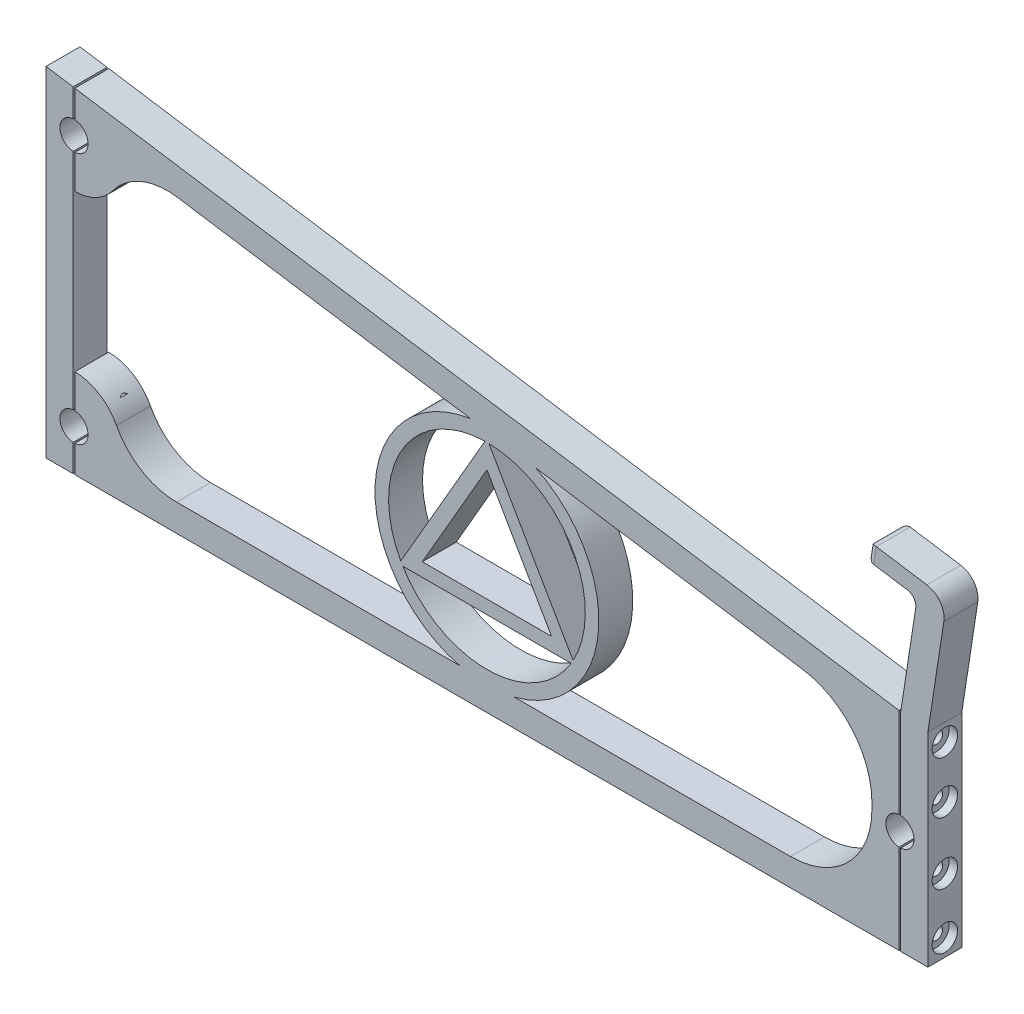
ISO-10303-21;
HEADER;
FILE_DESCRIPTION(('STEP AP214'),'2;1');
FILE_NAME('part.step','',(''),(''),'','','');
FILE_SCHEMA(('AUTOMOTIVE_DESIGN { 1 0 10303 214 1 1 1 1 }'));
ENDSEC;
DATA;
#1=APPLICATION_CONTEXT('core data for automotive mechanical design processes');
#2=APPLICATION_PROTOCOL_DEFINITION('international standard','automotive_design',2000,#1);
#3=PRODUCT_CONTEXT('',#1,'mechanical');
#4=PRODUCT('Part','Part','',(#3));
#5=PRODUCT_RELATED_PRODUCT_CATEGORY('part','',(#4));
#6=PRODUCT_DEFINITION_FORMATION('','',#4);
#7=PRODUCT_DEFINITION_CONTEXT('part definition',#1,'design');
#8=PRODUCT_DEFINITION('design','',#6,#7);
#9=PRODUCT_DEFINITION_SHAPE('','',#8);
#10=(LENGTH_UNIT() NAMED_UNIT(*) SI_UNIT(.MILLI.,.METRE.));
#11=(NAMED_UNIT(*) PLANE_ANGLE_UNIT() SI_UNIT($,.RADIAN.));
#12=(NAMED_UNIT(*) SI_UNIT($,.STERADIAN.) SOLID_ANGLE_UNIT());
#13=UNCERTAINTY_MEASURE_WITH_UNIT(LENGTH_MEASURE(1.E-05),#10,'distance_accuracy_value','');
#14=(GEOMETRIC_REPRESENTATION_CONTEXT(3) GLOBAL_UNCERTAINTY_ASSIGNED_CONTEXT((#13)) GLOBAL_UNIT_ASSIGNED_CONTEXT((#10,
#11,#12)) REPRESENTATION_CONTEXT('',''));
#15=CARTESIAN_POINT('',(0.,0.,0.));
#16=DIRECTION('',(0.,0.,1.));
#17=DIRECTION('',(1.,0.,0.));
#18=AXIS2_PLACEMENT_3D('',#15,#16,#17);
#19=CARTESIAN_POINT('',(8.25,12.15,5.));
#20=DIRECTION('',(0.,0.,-1.));
#21=DIRECTION('',(-1.,0.,0.));
#22=AXIS2_PLACEMENT_3D('',#19,#20,#21);
#23=CYLINDRICAL_SURFACE('',#22,14.15);
#24=CARTESIAN_POINT('',(8.25,12.15,5.));
#25=DIRECTION('',(0.,0.,1.));
#26=DIRECTION('',(1.,0.,0.));
#27=AXIS2_PLACEMENT_3D('',#24,#25,#26);
#28=CIRCLE('',#27,14.15);
#29=CARTESIAN_POINT('',(20.7836129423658,18.7174231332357,5.));
#30=VERTEX_POINT('',#29);
#31=CARTESIAN_POINT('',(8.49999999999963,26.2977913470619,5.));
#32=VERTEX_POINT('',#31);
#33=EDGE_CURVE('E620',#30,#32,#28,.T.);
#34=ORIENTED_EDGE('',*,*,#33,.F.);
#35=DIRECTION('',(0.,0.,-1.));
#36=VECTOR('',#35,1.);
#37=CARTESIAN_POINT('',(20.7836129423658,18.7174231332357,5.));
#38=LINE('',#37,#36);
#39=CARTESIAN_POINT('',(20.7836129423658,18.7174231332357,-5.));
#40=VERTEX_POINT('',#39);
#41=EDGE_CURVE('E516',#30,#40,#38,.T.);
#42=ORIENTED_EDGE('',*,*,#41,.T.);
#43=CARTESIAN_POINT('',(8.25,12.15,-5.));
#44=DIRECTION('',(0.,0.,1.));
#45=DIRECTION('',(1.,0.,0.));
#46=AXIS2_PLACEMENT_3D('',#43,#44,#45);
#47=CIRCLE('',#46,14.15);
#48=CARTESIAN_POINT('',(8.49999999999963,26.2977913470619,-5.));
#49=VERTEX_POINT('',#48);
#50=EDGE_CURVE('E588',#40,#49,#47,.T.);
#51=ORIENTED_EDGE('',*,*,#50,.T.);
#52=DIRECTION('',(0.,0.,-1.));
#53=VECTOR('',#52,1.);
#54=CARTESIAN_POINT('',(8.49999999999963,26.2977913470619,5.));
#55=LINE('',#54,#53);
#56=EDGE_CURVE('E513',#32,#49,#55,.T.);
#57=ORIENTED_EDGE('',*,*,#56,.F.);
#58=EDGE_LOOP('',(#34,#42,#51,#57));
#59=FACE_BOUND('',#58,.T.);
#60=CARTESIAN_POINT('',(18.,22.4047549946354,-1.00931964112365));
#61=CARTESIAN_POINT('',(17.951128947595,22.4512497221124,-0.958167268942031));
#62=CARTESIAN_POINT('',(17.9039624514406,22.4953983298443,-0.902549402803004));
#63=CARTESIAN_POINT('',(17.8152441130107,22.5774709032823,-0.781678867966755));
#64=CARTESIAN_POINT('',(17.773762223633,22.615318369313,-0.716323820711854));
#65=CARTESIAN_POINT('',(17.7084598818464,22.6743304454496,-0.592722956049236));
#66=CARTESIAN_POINT('',(17.6827760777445,22.6973276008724,-0.536365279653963));
#67=CARTESIAN_POINT('',(17.6385033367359,22.7367548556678,-0.418957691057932));
#68=CARTESIAN_POINT('',(17.619887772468,22.7532096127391,-0.357926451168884));
#69=CARTESIAN_POINT('',(17.591133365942,22.7785516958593,-0.231596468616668));
#70=CARTESIAN_POINT('',(17.5810874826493,22.787356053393,-0.166259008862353));
#71=CARTESIAN_POINT('',(17.5710037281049,22.7961937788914,-0.0341963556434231));
#72=CARTESIAN_POINT('',(17.5709642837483,22.7962285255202,0.0325286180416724));
#73=CARTESIAN_POINT('',(17.5801573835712,22.7881710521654,0.155039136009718));
#74=CARTESIAN_POINT('',(17.5880518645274,22.7812516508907,0.211013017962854));
#75=CARTESIAN_POINT('',(17.6104465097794,22.7615390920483,0.320521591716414));
#76=CARTESIAN_POINT('',(17.6249478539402,22.7487448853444,0.374055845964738));
#77=CARTESIAN_POINT('',(17.6649183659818,22.7132724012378,0.493850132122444));
#78=CARTESIAN_POINT('',(17.6923959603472,22.6887576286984,0.558889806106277));
#79=CARTESIAN_POINT('',(17.7545760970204,22.6327135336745,0.682260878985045));
#80=CARTESIAN_POINT('',(17.789300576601,22.6011628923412,0.740571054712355));
#81=CARTESIAN_POINT('',(17.8533329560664,22.5422961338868,0.834699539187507));
#82=CARTESIAN_POINT('',(17.8814043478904,22.5162973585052,0.872221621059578));
#83=CARTESIAN_POINT('',(17.9394079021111,22.4621023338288,0.943477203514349));
#84=CARTESIAN_POINT('',(17.9693241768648,22.4339244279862,0.97723750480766));
#85=CARTESIAN_POINT('',(18.,22.4047549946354,1.00931964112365));
#86=B_SPLINE_CURVE_WITH_KNOTS('',3,(#60,#61,#62,#63,#64,#65,#66,#67,#68,#69,#70,#71,#72,#73,#74,
#75,#76,#77,#78,#79,#80,#81,#82,#83,#84,#85),.UNSPECIFIED.,.F.,.F.,(4,2,2,2,2,2,2,2,2,2,2,2,4),
(0.,0.254485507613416,0.511865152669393,0.709313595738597,0.906010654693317,1.1048151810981,
1.30358845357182,1.47365863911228,1.64375920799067,1.86676260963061,2.09045112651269,
2.25101917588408,2.41035818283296),.UNSPECIFIED.);
#87=CARTESIAN_POINT('',(18.,22.4047549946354,-1.00931964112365));
#88=VERTEX_POINT('',#87);
#89=CARTESIAN_POINT('',(18.,22.4047549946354,1.00931964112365));
#90=VERTEX_POINT('',#89);
#91=EDGE_CURVE('E320',#88,#90,#86,.T.);
#92=ORIENTED_EDGE('',*,*,#91,.F.);
#93=DIRECTION('',(0.,0.,-1.));
#94=VECTOR('',#93,1.);
#95=CARTESIAN_POINT('',(18.,22.4047549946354,5.));
#96=LINE('',#95,#94);
#97=EDGE_CURVE('E12',#88,#90,#96,.F.);
#98=ORIENTED_EDGE('',*,*,#97,.T.);
#99=EDGE_LOOP('',(#92,#98));
#100=FACE_BOUND('',#99,.T.);
#101=ADVANCED_FACE('F48',(#59,#100),#23,.T.);
#102=CARTESIAN_POINT('',(8.25,86.4481868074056,5.));
#103=DIRECTION('',(0.,0.,-1.));
#104=DIRECTION('',(-1.,0.,0.));
#105=AXIS2_PLACEMENT_3D('',#102,#103,#104);
#106=CYLINDRICAL_SURFACE('',#105,14.15);
#107=CARTESIAN_POINT('',(8.25,86.4481868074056,-5.));
#108=DIRECTION('',(0.,0.,1.));
#109=DIRECTION('',(-1.,0.,0.));
#110=AXIS2_PLACEMENT_3D('',#107,#108,#109);
#111=CIRCLE('',#110,14.15);
#112=CARTESIAN_POINT('',(8.4999999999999,72.3003954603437,-5.));
#113=VERTEX_POINT('',#112);
#114=CARTESIAN_POINT('',(19.636400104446,78.0474491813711,-5.));
#115=VERTEX_POINT('',#114);
#116=EDGE_CURVE('E479',#113,#115,#111,.T.);
#117=ORIENTED_EDGE('',*,*,#116,.T.);
#118=DIRECTION('',(0.,0.,-1.));
#119=VECTOR('',#118,1.);
#120=CARTESIAN_POINT('',(19.636400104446,78.0474491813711,5.));
#121=LINE('',#120,#119);
#122=CARTESIAN_POINT('',(19.636400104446,78.0474491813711,5.));
#123=VERTEX_POINT('',#122);
#124=EDGE_CURVE('E525',#115,#123,#121,.F.);
#125=ORIENTED_EDGE('',*,*,#124,.T.);
#126=CARTESIAN_POINT('',(8.25,86.4481868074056,5.));
#127=DIRECTION('',(0.,0.,1.));
#128=DIRECTION('',(-1.,0.,0.));
#129=AXIS2_PLACEMENT_3D('',#126,#127,#128);
#130=CIRCLE('',#129,14.15);
#131=CARTESIAN_POINT('',(8.4999999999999,72.3003954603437,5.));
#132=VERTEX_POINT('',#131);
#133=EDGE_CURVE('E666',#132,#123,#130,.T.);
#134=ORIENTED_EDGE('',*,*,#133,.F.);
#135=DIRECTION('',(0.,0.,-1.));
#136=VECTOR('',#135,1.);
#137=CARTESIAN_POINT('',(8.4999999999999,72.3003954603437,5.));
#138=LINE('',#137,#136);
#139=EDGE_CURVE('E486',#132,#113,#138,.T.);
#140=ORIENTED_EDGE('',*,*,#139,.T.);
#141=EDGE_LOOP('',(#117,#125,#134,#140));
#142=FACE_BOUND('',#141,.T.);
#143=CARTESIAN_POINT('',(18.,76.1934318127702,1.00931964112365));
#144=CARTESIAN_POINT('',(17.951128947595,76.1469370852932,0.958167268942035));
#145=CARTESIAN_POINT('',(17.9039624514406,76.1027884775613,0.902549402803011));
#146=CARTESIAN_POINT('',(17.8152441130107,76.0207159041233,0.781678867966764));
#147=CARTESIAN_POINT('',(17.773762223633,75.9828684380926,0.716323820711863));
#148=CARTESIAN_POINT('',(17.7084598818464,75.923856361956,0.592722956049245));
#149=CARTESIAN_POINT('',(17.6827760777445,75.9008592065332,0.536365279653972));
#150=CARTESIAN_POINT('',(17.6385033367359,75.8614319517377,0.418957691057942));
#151=CARTESIAN_POINT('',(17.619887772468,75.8449771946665,0.357926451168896));
#152=CARTESIAN_POINT('',(17.591133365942,75.8196351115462,0.231596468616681));
#153=CARTESIAN_POINT('',(17.5810874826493,75.8108307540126,0.166259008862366));
#154=CARTESIAN_POINT('',(17.5710037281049,75.8019930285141,0.0341963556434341));
#155=CARTESIAN_POINT('',(17.5709642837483,75.8019582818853,-0.0325286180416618));
#156=CARTESIAN_POINT('',(17.5801573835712,75.8100157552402,-0.155039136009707));
#157=CARTESIAN_POINT('',(17.5880518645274,75.8169351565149,-0.211013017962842));
#158=CARTESIAN_POINT('',(17.6104465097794,75.8366477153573,-0.320521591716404));
#159=CARTESIAN_POINT('',(17.6249478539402,75.8494419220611,-0.37405584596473));
#160=CARTESIAN_POINT('',(17.6649183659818,75.8849144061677,-0.493850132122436));
#161=CARTESIAN_POINT('',(17.6923959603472,75.9094291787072,-0.558889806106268));
#162=CARTESIAN_POINT('',(17.7545760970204,75.9654732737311,-0.682260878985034));
#163=CARTESIAN_POINT('',(17.789300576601,75.9970239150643,-0.740571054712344));
#164=CARTESIAN_POINT('',(17.8533329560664,76.0558906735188,-0.834699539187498));
#165=CARTESIAN_POINT('',(17.8814043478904,76.0818894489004,-0.872221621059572));
#166=CARTESIAN_POINT('',(17.9394079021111,76.1360844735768,-0.943477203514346));
#167=CARTESIAN_POINT('',(17.9693241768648,76.1642623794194,-0.977237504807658));
#168=CARTESIAN_POINT('',(18.,76.1934318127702,-1.00931964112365));
#169=B_SPLINE_CURVE_WITH_KNOTS('',3,(#143,#144,#145,#146,#147,#148,#149,#150,#151,#152,#153,
#154,#155,#156,#157,#158,#159,#160,#161,#162,#163,#164,#165,#166,#167,#168),.UNSPECIFIED.,.F.,
.F.,(4,2,2,2,2,2,2,2,2,2,2,2,4),(0.,0.254485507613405,0.511865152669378,0.709313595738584,
0.906010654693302,1.10481518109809,1.30358845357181,1.47365863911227,1.64375920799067,
1.86676260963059,2.09045112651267,2.25101917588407,2.41035818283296),.UNSPECIFIED.);
#170=CARTESIAN_POINT('',(18.,76.1934318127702,1.00931964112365));
#171=VERTEX_POINT('',#170);
#172=CARTESIAN_POINT('',(18.,76.1934318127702,-1.00931964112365));
#173=VERTEX_POINT('',#172);
#174=EDGE_CURVE('E58',#171,#173,#169,.T.);
#175=ORIENTED_EDGE('',*,*,#174,.F.);
#176=DIRECTION('',(0.,0.,-1.));
#177=VECTOR('',#176,1.);
#178=CARTESIAN_POINT('',(18.,76.1934318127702,5.));
#179=LINE('',#178,#177);
#180=EDGE_CURVE('E276',#171,#173,#179,.T.);
#181=ORIENTED_EDGE('',*,*,#180,.T.);
#182=EDGE_LOOP('',(#175,#181));
#183=FACE_BOUND('',#182,.T.);
#184=ADVANCED_FACE('F287',(#142,#183),#106,.T.);
#185=CARTESIAN_POINT('',(243.5,8.00000000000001,5.));
#186=DIRECTION('',(0.,-1.,0.));
#187=DIRECTION('',(1.,0.,0.));
#188=AXIS2_PLACEMENT_3D('',#185,#186,#187);
#189=PLANE('',#188);
#190=DIRECTION('',(0.,0.,-1.));
#191=VECTOR('',#190,1.);
#192=CARTESIAN_POINT('',(121.937742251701,7.99999999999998,5.));
#193=LINE('',#192,#191);
#194=CARTESIAN_POINT('',(121.937742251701,7.99999999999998,-5.));
#195=VERTEX_POINT('',#194);
#196=CARTESIAN_POINT('',(121.937742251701,7.99999999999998,5.));
#197=VERTEX_POINT('',#196);
#198=EDGE_CURVE('E578',#195,#197,#193,.F.);
#199=ORIENTED_EDGE('',*,*,#198,.F.);
#200=DIRECTION('',(-1.,0.,0.));
#201=VECTOR('',#200,1.);
#202=CARTESIAN_POINT('',(243.5,8.00000000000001,-5.));
#203=LINE('',#202,#201);
#204=CARTESIAN_POINT('',(38.4989669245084,7.99999999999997,-5.));
#205=VERTEX_POINT('',#204);
#206=EDGE_CURVE('E577',#195,#205,#203,.T.);
#207=ORIENTED_EDGE('',*,*,#206,.T.);
#208=DIRECTION('',(0.,0.,1.));
#209=VECTOR('',#208,1.);
#210=CARTESIAN_POINT('',(38.4989669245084,7.99999999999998,5.));
#211=LINE('',#210,#209);
#212=CARTESIAN_POINT('',(38.4989669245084,7.99999999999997,5.));
#213=VERTEX_POINT('',#212);
#214=EDGE_CURVE('E519',#205,#213,#211,.T.);
#215=ORIENTED_EDGE('',*,*,#214,.T.);
#216=DIRECTION('',(-1.,0.,0.));
#217=VECTOR('',#216,1.);
#218=CARTESIAN_POINT('',(243.5,8.00000000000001,5.));
#219=LINE('',#218,#217);
#220=EDGE_CURVE('E569',#197,#213,#219,.T.);
#221=ORIENTED_EDGE('',*,*,#220,.F.);
#222=EDGE_LOOP('',(#199,#207,#215,#221));
#223=FACE_BOUND('',#222,.T.);
#224=ADVANCED_FACE('F341',(#223),#189,.F.);
#225=DIRECTION('',(0.,0.,-1.));
#226=VECTOR('',#225,1.);
#227=CARTESIAN_POINT('',(138.062257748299,7.99999999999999,5.));
#228=LINE('',#227,#226);
#229=CARTESIAN_POINT('',(138.062257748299,7.99999999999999,5.));
#230=VERTEX_POINT('',#229);
#231=CARTESIAN_POINT('',(138.062257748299,7.99999999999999,-5.));
#232=VERTEX_POINT('',#231);
#233=EDGE_CURVE('E583',#230,#232,#228,.T.);
#234=ORIENTED_EDGE('',*,*,#233,.F.);
#235=CARTESIAN_POINT('',(219.5,8.,5.));
#236=VERTEX_POINT('',#235);
#237=EDGE_CURVE('E646',#236,#230,#219,.T.);
#238=ORIENTED_EDGE('',*,*,#237,.F.);
#239=DIRECTION('',(0.,0.,-1.));
#240=VECTOR('',#239,1.);
#241=CARTESIAN_POINT('',(219.5,8.,-5.));
#242=LINE('',#241,#240);
#243=CARTESIAN_POINT('',(219.5,8.,-5.));
#244=VERTEX_POINT('',#243);
#245=EDGE_CURVE('E536',#236,#244,#242,.T.);
#246=ORIENTED_EDGE('',*,*,#245,.T.);
#247=EDGE_CURVE('E580',#244,#232,#203,.T.);
#248=ORIENTED_EDGE('',*,*,#247,.T.);
#249=EDGE_LOOP('',(#234,#238,#246,#248));
#250=FACE_BOUND('',#249,.T.);
#251=ADVANCED_FACE('F344',(#250),#189,.F.);
#252=CARTESIAN_POINT('',(22.2530258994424,88.4823366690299,5.));
#253=DIRECTION('',(0.152057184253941,0.988371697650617,0.));
#254=DIRECTION('',(-0.988371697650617,0.152057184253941,0.));
#255=AXIS2_PLACEMENT_3D('',#252,#253,#254);
#256=PLANE('',#255);
#257=DIRECTION('',(0.,0.,-1.));
#258=VECTOR('',#257,1.);
#259=CARTESIAN_POINT('',(144.405822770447,69.6895986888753,5.));
#260=LINE('',#259,#258);
#261=CARTESIAN_POINT('',(144.405822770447,69.6895986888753,-5.));
#262=VERTEX_POINT('',#261);
#263=CARTESIAN_POINT('',(144.405822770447,69.6895986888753,5.));
#264=VERTEX_POINT('',#263);
#265=EDGE_CURVE('E641',#262,#264,#260,.F.);
#266=ORIENTED_EDGE('',*,*,#265,.F.);
#267=DIRECTION('',(0.988371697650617,-0.152057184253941,0.));
#268=VECTOR('',#267,1.);
#269=CARTESIAN_POINT('',(22.2530258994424,88.4823366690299,-5.));
#270=LINE('',#269,#268);
#271=CARTESIAN_POINT('',(223.149372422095,57.5752064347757,-5.));
#272=VERTEX_POINT('',#271);
#273=EDGE_CURVE('E482',#262,#272,#270,.T.);
#274=ORIENTED_EDGE('',*,*,#273,.T.);
#275=DIRECTION('',(0.,0.,-1.));
#276=VECTOR('',#275,1.);
#277=CARTESIAN_POINT('',(223.149372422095,57.5752064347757,5.));
#278=LINE('',#277,#276);
#279=CARTESIAN_POINT('',(223.149372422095,57.5752064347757,5.));
#280=VERTEX_POINT('',#279);
#281=EDGE_CURVE('E544',#272,#280,#278,.F.);
#282=ORIENTED_EDGE('',*,*,#281,.T.);
#283=DIRECTION('',(0.988371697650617,-0.152057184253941,0.));
#284=VECTOR('',#283,1.);
#285=CARTESIAN_POINT('',(22.2530258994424,88.4823366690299,5.));
#286=LINE('',#285,#284);
#287=EDGE_CURVE('E562',#264,#280,#286,.T.);
#288=ORIENTED_EDGE('',*,*,#287,.F.);
#289=EDGE_LOOP('',(#266,#274,#282,#288));
#290=FACE_BOUND('',#289,.T.);
#291=ADVANCED_FACE('F742',(#290),#256,.F.);
#292=DIRECTION('',(0.,0.,-1.));
#293=VECTOR('',#292,1.);
#294=CARTESIAN_POINT('',(125.184383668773,72.646743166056,5.));
#295=LINE('',#294,#293);
#296=CARTESIAN_POINT('',(125.184383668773,72.646743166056,5.));
#297=VERTEX_POINT('',#296);
#298=CARTESIAN_POINT('',(125.184383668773,72.646743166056,-5.));
#299=VERTEX_POINT('',#298);
#300=EDGE_CURVE('E631',#297,#299,#295,.T.);
#301=ORIENTED_EDGE('',*,*,#300,.F.);
#302=CARTESIAN_POINT('',(38.7713955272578,85.9410490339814,5.));
#303=VERTEX_POINT('',#302);
#304=EDGE_CURVE('E490',#303,#297,#286,.T.);
#305=ORIENTED_EDGE('',*,*,#304,.F.);
#306=DIRECTION('',(0.,0.,1.));
#307=VECTOR('',#306,1.);
#308=CARTESIAN_POINT('',(38.7713955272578,85.9410490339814,-5.));
#309=LINE('',#308,#307);
#310=CARTESIAN_POINT('',(38.7713955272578,85.9410490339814,-5.));
#311=VERTEX_POINT('',#310);
#312=EDGE_CURVE('E522',#303,#311,#309,.F.);
#313=ORIENTED_EDGE('',*,*,#312,.T.);
#314=EDGE_CURVE('E483',#311,#299,#270,.T.);
#315=ORIENTED_EDGE('',*,*,#314,.T.);
#316=EDGE_LOOP('',(#301,#305,#313,#315));
#317=FACE_BOUND('',#316,.T.);
#318=ADVANCED_FACE('F349',(#317),#256,.F.);
#319=CARTESIAN_POINT('',(243.5,54.4443406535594,5.));
#320=DIRECTION('',(1.,0.,0.));
#321=DIRECTION('',(0.,0.,-1.));
#322=AXIS2_PLACEMENT_3D('',#319,#320,#321);
#323=PLANE('',#322);
#324=DIRECTION('',(0.,-1.,0.));
#325=VECTOR('',#324,1.);
#326=CARTESIAN_POINT('',(243.5,54.4443406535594,-5.));
#327=LINE('',#326,#325);
#328=CARTESIAN_POINT('',(243.5,33.8542856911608,-5.));
#329=VERTEX_POINT('',#328);
#330=CARTESIAN_POINT('',(243.5,32.,-5.));
#331=VERTEX_POINT('',#330);
#332=EDGE_CURVE('E575',#329,#331,#327,.T.);
#333=ORIENTED_EDGE('',*,*,#332,.T.);
#334=DIRECTION('',(0.,0.,-1.));
#335=VECTOR('',#334,1.);
#336=CARTESIAN_POINT('',(243.5,32.,5.));
#337=LINE('',#336,#335);
#338=CARTESIAN_POINT('',(243.5,32.,5.));
#339=VERTEX_POINT('',#338);
#340=EDGE_CURVE('E542',#331,#339,#337,.F.);
#341=ORIENTED_EDGE('',*,*,#340,.T.);
#342=DIRECTION('',(0.,-1.,0.));
#343=VECTOR('',#342,1.);
#344=CARTESIAN_POINT('',(243.5,54.4443406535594,5.));
#345=LINE('',#344,#343);
#346=CARTESIAN_POINT('',(243.5,33.8542856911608,5.));
#347=VERTEX_POINT('',#346);
#348=EDGE_CURVE('E485',#347,#339,#345,.T.);
#349=ORIENTED_EDGE('',*,*,#348,.F.);
#350=DIRECTION('',(0.,0.,-1.));
#351=VECTOR('',#350,1.);
#352=CARTESIAN_POINT('',(243.5,33.8542856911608,-5.));
#353=LINE('',#352,#351);
#354=EDGE_CURVE('E539',#347,#329,#353,.T.);
#355=ORIENTED_EDGE('',*,*,#354,.T.);
#356=EDGE_LOOP('',(#333,#341,#349,#355));
#357=FACE_BOUND('',#356,.T.);
#358=ADVANCED_FACE('F346',(#357),#323,.F.);
#359=CARTESIAN_POINT('',(8.49999999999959,16.2924630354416,5.));
#360=DIRECTION('',(1.,0.,0.));
#361=DIRECTION('',(0.,1.,0.));
#362=AXIS2_PLACEMENT_3D('',#359,#360,#361);
#363=PLANE('',#362);
#364=CARTESIAN_POINT('',(8.49999999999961,21.2951271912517,0.));
#365=DIRECTION('',(1.,0.,0.));
#366=DIRECTION('',(0.,1.,0.));
#367=AXIS2_PLACEMENT_3D('',#364,#365,#366);
#368=CIRCLE('',#367,1.5);
#369=CARTESIAN_POINT('',(8.49999999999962,22.7951271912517,0.));
#370=VERTEX_POINT('',#369);
#371=EDGE_CURVE('E329',#370,#370,#368,.F.);
#372=ORIENTED_EDGE('',*,*,#371,.F.);
#373=EDGE_LOOP('',(#372));
#374=FACE_BOUND('',#373,.T.);
#375=DIRECTION('',(0.,-1.,0.));
#376=VECTOR('',#375,1.);
#377=CARTESIAN_POINT('',(8.49999999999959,16.2924630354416,-5.));
#378=LINE('',#377,#376);
#379=CARTESIAN_POINT('',(8.49999999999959,16.2924630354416,-5.));
#380=VERTEX_POINT('',#379);
#381=EDGE_CURVE('E590',#49,#380,#378,.T.);
#382=ORIENTED_EDGE('',*,*,#381,.T.);
#383=DIRECTION('',(0.,0.,-1.));
#384=VECTOR('',#383,1.);
#385=CARTESIAN_POINT('',(8.49999999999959,16.2924630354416,5.));
#386=LINE('',#385,#384);
#387=CARTESIAN_POINT('',(8.49999999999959,16.2924630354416,5.));
#388=VERTEX_POINT('',#387);
#389=EDGE_CURVE('E510',#388,#380,#386,.T.);
#390=ORIENTED_EDGE('',*,*,#389,.F.);
#391=DIRECTION('',(0.,-1.,0.));
#392=VECTOR('',#391,1.);
#393=CARTESIAN_POINT('',(8.49999999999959,16.2924630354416,5.));
#394=LINE('',#393,#392);
#395=EDGE_CURVE('E613',#32,#388,#394,.T.);
#396=ORIENTED_EDGE('',*,*,#395,.F.);
#397=ORIENTED_EDGE('',*,*,#56,.T.);
#398=EDGE_LOOP('',(#382,#390,#396,#397));
#399=FACE_BOUND('',#398,.T.);
#400=ADVANCED_FACE('F339',(#374,#399),#363,.F.);
#401=CARTESIAN_POINT('',(8.25,12.15,5.));
#402=DIRECTION('',(0.,0.,-1.));
#403=DIRECTION('',(-1.,0.,0.));
#404=AXIS2_PLACEMENT_3D('',#401,#402,#403);
#405=CYLINDRICAL_SURFACE('',#404,4.15);
#406=CARTESIAN_POINT('',(8.25,12.15,-5.));
#407=DIRECTION('',(0.,0.,-1.));
#408=DIRECTION('',(1.,0.,0.));
#409=AXIS2_PLACEMENT_3D('',#406,#407,#408);
#410=CIRCLE('',#409,4.15);
#411=CARTESIAN_POINT('',(8.49999999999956,8.00753696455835,-5.));
#412=VERTEX_POINT('',#411);
#413=EDGE_CURVE('E592',#380,#412,#410,.T.);
#414=ORIENTED_EDGE('',*,*,#413,.T.);
#415=DIRECTION('',(0.,0.,-1.));
#416=VECTOR('',#415,1.);
#417=CARTESIAN_POINT('',(8.49999999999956,8.00753696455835,5.));
#418=LINE('',#417,#416);
#419=CARTESIAN_POINT('',(8.49999999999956,8.00753696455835,5.));
#420=VERTEX_POINT('',#419);
#421=EDGE_CURVE('E507',#420,#412,#418,.T.);
#422=ORIENTED_EDGE('',*,*,#421,.F.);
#423=CARTESIAN_POINT('',(8.25,12.15,5.));
#424=DIRECTION('',(0.,0.,-1.));
#425=DIRECTION('',(1.,0.,0.));
#426=AXIS2_PLACEMENT_3D('',#423,#424,#425);
#427=CIRCLE('',#426,4.15);
#428=EDGE_CURVE('E609',#388,#420,#427,.T.);
#429=ORIENTED_EDGE('',*,*,#428,.F.);
#430=ORIENTED_EDGE('',*,*,#389,.T.);
#431=EDGE_LOOP('',(#414,#422,#429,#430));
#432=FACE_BOUND('',#431,.T.);
#433=ADVANCED_FACE('F608',(#432),#405,.F.);
#434=CARTESIAN_POINT('',(8.49999999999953,0.,5.));
#435=DIRECTION('',(1.,0.,0.));
#436=DIRECTION('',(0.,1.,0.));
#437=AXIS2_PLACEMENT_3D('',#434,#435,#436);
#438=PLANE('',#437);
#439=CARTESIAN_POINT('',(8.49999999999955,4.00376848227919,0.));
#440=DIRECTION('',(1.,0.,0.));
#441=DIRECTION('',(0.,1.,0.));
#442=AXIS2_PLACEMENT_3D('',#439,#440,#441);
#443=CIRCLE('',#442,1.5);
#444=CARTESIAN_POINT('',(8.49999999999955,5.50376848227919,0.));
#445=VERTEX_POINT('',#444);
#446=EDGE_CURVE('E412',#445,#445,#443,.F.);
#447=ORIENTED_EDGE('',*,*,#446,.F.);
#448=EDGE_LOOP('',(#447));
#449=FACE_BOUND('',#448,.T.);
#450=DIRECTION('',(0.,-1.,0.));
#451=VECTOR('',#450,1.);
#452=CARTESIAN_POINT('',(8.49999999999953,0.,-5.));
#453=LINE('',#452,#451);
#454=CARTESIAN_POINT('',(8.49999999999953,0.,-5.));
#455=VERTEX_POINT('',#454);
#456=EDGE_CURVE('E594',#412,#455,#453,.T.);
#457=ORIENTED_EDGE('',*,*,#456,.T.);
#458=DIRECTION('',(0.,0.,-1.));
#459=VECTOR('',#458,1.);
#460=CARTESIAN_POINT('',(8.49999999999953,0.,5.));
#461=LINE('',#460,#459);
#462=CARTESIAN_POINT('',(8.49999999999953,0.,5.));
#463=VERTEX_POINT('',#462);
#464=EDGE_CURVE('E504',#463,#455,#461,.T.);
#465=ORIENTED_EDGE('',*,*,#464,.F.);
#466=DIRECTION('',(0.,-1.,0.));
#467=VECTOR('',#466,1.);
#468=CARTESIAN_POINT('',(8.49999999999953,0.,5.));
#469=LINE('',#468,#467);
#470=EDGE_CURVE('E605',#420,#463,#469,.T.);
#471=ORIENTED_EDGE('',*,*,#470,.F.);
#472=ORIENTED_EDGE('',*,*,#421,.T.);
#473=EDGE_LOOP('',(#457,#465,#471,#472));
#474=FACE_BOUND('',#473,.T.);
#475=ADVANCED_FACE('F602',(#449,#474),#438,.F.);
#476=CARTESIAN_POINT('',(251.5,0.,5.));
#477=DIRECTION('',(0.,1.,0.));
#478=DIRECTION('',(-1.,0.,0.));
#479=AXIS2_PLACEMENT_3D('',#476,#477,#478);
#480=PLANE('',#479);
#481=DIRECTION('',(1.,0.,0.));
#482=VECTOR('',#481,1.);
#483=CARTESIAN_POINT('',(251.5,0.,-5.));
#484=LINE('',#483,#482);
#485=CARTESIAN_POINT('',(251.5,0.,-5.));
#486=VERTEX_POINT('',#485);
#487=EDGE_CURVE('E454',#455,#486,#484,.T.);
#488=ORIENTED_EDGE('',*,*,#487,.T.);
#489=DIRECTION('',(0.,0.,-1.));
#490=VECTOR('',#489,1.);
#491=CARTESIAN_POINT('',(251.5,0.,5.));
#492=LINE('',#491,#490);
#493=CARTESIAN_POINT('',(251.5,0.,5.));
#494=VERTEX_POINT('',#493);
#495=EDGE_CURVE('E449',#494,#486,#492,.T.);
#496=ORIENTED_EDGE('',*,*,#495,.F.);
#497=DIRECTION('',(1.,0.,0.));
#498=VECTOR('',#497,1.);
#499=CARTESIAN_POINT('',(251.5,0.,5.));
#500=LINE('',#499,#498);
#501=EDGE_CURVE('E652',#463,#494,#500,.T.);
#502=ORIENTED_EDGE('',*,*,#501,.F.);
#503=ORIENTED_EDGE('',*,*,#464,.T.);
#504=EDGE_LOOP('',(#488,#496,#502,#503));
#505=FACE_BOUND('',#504,.T.);
#506=ADVANCED_FACE('F437',(#505),#480,.F.);
#507=CARTESIAN_POINT('',(251.5,0.,5.));
#508=DIRECTION('',(-1.,0.,0.));
#509=DIRECTION('',(0.,0.,1.));
#510=AXIS2_PLACEMENT_3D('',#507,#508,#509);
#511=PLANE('',#510);
#512=CARTESIAN_POINT('',(251.5,21.425861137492,0.));
#513=DIRECTION('',(-1.,0.,0.));
#514=DIRECTION('',(0.,0.,1.));
#515=AXIS2_PLACEMENT_3D('',#512,#513,#514);
#516=CIRCLE('',#515,1.5);
#517=CARTESIAN_POINT('',(251.5,21.425861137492,1.5));
#518=VERTEX_POINT('',#517);
#519=EDGE_CURVE('E371',#518,#518,#516,.T.);
#520=ORIENTED_EDGE('',*,*,#519,.T.);
#521=EDGE_LOOP('',(#520));
#522=FACE_BOUND('',#521,.T.);
#523=CARTESIAN_POINT('',(251.5,5.,0.));
#524=DIRECTION('',(-1.,0.,0.));
#525=DIRECTION('',(0.,0.,1.));
#526=AXIS2_PLACEMENT_3D('',#523,#524,#525);
#527=CIRCLE('',#526,1.5);
#528=CARTESIAN_POINT('',(251.5,5.,-1.50000000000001));
#529=VERTEX_POINT('',#528);
#530=EDGE_CURVE('E53',#529,#529,#527,.T.);
#531=ORIENTED_EDGE('',*,*,#530,.T.);
#532=EDGE_LOOP('',(#531));
#533=FACE_BOUND('',#532,.T.);
#534=DIRECTION('',(0.,1.,0.));
#535=VECTOR('',#534,1.);
#536=CARTESIAN_POINT('',(251.5,0.,-5.));
#537=LINE('',#536,#535);
#538=CARTESIAN_POINT('',(251.5,26.425861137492,-5.));
#539=VERTEX_POINT('',#538);
#540=EDGE_CURVE('E443',#486,#539,#537,.T.);
#541=ORIENTED_EDGE('',*,*,#540,.T.);
#542=DIRECTION('',(0.,0.,-1.));
#543=VECTOR('',#542,1.);
#544=CARTESIAN_POINT('',(251.5,26.425861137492,5.));
#545=LINE('',#544,#543);
#546=CARTESIAN_POINT('',(251.5,26.425861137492,5.));
#547=VERTEX_POINT('',#546);
#548=EDGE_CURVE('E446',#547,#539,#545,.T.);
#549=ORIENTED_EDGE('',*,*,#548,.F.);
#550=DIRECTION('',(0.,1.,0.));
#551=VECTOR('',#550,1.);
#552=CARTESIAN_POINT('',(251.5,0.,5.));
#553=LINE('',#552,#551);
#554=EDGE_CURVE('E654',#494,#547,#553,.T.);
#555=ORIENTED_EDGE('',*,*,#554,.F.);
#556=ORIENTED_EDGE('',*,*,#495,.T.);
#557=EDGE_LOOP('',(#541,#549,#555,#556));
#558=FACE_BOUND('',#557,.T.);
#559=ADVANCED_FACE('F433',(#522,#533,#558),#511,.F.);
#560=CARTESIAN_POINT('',(251.75,30.5683241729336,5.));
#561=DIRECTION('',(0.,0.,-1.));
#562=DIRECTION('',(-1.,0.,0.));
#563=AXIS2_PLACEMENT_3D('',#560,#561,#562);
#564=CYLINDRICAL_SURFACE('',#563,4.15000000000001);
#565=CARTESIAN_POINT('',(251.75,30.5683241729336,-5.));
#566=DIRECTION('',(0.,0.,-1.));
#567=DIRECTION('',(1.,0.,0.));
#568=AXIS2_PLACEMENT_3D('',#565,#566,#567);
#569=CIRCLE('',#568,4.15000000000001);
#570=CARTESIAN_POINT('',(251.5,34.7107872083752,-5.));
#571=VERTEX_POINT('',#570);
#572=EDGE_CURVE('E453',#539,#571,#569,.T.);
#573=ORIENTED_EDGE('',*,*,#572,.T.);
#574=DIRECTION('',(0.,0.,-1.));
#575=VECTOR('',#574,1.);
#576=CARTESIAN_POINT('',(251.5,34.7107872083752,5.));
#577=LINE('',#576,#575);
#578=CARTESIAN_POINT('',(251.5,34.7107872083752,5.));
#579=VERTEX_POINT('',#578);
#580=EDGE_CURVE('E460',#579,#571,#577,.T.);
#581=ORIENTED_EDGE('',*,*,#580,.F.);
#582=CARTESIAN_POINT('',(251.75,30.5683241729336,5.));
#583=DIRECTION('',(0.,0.,-1.));
#584=DIRECTION('',(1.,0.,0.));
#585=AXIS2_PLACEMENT_3D('',#582,#583,#584);
#586=CIRCLE('',#585,4.15000000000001);
#587=EDGE_CURVE('E459',#547,#579,#586,.T.);
#588=ORIENTED_EDGE('',*,*,#587,.F.);
#589=ORIENTED_EDGE('',*,*,#548,.T.);
#590=EDGE_LOOP('',(#573,#581,#588,#589));
#591=FACE_BOUND('',#590,.T.);
#592=ADVANCED_FACE('F436',(#591),#564,.F.);
#593=CARTESIAN_POINT('',(251.5,34.7107872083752,5.));
#594=DIRECTION('',(-1.,0.,0.));
#595=DIRECTION('',(0.,0.,1.));
#596=AXIS2_PLACEMENT_3D('',#593,#594,#595);
#597=PLANE('',#596);
#598=CARTESIAN_POINT('',(251.5,55.,0.));
#599=DIRECTION('',(-1.,0.,0.));
#600=DIRECTION('',(0.,0.,1.));
#601=AXIS2_PLACEMENT_3D('',#598,#599,#600);
#602=CIRCLE('',#601,1.5);
#603=CARTESIAN_POINT('',(251.5,55.,-1.5));
#604=VERTEX_POINT('',#603);
#605=EDGE_CURVE('E378',#604,#604,#602,.T.);
#606=ORIENTED_EDGE('',*,*,#605,.T.);
#607=EDGE_LOOP('',(#606));
#608=FACE_BOUND('',#607,.T.);
#609=CARTESIAN_POINT('',(251.5,39.7107872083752,0.));
#610=DIRECTION('',(-1.,0.,0.));
#611=DIRECTION('',(0.,0.,1.));
#612=AXIS2_PLACEMENT_3D('',#609,#610,#611);
#613=CIRCLE('',#612,1.5);
#614=CARTESIAN_POINT('',(251.5,39.7107872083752,1.5));
#615=VERTEX_POINT('',#614);
#616=EDGE_CURVE('E372',#615,#615,#613,.T.);
#617=ORIENTED_EDGE('',*,*,#616,.T.);
#618=EDGE_LOOP('',(#617));
#619=FACE_BOUND('',#618,.T.);
#620=DIRECTION('',(0.,1.,0.));
#621=VECTOR('',#620,1.);
#622=CARTESIAN_POINT('',(251.5,34.7107872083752,-5.));
#623=LINE('',#622,#621);
#624=CARTESIAN_POINT('',(251.5,61.3076923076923,-5.));
#625=VERTEX_POINT('',#624);
#626=EDGE_CURVE('E466',#571,#625,#623,.T.);
#627=ORIENTED_EDGE('',*,*,#626,.T.);
#628=DIRECTION('',(0.,0.,-1.));
#629=VECTOR('',#628,1.);
#630=CARTESIAN_POINT('',(251.5,61.3076923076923,5.));
#631=LINE('',#630,#629);
#632=CARTESIAN_POINT('',(251.5,61.3076923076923,5.));
#633=VERTEX_POINT('',#632);
#634=EDGE_CURVE('E499',#633,#625,#631,.T.);
#635=ORIENTED_EDGE('',*,*,#634,.F.);
#636=DIRECTION('',(0.,1.,0.));
#637=VECTOR('',#636,1.);
#638=CARTESIAN_POINT('',(251.5,34.7107872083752,5.));
#639=LINE('',#638,#637);
#640=EDGE_CURVE('E657',#579,#633,#639,.T.);
#641=ORIENTED_EDGE('',*,*,#640,.F.);
#642=ORIENTED_EDGE('',*,*,#580,.T.);
#643=EDGE_LOOP('',(#627,#635,#641,#642));
#644=FACE_BOUND('',#643,.T.);
#645=ADVANCED_FACE('F700',(#608,#619,#644),#597,.F.);
#646=CARTESIAN_POINT('',(8.5,98.6923076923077,5.));
#647=DIRECTION('',(-0.152057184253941,-0.988371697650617,0.));
#648=DIRECTION('',(0.988371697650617,-0.152057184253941,0.));
#649=AXIS2_PLACEMENT_3D('',#646,#647,#648);
#650=PLANE('',#649);
#651=DIRECTION('',(-0.988371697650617,0.152057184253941,0.));
#652=VECTOR('',#651,1.);
#653=CARTESIAN_POINT('',(8.5,98.6923076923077,-5.));
#654=LINE('',#653,#652);
#655=CARTESIAN_POINT('',(8.5,98.6923076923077,-5.));
#656=VERTEX_POINT('',#655);
#657=EDGE_CURVE('E468',#625,#656,#654,.T.);
#658=ORIENTED_EDGE('',*,*,#657,.T.);
#659=DIRECTION('',(0.,0.,-1.));
#660=VECTOR('',#659,1.);
#661=CARTESIAN_POINT('',(8.5,98.6923076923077,5.));
#662=LINE('',#661,#660);
#663=CARTESIAN_POINT('',(8.5,98.6923076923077,5.));
#664=VERTEX_POINT('',#663);
#665=EDGE_CURVE('E496',#664,#656,#662,.T.);
#666=ORIENTED_EDGE('',*,*,#665,.F.);
#667=DIRECTION('',(-0.988371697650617,0.152057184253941,0.));
#668=VECTOR('',#667,1.);
#669=CARTESIAN_POINT('',(8.5,98.6923076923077,5.));
#670=LINE('',#669,#668);
#671=EDGE_CURVE('E659',#633,#664,#670,.T.);
#672=ORIENTED_EDGE('',*,*,#671,.F.);
#673=ORIENTED_EDGE('',*,*,#634,.T.);
#674=EDGE_LOOP('',(#658,#666,#672,#673));
#675=FACE_BOUND('',#674,.T.);
#676=ADVANCED_FACE('F696',(#675),#650,.F.);
#677=CARTESIAN_POINT('',(8.5,90.5906498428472,5.));
#678=DIRECTION('',(1.,0.,0.));
#679=DIRECTION('',(0.,1.,0.));
#680=AXIS2_PLACEMENT_3D('',#677,#678,#679);
#681=PLANE('',#680);
#682=CARTESIAN_POINT('',(8.5,94.0906498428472,0.));
#683=DIRECTION('',(1.,0.,0.));
#684=DIRECTION('',(0.,1.,0.));
#685=AXIS2_PLACEMENT_3D('',#682,#683,#684);
#686=CIRCLE('',#685,1.5);
#687=CARTESIAN_POINT('',(8.5,95.5906498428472,0.));
#688=VERTEX_POINT('',#687);
#689=EDGE_CURVE('E297',#688,#688,#686,.F.);
#690=ORIENTED_EDGE('',*,*,#689,.F.);
#691=EDGE_LOOP('',(#690));
#692=FACE_BOUND('',#691,.T.);
#693=DIRECTION('',(0.,-1.,0.));
#694=VECTOR('',#693,1.);
#695=CARTESIAN_POINT('',(8.5,90.5906498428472,-5.));
#696=LINE('',#695,#694);
#697=CARTESIAN_POINT('',(8.5,90.5906498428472,-5.));
#698=VERTEX_POINT('',#697);
#699=EDGE_CURVE('E473',#656,#698,#696,.T.);
#700=ORIENTED_EDGE('',*,*,#699,.T.);
#701=DIRECTION('',(0.,0.,-1.));
#702=VECTOR('',#701,1.);
#703=CARTESIAN_POINT('',(8.5,90.5906498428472,5.));
#704=LINE('',#703,#702);
#705=CARTESIAN_POINT('',(8.5,90.5906498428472,5.));
#706=VERTEX_POINT('',#705);
#707=EDGE_CURVE('E493',#706,#698,#704,.T.);
#708=ORIENTED_EDGE('',*,*,#707,.F.);
#709=DIRECTION('',(0.,-1.,0.));
#710=VECTOR('',#709,1.);
#711=CARTESIAN_POINT('',(8.5,90.5906498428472,5.));
#712=LINE('',#711,#710);
#713=EDGE_CURVE('E661',#664,#706,#712,.T.);
#714=ORIENTED_EDGE('',*,*,#713,.F.);
#715=ORIENTED_EDGE('',*,*,#665,.T.);
#716=EDGE_LOOP('',(#700,#708,#714,#715));
#717=FACE_BOUND('',#716,.T.);
#718=ADVANCED_FACE('F692',(#692,#717),#681,.F.);
#719=CARTESIAN_POINT('',(8.25,86.4481868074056,5.));
#720=DIRECTION('',(0.,0.,-1.));
#721=DIRECTION('',(-1.,0.,0.));
#722=AXIS2_PLACEMENT_3D('',#719,#720,#721);
#723=CYLINDRICAL_SURFACE('',#722,4.14999999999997);
#724=CARTESIAN_POINT('',(8.25,86.4481868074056,-5.));
#725=DIRECTION('',(0.,0.,-1.));
#726=DIRECTION('',(1.,0.,0.));
#727=AXIS2_PLACEMENT_3D('',#724,#725,#726);
#728=CIRCLE('',#727,4.14999999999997);
#729=CARTESIAN_POINT('',(8.49999999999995,82.305723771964,-5.));
#730=VERTEX_POINT('',#729);
#731=EDGE_CURVE('E475',#698,#730,#728,.T.);
#732=ORIENTED_EDGE('',*,*,#731,.T.);
#733=DIRECTION('',(0.,0.,-1.));
#734=VECTOR('',#733,1.);
#735=CARTESIAN_POINT('',(8.49999999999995,82.305723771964,5.));
#736=LINE('',#735,#734);
#737=CARTESIAN_POINT('',(8.49999999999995,82.305723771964,5.));
#738=VERTEX_POINT('',#737);
#739=EDGE_CURVE('E489',#738,#730,#736,.T.);
#740=ORIENTED_EDGE('',*,*,#739,.F.);
#741=CARTESIAN_POINT('',(8.25,86.4481868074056,5.));
#742=DIRECTION('',(0.,0.,-1.));
#743=DIRECTION('',(1.,0.,0.));
#744=AXIS2_PLACEMENT_3D('',#741,#742,#743);
#745=CIRCLE('',#744,4.14999999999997);
#746=EDGE_CURVE('E663',#706,#738,#745,.T.);
#747=ORIENTED_EDGE('',*,*,#746,.F.);
#748=ORIENTED_EDGE('',*,*,#707,.T.);
#749=EDGE_LOOP('',(#732,#740,#747,#748));
#750=FACE_BOUND('',#749,.T.);
#751=ADVANCED_FACE('F687',(#750),#723,.F.);
#752=CARTESIAN_POINT('',(8.4999999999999,72.3003954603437,5.));
#753=DIRECTION('',(1.,0.,0.));
#754=DIRECTION('',(0.,1.,0.));
#755=AXIS2_PLACEMENT_3D('',#752,#753,#754);
#756=PLANE('',#755);
#757=CARTESIAN_POINT('',(8.49999999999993,77.3030596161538,0.));
#758=DIRECTION('',(1.,0.,0.));
#759=DIRECTION('',(0.,1.,0.));
#760=AXIS2_PLACEMENT_3D('',#757,#758,#759);
#761=CIRCLE('',#760,1.5);
#762=CARTESIAN_POINT('',(8.49999999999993,78.8030596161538,0.));
#763=VERTEX_POINT('',#762);
#764=EDGE_CURVE('E330',#763,#763,#761,.F.);
#765=ORIENTED_EDGE('',*,*,#764,.F.);
#766=EDGE_LOOP('',(#765));
#767=FACE_BOUND('',#766,.T.);
#768=DIRECTION('',(0.,-1.,0.));
#769=VECTOR('',#768,1.);
#770=CARTESIAN_POINT('',(8.4999999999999,72.3003954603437,-5.));
#771=LINE('',#770,#769);
#772=EDGE_CURVE('E477',#730,#113,#771,.T.);
#773=ORIENTED_EDGE('',*,*,#772,.T.);
#774=ORIENTED_EDGE('',*,*,#139,.F.);
#775=DIRECTION('',(0.,-1.,0.));
#776=VECTOR('',#775,1.);
#777=CARTESIAN_POINT('',(8.4999999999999,72.3003954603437,5.));
#778=LINE('',#777,#776);
#779=EDGE_CURVE('E665',#738,#132,#778,.T.);
#780=ORIENTED_EDGE('',*,*,#779,.F.);
#781=ORIENTED_EDGE('',*,*,#739,.T.);
#782=EDGE_LOOP('',(#773,#774,#780,#781));
#783=FACE_BOUND('',#782,.T.);
#784=ADVANCED_FACE('F682',(#767,#783),#756,.F.);
#785=CARTESIAN_POINT('',(8.25,12.15,5.));
#786=DIRECTION('',(0.,0.,1.));
#787=DIRECTION('',(1.,0.,0.));
#788=AXIS2_PLACEMENT_3D('',#785,#786,#787);
#789=PLANE('',#788);
#790=CARTESIAN_POINT('',(130.,40.,5.));
#791=DIRECTION('',(0.,0.,1.));
#792=DIRECTION('',(1.,0.,0.));
#793=AXIS2_PLACEMENT_3D('',#790,#791,#792);
#794=CIRCLE('',#793,33.);
#795=EDGE_CURVE('E635',#297,#197,#794,.T.);
#796=ORIENTED_EDGE('',*,*,#795,.T.);
#797=ORIENTED_EDGE('',*,*,#220,.T.);
#798=CARTESIAN_POINT('',(38.4989669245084,28.,5.));
#799=DIRECTION('',(0.,0.,1.));
#800=DIRECTION('',(1.,0.,0.));
#801=AXIS2_PLACEMENT_3D('',#798,#799,#800);
#802=CIRCLE('',#801,20.);
#803=EDGE_CURVE('E530',#213,#30,#802,.F.);
#804=ORIENTED_EDGE('',*,*,#803,.T.);
#805=ORIENTED_EDGE('',*,*,#33,.T.);
#806=ORIENTED_EDGE('',*,*,#395,.T.);
#807=ORIENTED_EDGE('',*,*,#428,.T.);
#808=ORIENTED_EDGE('',*,*,#470,.T.);
#809=ORIENTED_EDGE('',*,*,#501,.T.);
#810=ORIENTED_EDGE('',*,*,#554,.T.);
#811=ORIENTED_EDGE('',*,*,#587,.T.);
#812=ORIENTED_EDGE('',*,*,#640,.T.);
#813=ORIENTED_EDGE('',*,*,#671,.T.);
#814=ORIENTED_EDGE('',*,*,#713,.T.);
#815=ORIENTED_EDGE('',*,*,#746,.T.);
#816=ORIENTED_EDGE('',*,*,#779,.T.);
#817=ORIENTED_EDGE('',*,*,#133,.T.);
#818=CARTESIAN_POINT('',(35.7302518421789,66.173615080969,5.));
#819=DIRECTION('',(0.,0.,1.));
#820=DIRECTION('',(1.,0.,0.));
#821=AXIS2_PLACEMENT_3D('',#818,#819,#820);
#822=CIRCLE('',#821,20.);
#823=EDGE_CURVE('E534',#123,#303,#822,.F.);
#824=ORIENTED_EDGE('',*,*,#823,.T.);
#825=ORIENTED_EDGE('',*,*,#304,.T.);
#826=EDGE_LOOP('',(#796,#797,#804,#805,#806,#807,#808,#809,#810,#811,#812,#813,#814,#815,#816,
#817,#824,#825));
#827=FACE_BOUND('',#826,.T.);
#828=ORIENTED_EDGE('',*,*,#237,.T.);
#829=EDGE_CURVE('E632',#230,#264,#794,.T.);
#830=ORIENTED_EDGE('',*,*,#829,.T.);
#831=ORIENTED_EDGE('',*,*,#287,.T.);
#832=CARTESIAN_POINT('',(219.5,33.8542856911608,5.));
#833=DIRECTION('',(0.,0.,1.));
#834=DIRECTION('',(1.,0.,0.));
#835=AXIS2_PLACEMENT_3D('',#832,#833,#834);
#836=CIRCLE('',#835,24.);
#837=EDGE_CURVE('E280',#280,#347,#836,.F.);
#838=ORIENTED_EDGE('',*,*,#837,.T.);
#839=ORIENTED_EDGE('',*,*,#348,.T.);
#840=CARTESIAN_POINT('',(219.5,32.,5.));
#841=DIRECTION('',(0.,0.,1.));
#842=DIRECTION('',(1.,0.,0.));
#843=AXIS2_PLACEMENT_3D('',#840,#841,#842);
#844=CIRCLE('',#843,24.);
#845=EDGE_CURVE('E549',#339,#236,#844,.F.);
#846=ORIENTED_EDGE('',*,*,#845,.T.);
#847=EDGE_LOOP('',(#828,#830,#831,#838,#839,#846));
#848=FACE_BOUND('',#847,.T.);
#849=DIRECTION('',(0.5,-0.866025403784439,0.));
#850=VECTOR('',#849,1.);
#851=CARTESIAN_POINT('',(155.400054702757,26.0058147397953,5.));
#852=LINE('',#851,#850);
#853=CARTESIAN_POINT('',(130.580707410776,68.9941852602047,5.));
#854=VERTEX_POINT('',#853);
#855=CARTESIAN_POINT('',(155.400054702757,26.0058147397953,5.));
#856=VERTEX_POINT('',#855);
#857=EDGE_CURVE('E1127',#854,#856,#852,.T.);
#858=ORIENTED_EDGE('',*,*,#857,.F.);
#859=CARTESIAN_POINT('',(130.,40.,5.));
#860=DIRECTION('',(0.,0.,1.));
#861=DIRECTION('',(1.,0.,0.));
#862=AXIS2_PLACEMENT_3D('',#859,#860,#861);
#863=CIRCLE('',#862,29.);
#864=EDGE_CURVE('E1130',#856,#854,#863,.T.);
#865=ORIENTED_EDGE('',*,*,#864,.F.);
#866=EDGE_LOOP('',(#858,#865));
#867=FACE_BOUND('',#866,.T.);
#868=DIRECTION('',(-0.5,-0.866025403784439,0.));
#869=VECTOR('',#868,1.);
#870=CARTESIAN_POINT('',(130.,62.,5.));
#871=LINE('',#870,#869);
#872=CARTESIAN_POINT('',(130.,62.,5.));
#873=VERTEX_POINT('',#872);
#874=CARTESIAN_POINT('',(110.947441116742,29.,5.));
#875=VERTEX_POINT('',#874);
#876=EDGE_CURVE('E1155',#873,#875,#871,.T.);
#877=ORIENTED_EDGE('',*,*,#876,.F.);
#878=DIRECTION('',(-0.5,0.866025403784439,0.));
#879=VECTOR('',#878,1.);
#880=CARTESIAN_POINT('',(149.052558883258,29.,5.));
#881=LINE('',#880,#879);
#882=CARTESIAN_POINT('',(149.052558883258,29.,5.));
#883=VERTEX_POINT('',#882);
#884=EDGE_CURVE('E1146',#883,#873,#881,.T.);
#885=ORIENTED_EDGE('',*,*,#884,.F.);
#886=DIRECTION('',(1.,0.,0.));
#887=VECTOR('',#886,1.);
#888=CARTESIAN_POINT('',(110.947441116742,29.,5.));
#889=LINE('',#888,#887);
#890=EDGE_CURVE('E1142',#875,#883,#889,.T.);
#891=ORIENTED_EDGE('',*,*,#890,.F.);
#892=EDGE_LOOP('',(#877,#885,#891));
#893=FACE_BOUND('',#892,.T.);
#894=DIRECTION('',(0.5,0.866025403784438,0.));
#895=VECTOR('',#894,1.);
#896=CARTESIAN_POINT('',(129.419292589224,68.9941852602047,5.));
#897=LINE('',#896,#895);
#898=CARTESIAN_POINT('',(104.599945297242,26.0058147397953,5.));
#899=VERTEX_POINT('',#898);
#900=CARTESIAN_POINT('',(129.419292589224,68.9941852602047,5.));
#901=VERTEX_POINT('',#900);
#902=EDGE_CURVE('E1164',#899,#901,#897,.T.);
#903=ORIENTED_EDGE('',*,*,#902,.F.);
#904=CARTESIAN_POINT('',(130.,40.,5.));
#905=DIRECTION('',(0.,0.,1.));
#906=DIRECTION('',(1.,0.,0.));
#907=AXIS2_PLACEMENT_3D('',#904,#905,#906);
#908=CIRCLE('',#907,29.);
#909=EDGE_CURVE('E1168',#901,#899,#908,.T.);
#910=ORIENTED_EDGE('',*,*,#909,.F.);
#911=EDGE_LOOP('',(#903,#910));
#912=FACE_BOUND('',#911,.T.);
#913=DIRECTION('',(-1.,0.,0.));
#914=VECTOR('',#913,1.);
#915=CARTESIAN_POINT('',(105.180652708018,25.,5.));
#916=LINE('',#915,#914);
#917=CARTESIAN_POINT('',(154.819347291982,25.,5.));
#918=VERTEX_POINT('',#917);
#919=CARTESIAN_POINT('',(105.180652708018,25.,5.));
#920=VERTEX_POINT('',#919);
#921=EDGE_CURVE('E1181',#918,#920,#916,.T.);
#922=ORIENTED_EDGE('',*,*,#921,.F.);
#923=CARTESIAN_POINT('',(130.,40.,5.));
#924=DIRECTION('',(0.,0.,1.));
#925=DIRECTION('',(1.,0.,0.));
#926=AXIS2_PLACEMENT_3D('',#923,#924,#925);
#927=CIRCLE('',#926,29.);
#928=EDGE_CURVE('E332',#920,#918,#927,.T.);
#929=ORIENTED_EDGE('',*,*,#928,.F.);
#930=EDGE_LOOP('',(#922,#929));
#931=FACE_BOUND('',#930,.T.);
#932=ADVANCED_FACE('F558',(#827,#848,#867,#893,#912,#931),#789,.T.);
#933=CARTESIAN_POINT('',(8.25,12.15,-5.));
#934=DIRECTION('',(0.,0.,1.));
#935=DIRECTION('',(1.,0.,0.));
#936=AXIS2_PLACEMENT_3D('',#933,#934,#935);
#937=PLANE('',#936);
#938=ORIENTED_EDGE('',*,*,#206,.F.);
#939=CARTESIAN_POINT('',(130.,40.,-5.));
#940=DIRECTION('',(0.,0.,1.));
#941=DIRECTION('',(1.,0.,0.));
#942=AXIS2_PLACEMENT_3D('',#939,#940,#941);
#943=CIRCLE('',#942,33.);
#944=EDGE_CURVE('E625',#299,#195,#943,.T.);
#945=ORIENTED_EDGE('',*,*,#944,.F.);
#946=ORIENTED_EDGE('',*,*,#314,.F.);
#947=CARTESIAN_POINT('',(35.7302518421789,66.173615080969,-5.));
#948=DIRECTION('',(0.,0.,1.));
#949=DIRECTION('',(1.,0.,0.));
#950=AXIS2_PLACEMENT_3D('',#947,#948,#949);
#951=CIRCLE('',#950,20.);
#952=EDGE_CURVE('E532',#311,#115,#951,.T.);
#953=ORIENTED_EDGE('',*,*,#952,.T.);
#954=ORIENTED_EDGE('',*,*,#116,.F.);
#955=ORIENTED_EDGE('',*,*,#772,.F.);
#956=ORIENTED_EDGE('',*,*,#731,.F.);
#957=ORIENTED_EDGE('',*,*,#699,.F.);
#958=ORIENTED_EDGE('',*,*,#657,.F.);
#959=ORIENTED_EDGE('',*,*,#626,.F.);
#960=ORIENTED_EDGE('',*,*,#572,.F.);
#961=ORIENTED_EDGE('',*,*,#540,.F.);
#962=ORIENTED_EDGE('',*,*,#487,.F.);
#963=ORIENTED_EDGE('',*,*,#456,.F.);
#964=ORIENTED_EDGE('',*,*,#413,.F.);
#965=ORIENTED_EDGE('',*,*,#381,.F.);
#966=ORIENTED_EDGE('',*,*,#50,.F.);
#967=CARTESIAN_POINT('',(38.4989669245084,28.,-5.));
#968=DIRECTION('',(0.,0.,1.));
#969=DIRECTION('',(1.,0.,0.));
#970=AXIS2_PLACEMENT_3D('',#967,#968,#969);
#971=CIRCLE('',#970,20.);
#972=EDGE_CURVE('E527',#40,#205,#971,.T.);
#973=ORIENTED_EDGE('',*,*,#972,.T.);
#974=EDGE_LOOP('',(#938,#945,#946,#953,#954,#955,#956,#957,#958,#959,#960,#961,#962,#963,#964,
#965,#966,#973));
#975=FACE_BOUND('',#974,.T.);
#976=EDGE_CURVE('E633',#232,#262,#943,.T.);
#977=ORIENTED_EDGE('',*,*,#976,.F.);
#978=ORIENTED_EDGE('',*,*,#247,.F.);
#979=CARTESIAN_POINT('',(219.5,32.,-5.));
#980=DIRECTION('',(0.,0.,1.));
#981=DIRECTION('',(1.,0.,0.));
#982=AXIS2_PLACEMENT_3D('',#979,#980,#981);
#983=CIRCLE('',#982,24.);
#984=EDGE_CURVE('E547',#244,#331,#983,.T.);
#985=ORIENTED_EDGE('',*,*,#984,.T.);
#986=ORIENTED_EDGE('',*,*,#332,.F.);
#987=CARTESIAN_POINT('',(219.5,33.8542856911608,-5.));
#988=DIRECTION('',(0.,0.,1.));
#989=DIRECTION('',(1.,0.,0.));
#990=AXIS2_PLACEMENT_3D('',#987,#988,#989);
#991=CIRCLE('',#990,24.);
#992=EDGE_CURVE('E551',#329,#272,#991,.T.);
#993=ORIENTED_EDGE('',*,*,#992,.T.);
#994=ORIENTED_EDGE('',*,*,#273,.F.);
#995=EDGE_LOOP('',(#977,#978,#985,#986,#993,#994));
#996=FACE_BOUND('',#995,.T.);
#997=CARTESIAN_POINT('',(130.,40.,-5.));
#998=DIRECTION('',(0.,0.,1.));
#999=DIRECTION('',(1.,0.,0.));
#1000=AXIS2_PLACEMENT_3D('',#997,#998,#999);
#1001=CIRCLE('',#1000,29.);
#1002=CARTESIAN_POINT('',(129.419292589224,68.9941852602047,-5.));
#1003=VERTEX_POINT('',#1002);
#1004=CARTESIAN_POINT('',(104.599945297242,26.0058147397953,-5.));
#1005=VERTEX_POINT('',#1004);
#1006=EDGE_CURVE('E1169',#1003,#1005,#1001,.T.);
#1007=ORIENTED_EDGE('',*,*,#1006,.T.);
#1008=DIRECTION('',(0.5,0.866025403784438,0.));
#1009=VECTOR('',#1008,1.);
#1010=CARTESIAN_POINT('',(129.419292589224,68.9941852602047,-5.));
#1011=LINE('',#1010,#1009);
#1012=EDGE_CURVE('E1165',#1005,#1003,#1011,.T.);
#1013=ORIENTED_EDGE('',*,*,#1012,.T.);
#1014=EDGE_LOOP('',(#1007,#1013));
#1015=FACE_BOUND('',#1014,.T.);
#1016=CARTESIAN_POINT('',(130.,40.,-5.));
#1017=DIRECTION('',(0.,0.,1.));
#1018=DIRECTION('',(1.,0.,0.));
#1019=AXIS2_PLACEMENT_3D('',#1016,#1017,#1018);
#1020=CIRCLE('',#1019,29.);
#1021=CARTESIAN_POINT('',(155.400054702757,26.0058147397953,-5.));
#1022=VERTEX_POINT('',#1021);
#1023=CARTESIAN_POINT('',(130.580707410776,68.9941852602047,-5.));
#1024=VERTEX_POINT('',#1023);
#1025=EDGE_CURVE('E1116',#1022,#1024,#1020,.T.);
#1026=ORIENTED_EDGE('',*,*,#1025,.T.);
#1027=DIRECTION('',(0.5,-0.866025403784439,0.));
#1028=VECTOR('',#1027,1.);
#1029=CARTESIAN_POINT('',(155.400054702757,26.0058147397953,-5.));
#1030=LINE('',#1029,#1028);
#1031=EDGE_CURVE('E1123',#1024,#1022,#1030,.T.);
#1032=ORIENTED_EDGE('',*,*,#1031,.T.);
#1033=EDGE_LOOP('',(#1026,#1032));
#1034=FACE_BOUND('',#1033,.T.);
#1035=DIRECTION('',(-0.5,0.866025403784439,0.));
#1036=VECTOR('',#1035,1.);
#1037=CARTESIAN_POINT('',(149.052558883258,29.,-5.));
#1038=LINE('',#1037,#1036);
#1039=CARTESIAN_POINT('',(149.052558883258,29.,-5.));
#1040=VERTEX_POINT('',#1039);
#1041=CARTESIAN_POINT('',(130.,62.,-5.));
#1042=VERTEX_POINT('',#1041);
#1043=EDGE_CURVE('E1150',#1040,#1042,#1038,.T.);
#1044=ORIENTED_EDGE('',*,*,#1043,.T.);
#1045=DIRECTION('',(-0.5,-0.866025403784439,0.));
#1046=VECTOR('',#1045,1.);
#1047=CARTESIAN_POINT('',(130.,62.,-5.));
#1048=LINE('',#1047,#1046);
#1049=CARTESIAN_POINT('',(110.947441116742,29.,-5.));
#1050=VERTEX_POINT('',#1049);
#1051=EDGE_CURVE('E1147',#1042,#1050,#1048,.T.);
#1052=ORIENTED_EDGE('',*,*,#1051,.T.);
#1053=DIRECTION('',(1.,0.,0.));
#1054=VECTOR('',#1053,1.);
#1055=CARTESIAN_POINT('',(110.947441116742,29.,-5.));
#1056=LINE('',#1055,#1054);
#1057=EDGE_CURVE('E1143',#1050,#1040,#1056,.T.);
#1058=ORIENTED_EDGE('',*,*,#1057,.T.);
#1059=EDGE_LOOP('',(#1044,#1052,#1058));
#1060=FACE_BOUND('',#1059,.T.);
#1061=CARTESIAN_POINT('',(130.,40.,-5.));
#1062=DIRECTION('',(0.,0.,1.));
#1063=DIRECTION('',(1.,0.,0.));
#1064=AXIS2_PLACEMENT_3D('',#1061,#1062,#1063);
#1065=CIRCLE('',#1064,29.);
#1066=CARTESIAN_POINT('',(105.180652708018,25.,-5.));
#1067=VERTEX_POINT('',#1066);
#1068=CARTESIAN_POINT('',(154.819347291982,25.,-5.));
#1069=VERTEX_POINT('',#1068);
#1070=EDGE_CURVE('E328',#1067,#1069,#1065,.T.);
#1071=ORIENTED_EDGE('',*,*,#1070,.T.);
#1072=DIRECTION('',(-1.,0.,0.));
#1073=VECTOR('',#1072,1.);
#1074=CARTESIAN_POINT('',(105.180652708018,25.,-5.));
#1075=LINE('',#1074,#1073);
#1076=EDGE_CURVE('E1182',#1069,#1067,#1075,.T.);
#1077=ORIENTED_EDGE('',*,*,#1076,.T.);
#1078=EDGE_LOOP('',(#1071,#1077));
#1079=FACE_BOUND('',#1078,.T.);
#1080=ADVANCED_FACE('F355',(#975,#996,#1015,#1034,#1060,#1079),#937,.F.);
#1081=CARTESIAN_POINT('',(38.4989669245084,28.,5.));
#1082=DIRECTION('',(0.,0.,-1.));
#1083=DIRECTION('',(-1.,0.,0.));
#1084=AXIS2_PLACEMENT_3D('',#1081,#1082,#1083);
#1085=CYLINDRICAL_SURFACE('',#1084,20.);
#1086=ORIENTED_EDGE('',*,*,#803,.F.);
#1087=ORIENTED_EDGE('',*,*,#214,.F.);
#1088=ORIENTED_EDGE('',*,*,#972,.F.);
#1089=ORIENTED_EDGE('',*,*,#41,.F.);
#1090=EDGE_LOOP('',(#1086,#1087,#1088,#1089));
#1091=FACE_BOUND('',#1090,.T.);
#1092=ADVANCED_FACE('F351',(#1091),#1085,.F.);
#1093=CARTESIAN_POINT('',(35.7302518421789,66.173615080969,5.));
#1094=DIRECTION('',(0.,0.,-1.));
#1095=DIRECTION('',(-1.,0.,0.));
#1096=AXIS2_PLACEMENT_3D('',#1093,#1094,#1095);
#1097=CYLINDRICAL_SURFACE('',#1096,20.);
#1098=ORIENTED_EDGE('',*,*,#823,.F.);
#1099=ORIENTED_EDGE('',*,*,#124,.F.);
#1100=ORIENTED_EDGE('',*,*,#952,.F.);
#1101=ORIENTED_EDGE('',*,*,#312,.F.);
#1102=EDGE_LOOP('',(#1098,#1099,#1100,#1101));
#1103=FACE_BOUND('',#1102,.T.);
#1104=ADVANCED_FACE('F354',(#1103),#1097,.F.);
#1105=CARTESIAN_POINT('',(219.5,32.,5.));
#1106=DIRECTION('',(0.,0.,1.));
#1107=DIRECTION('',(1.,0.,0.));
#1108=AXIS2_PLACEMENT_3D('',#1105,#1106,#1107);
#1109=CYLINDRICAL_SURFACE('',#1108,24.);
#1110=CARTESIAN_POINT('',(241.045013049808,21.425861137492,-1.5));
#1111=CARTESIAN_POINT('',(241.089134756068,21.5157618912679,-1.49999727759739));
#1112=CARTESIAN_POINT('',(241.132720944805,21.606004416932,-1.4919056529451));
#1113=CARTESIAN_POINT('',(241.217662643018,21.7846714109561,-1.45928547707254));
#1114=CARTESIAN_POINT('',(241.25901565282,21.8730937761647,-1.43473890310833));
#1115=CARTESIAN_POINT('',(241.338456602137,22.0455613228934,-1.36912528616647));
#1116=CARTESIAN_POINT('',(241.376534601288,22.1295928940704,-1.32800996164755));
#1117=CARTESIAN_POINT('',(241.4481464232,22.2898725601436,-1.22975885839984));
#1118=CARTESIAN_POINT('',(241.481682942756,22.3661252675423,-1.17263264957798));
#1119=CARTESIAN_POINT('',(241.540980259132,22.5026136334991,-1.04810794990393));
#1120=CARTESIAN_POINT('',(241.56712193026,22.5635984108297,-0.981713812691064));
#1121=CARTESIAN_POINT('',(241.613744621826,22.673378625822,-0.837780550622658));
#1122=CARTESIAN_POINT('',(241.634228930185,22.7221811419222,-0.760247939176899));
#1123=CARTESIAN_POINT('',(241.667310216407,22.8015193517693,-0.603789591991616));
#1124=CARTESIAN_POINT('',(241.680448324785,22.833297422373,-0.525607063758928));
#1125=CARTESIAN_POINT('',(241.701082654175,22.8833848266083,-0.36433920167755));
#1126=CARTESIAN_POINT('',(241.708581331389,22.9017000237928,-0.281256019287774));
#1127=CARTESIAN_POINT('',(241.717428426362,22.9233265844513,-0.118103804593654));
#1128=CARTESIAN_POINT('',(241.719128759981,22.9274963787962,-0.0381664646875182));
#1129=CARTESIAN_POINT('',(241.717322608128,22.9230741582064,0.121287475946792));
#1130=CARTESIAN_POINT('',(241.71381702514,22.9144843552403,0.200804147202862));
#1131=CARTESIAN_POINT('',(241.701817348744,22.8852018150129,0.35553319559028));
#1132=CARTESIAN_POINT('',(241.693423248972,22.8647517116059,0.430799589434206));
#1133=CARTESIAN_POINT('',(241.671944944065,22.8127455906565,0.576670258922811));
#1134=CARTESIAN_POINT('',(241.658860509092,22.7811890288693,0.647274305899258));
#1135=CARTESIAN_POINT('',(241.627983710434,22.7073164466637,0.783591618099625));
#1136=CARTESIAN_POINT('',(241.61009286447,22.6647761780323,0.849160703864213));
#1137=CARTESIAN_POINT('',(241.570183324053,22.5708108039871,0.972154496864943));
#1138=CARTESIAN_POINT('',(241.548163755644,22.5193838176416,1.02957747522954));
#1139=CARTESIAN_POINT('',(241.499112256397,22.406091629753,1.13827103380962));
#1140=CARTESIAN_POINT('',(241.471863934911,22.3437944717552,1.18899291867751));
#1141=CARTESIAN_POINT('',(241.413939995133,22.2130521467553,1.27931641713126));
#1142=CARTESIAN_POINT('',(241.38326326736,22.1446049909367,1.31891441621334));
#1143=CARTESIAN_POINT('',(241.316523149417,21.9976835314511,1.38930993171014));
#1144=CARTESIAN_POINT('',(241.280224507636,21.9188466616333,1.41912714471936));
#1145=CARTESIAN_POINT('',(241.205230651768,21.7583781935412,1.46506173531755));
#1146=CARTESIAN_POINT('',(241.166534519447,21.6767455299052,1.4811738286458));
#1147=CARTESIAN_POINT('',(241.084267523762,21.5057575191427,1.5005424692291));
#1148=CARTESIAN_POINT('',(241.040560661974,21.416331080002,1.50260128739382));
#1149=CARTESIAN_POINT('',(240.95244508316,21.2388461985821,1.4909534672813));
#1150=CARTESIAN_POINT('',(240.908036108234,21.1507882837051,1.4772408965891));
#1151=CARTESIAN_POINT('',(240.81732634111,20.9735761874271,1.43325275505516));
#1152=CARTESIAN_POINT('',(240.771052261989,20.8846177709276,1.40212602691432));
#1153=CARTESIAN_POINT('',(240.680584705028,20.7131832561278,1.32325128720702));
#1154=CARTESIAN_POINT('',(240.636391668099,20.6307085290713,1.27549977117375));
#1155=CARTESIAN_POINT('',(240.552608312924,20.476316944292,1.16499930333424));
#1156=CARTESIAN_POINT('',(240.512952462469,20.4042442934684,1.10251941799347));
#1157=CARTESIAN_POINT('',(240.439410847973,20.2719650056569,0.963187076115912));
#1158=CARTESIAN_POINT('',(240.405520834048,20.2117496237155,0.88634529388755));
#1159=CARTESIAN_POINT('',(240.34887040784,20.111872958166,0.728837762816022));
#1160=CARTESIAN_POINT('',(240.325318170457,20.0707235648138,0.649405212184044));
#1161=CARTESIAN_POINT('',(240.286288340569,20.0028432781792,0.482784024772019));
#1162=CARTESIAN_POINT('',(240.27080017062,19.9760934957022,0.395605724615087));
#1163=CARTESIAN_POINT('',(240.250657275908,19.9413696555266,0.229117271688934));
#1164=CARTESIAN_POINT('',(240.244802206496,19.9313134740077,0.150382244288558));
#1165=CARTESIAN_POINT('',(240.240426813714,19.923795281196,-0.00787812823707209));
#1166=CARTESIAN_POINT('',(240.241902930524,19.9263271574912,-0.0874030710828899));
#1167=CARTESIAN_POINT('',(240.251691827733,19.9431611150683,-0.238655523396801));
#1168=CARTESIAN_POINT('',(240.259482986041,19.9565652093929,-0.310520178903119));
#1169=CARTESIAN_POINT('',(240.280780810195,19.9933519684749,-0.450746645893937));
#1170=CARTESIAN_POINT('',(240.294287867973,20.0167353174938,-0.519108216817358));
#1171=CARTESIAN_POINT('',(240.326807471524,20.0733415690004,-0.652778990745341));
#1172=CARTESIAN_POINT('',(240.345975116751,20.1068423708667,-0.717931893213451));
#1173=CARTESIAN_POINT('',(240.388744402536,20.1821225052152,-0.841643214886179));
#1174=CARTESIAN_POINT('',(240.412347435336,20.2239044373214,-0.900199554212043));
#1175=CARTESIAN_POINT('',(240.465774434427,20.3192642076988,-1.01569100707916));
#1176=CARTESIAN_POINT('',(240.495992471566,20.3736226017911,-1.07179799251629));
#1177=CARTESIAN_POINT('',(240.559619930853,20.48927590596,-1.17421626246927));
#1178=CARTESIAN_POINT('',(240.593031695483,20.5505759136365,-1.22052027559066));
#1179=CARTESIAN_POINT('',(240.666439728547,20.6867977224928,-1.30811035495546));
#1180=CARTESIAN_POINT('',(240.706731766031,20.7624591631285,-1.34799866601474));
#1181=CARTESIAN_POINT('',(240.788779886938,20.9186813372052,-1.41419942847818));
#1182=CARTESIAN_POINT('',(240.830534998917,20.9992388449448,-1.44052071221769));
#1183=CARTESIAN_POINT('',(240.901264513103,21.1376843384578,-1.47319797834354));
#1184=CARTESIAN_POINT('',(240.93015019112,21.1947791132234,-1.48322400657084));
#1185=CARTESIAN_POINT('',(240.98776946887,21.3098220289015,-1.49662614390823));
#1186=CARTESIAN_POINT('',(241.016503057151,21.3677702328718,-1.50000175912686));
#1187=CARTESIAN_POINT('',(241.045013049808,21.425861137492,-1.5));
#1188=B_SPLINE_CURVE_WITH_KNOTS('',3,(#1110,#1111,#1112,#1113,#1114,#1115,#1116,#1117,#1118,
#1119,#1120,#1121,#1122,#1123,#1124,#1125,#1126,#1127,#1128,#1129,#1130,#1131,#1132,#1133,#1134,
#1135,#1136,#1137,#1138,#1139,#1140,#1141,#1142,#1143,#1144,#1145,#1146,#1147,#1148,#1149,#1150,
#1151,#1152,#1153,#1154,#1155,#1156,#1157,#1158,#1159,#1160,#1161,#1162,#1163,#1164,#1165,#1166,
#1167,#1168,#1169,#1170,#1171,#1172,#1173,#1174,#1175,#1176,#1177,#1178,#1179,#1180,#1181,#1182,
#1183,#1184,#1185,#1186,#1187),.UNSPECIFIED.,.T.,.F.,(4,2,2,2,2,2,2,2,2,2,2,2,2,2,2,2,2,2,2,2,2,
2,2,2,2,2,2,2,2,2,2,2,2,2,2,2,2,2,4),(0.,0.300211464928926,0.600752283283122,0.902175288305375,
1.20341851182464,1.48348615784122,1.76339069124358,2.01829022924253,2.27307868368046,
2.51209832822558,2.75107654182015,2.98533012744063,3.21959519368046,3.45908449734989,
3.69862455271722,3.95203334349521,4.20552437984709,4.47967567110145,4.75393261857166,
5.0513007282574,5.34878072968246,5.66226038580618,5.97580616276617,6.28401581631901,
6.5919973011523,6.86788058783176,7.14340108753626,7.38088774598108,7.61825909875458,
7.83780845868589,8.05737287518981,8.28362214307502,8.5099425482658,8.76022612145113,
9.01069469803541,9.29317591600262,9.57547300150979,9.7694453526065,9.96343210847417),.UNSPECIFIED.);
#1189=CARTESIAN_POINT('',(241.045013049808,21.425861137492,-1.5));
#1190=VERTEX_POINT('',#1189);
#1191=EDGE_CURVE('E364',#1190,#1190,#1188,.T.);
#1192=ORIENTED_EDGE('',*,*,#1191,.T.);
#1193=EDGE_LOOP('',(#1192));
#1194=FACE_BOUND('',#1193,.T.);
#1195=ORIENTED_EDGE('',*,*,#845,.F.);
#1196=ORIENTED_EDGE('',*,*,#340,.F.);
#1197=ORIENTED_EDGE('',*,*,#984,.F.);
#1198=ORIENTED_EDGE('',*,*,#245,.F.);
#1199=EDGE_LOOP('',(#1195,#1196,#1197,#1198));
#1200=FACE_BOUND('',#1199,.T.);
#1201=ADVANCED_FACE('F358',(#1194,#1200),#1109,.F.);
#1202=CARTESIAN_POINT('',(219.5,33.8542856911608,5.));
#1203=DIRECTION('',(0.,0.,1.));
#1204=DIRECTION('',(1.,0.,0.));
#1205=AXIS2_PLACEMENT_3D('',#1202,#1203,#1204);
#1206=CYLINDRICAL_SURFACE('',#1205,24.);
#1207=CARTESIAN_POINT('',(242.774479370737,39.7107872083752,-1.5));
#1208=CARTESIAN_POINT('',(242.752581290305,39.7978099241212,-1.49999636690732));
#1209=CARTESIAN_POINT('',(242.730174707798,39.884774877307,-1.49240476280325));
#1210=CARTESIAN_POINT('',(242.685028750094,40.0560852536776,-1.46231051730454));
#1211=CARTESIAN_POINT('',(242.662288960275,40.1404269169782,-1.43978742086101));
#1212=CARTESIAN_POINT('',(242.617265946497,40.3040306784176,-1.38044484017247));
#1213=CARTESIAN_POINT('',(242.594982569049,40.3832945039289,-1.34363024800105));
#1214=CARTESIAN_POINT('',(242.551706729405,40.5344807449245,-1.25663571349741));
#1215=CARTESIAN_POINT('',(242.530713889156,40.6064053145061,-1.20645970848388));
#1216=CARTESIAN_POINT('',(242.49103621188,40.7402934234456,-1.09438725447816));
#1217=CARTESIAN_POINT('',(242.472336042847,40.8023240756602,-1.03257657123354));
#1218=CARTESIAN_POINT('',(242.437949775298,40.9150179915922,-0.898602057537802));
#1219=CARTESIAN_POINT('',(242.422263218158,40.9656829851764,-0.826439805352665));
#1220=CARTESIAN_POINT('',(242.395220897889,41.0522612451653,-0.676515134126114));
#1221=CARTESIAN_POINT('',(242.383730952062,41.0886350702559,-0.599043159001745));
#1222=CARTESIAN_POINT('',(242.364950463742,41.14777678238,-0.438593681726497));
#1223=CARTESIAN_POINT('',(242.357658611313,41.1705489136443,-0.355617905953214));
#1224=CARTESIAN_POINT('',(242.347918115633,41.2009095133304,-0.190457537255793));
#1225=CARTESIAN_POINT('',(242.345270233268,41.209122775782,-0.10839916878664));
#1226=CARTESIAN_POINT('',(242.344345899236,41.2119935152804,0.0559725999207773));
#1227=CARTESIAN_POINT('',(242.346068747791,41.2066531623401,0.138285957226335));
#1228=CARTESIAN_POINT('',(242.353702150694,41.1828902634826,0.298936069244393));
#1229=CARTESIAN_POINT('',(242.359519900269,41.1647576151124,0.37732045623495));
#1230=CARTESIAN_POINT('',(242.374938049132,41.1163686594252,0.529852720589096));
#1231=CARTESIAN_POINT('',(242.384538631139,41.0861117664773,0.60400039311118));
#1232=CARTESIAN_POINT('',(242.407222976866,41.013935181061,0.747216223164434));
#1233=CARTESIAN_POINT('',(242.420356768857,40.971847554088,0.81619164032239));
#1234=CARTESIAN_POINT('',(242.44943519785,40.8775224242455,0.94613883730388));
#1235=CARTESIAN_POINT('',(242.465380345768,40.8252830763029,1.00710915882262));
#1236=CARTESIAN_POINT('',(242.500110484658,40.7098445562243,1.12195239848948));
#1237=CARTESIAN_POINT('',(242.518984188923,40.6462878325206,1.17543900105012));
#1238=CARTESIAN_POINT('',(242.558305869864,40.5115712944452,1.27105142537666));
#1239=CARTESIAN_POINT('',(242.578754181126,40.4404098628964,1.31317482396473));
#1240=CARTESIAN_POINT('',(242.621334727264,40.2893670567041,1.38656904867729));
#1241=CARTESIAN_POINT('',(242.64350160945,40.2092502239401,1.41733592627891));
#1242=CARTESIAN_POINT('',(242.687981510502,40.0449846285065,1.46479463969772));
#1243=CARTESIAN_POINT('',(242.710294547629,39.9608353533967,1.48148468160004));
#1244=CARTESIAN_POINT('',(242.754775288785,39.7892179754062,1.50047842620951));
#1245=CARTESIAN_POINT('',(242.77693288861,39.7017173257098,1.50251370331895));
#1246=CARTESIAN_POINT('',(242.820032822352,39.527391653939,1.4913061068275));
#1247=CARTESIAN_POINT('',(242.840975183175,39.4405666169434,1.4780635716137));
#1248=CARTESIAN_POINT('',(242.880933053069,39.2708812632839,1.43667841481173));
#1249=CARTESIAN_POINT('',(242.899963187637,39.1879939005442,1.40866109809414));
#1250=CARTESIAN_POINT('',(242.935865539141,39.0279628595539,1.33842573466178));
#1251=CARTESIAN_POINT('',(242.952738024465,38.950818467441,1.296209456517));
#1252=CARTESIAN_POINT('',(242.983637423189,38.8064673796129,1.19981694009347));
#1253=CARTESIAN_POINT('',(242.997721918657,38.7390696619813,1.14594527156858));
#1254=CARTESIAN_POINT('',(243.023322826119,38.6142594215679,1.02715418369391));
#1255=CARTESIAN_POINT('',(243.034839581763,38.5568455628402,0.962236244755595));
#1256=CARTESIAN_POINT('',(243.05493592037,38.455114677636,0.824874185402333));
#1257=CARTESIAN_POINT('',(243.063578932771,38.4105182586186,0.75264617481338));
#1258=CARTESIAN_POINT('',(243.078234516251,38.3340602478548,0.601492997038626));
#1259=CARTESIAN_POINT('',(243.084247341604,38.302197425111,0.522568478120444));
#1260=CARTESIAN_POINT('',(243.093539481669,38.2526404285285,0.361639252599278));
#1261=CARTESIAN_POINT('',(243.096861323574,38.2347260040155,0.279704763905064));
#1262=CARTESIAN_POINT('',(243.100923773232,38.212785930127,0.113935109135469));
#1263=CARTESIAN_POINT('',(243.101664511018,38.208759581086,0.0301000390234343));
#1264=CARTESIAN_POINT('',(243.100567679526,38.2146999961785,-0.136438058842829));
#1265=CARTESIAN_POINT('',(243.098748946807,38.2245645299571,-0.219144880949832));
#1266=CARTESIAN_POINT('',(243.092570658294,38.2577947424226,-0.381699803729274));
#1267=CARTESIAN_POINT('',(243.088211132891,38.2811602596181,-0.461547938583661));
#1268=CARTESIAN_POINT('',(243.076962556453,38.3406816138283,-0.616180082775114));
#1269=CARTESIAN_POINT('',(243.070072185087,38.3768441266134,-0.690961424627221));
#1270=CARTESIAN_POINT('',(243.053799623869,38.4608403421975,-0.833345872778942));
#1271=CARTESIAN_POINT('',(243.044417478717,38.5086738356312,-0.900949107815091));
#1272=CARTESIAN_POINT('',(243.023150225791,38.614995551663,-1.02768588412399));
#1273=CARTESIAN_POINT('',(243.011245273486,38.6735677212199,-1.08674562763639));
#1274=CARTESIAN_POINT('',(242.985110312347,38.7993552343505,-1.19420976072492));
#1275=CARTESIAN_POINT('',(242.970879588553,38.8665732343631,-1.24261086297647));
#1276=CARTESIAN_POINT('',(242.940039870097,39.0088873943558,-1.3282905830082));
#1277=CARTESIAN_POINT('',(242.923394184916,39.0840991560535,-1.36536361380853));
#1278=CARTESIAN_POINT('',(242.888225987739,39.2391892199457,-1.42636842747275));
#1279=CARTESIAN_POINT('',(242.869705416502,39.3190626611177,-1.4503136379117));
#1280=CARTESIAN_POINT('',(242.838301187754,39.4512918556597,-1.47831071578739));
#1281=CARTESIAN_POINT('',(242.825859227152,39.5029262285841,-1.48644280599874));
#1282=CARTESIAN_POINT('',(242.800498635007,39.6066430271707,-1.49728854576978));
#1283=CARTESIAN_POINT('',(242.787580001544,39.6587254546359,-1.50000217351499));
#1284=CARTESIAN_POINT('',(242.774479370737,39.7107872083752,-1.5));
#1285=B_SPLINE_CURVE_WITH_KNOTS('',3,(#1207,#1208,#1209,#1210,#1211,#1212,#1213,#1214,#1215,
#1216,#1217,#1218,#1219,#1220,#1221,#1222,#1223,#1224,#1225,#1226,#1227,#1228,#1229,#1230,#1231,
#1232,#1233,#1234,#1235,#1236,#1237,#1238,#1239,#1240,#1241,#1242,#1243,#1244,#1245,#1246,#1247,
#1248,#1249,#1250,#1251,#1252,#1253,#1254,#1255,#1256,#1257,#1258,#1259,#1260,#1261,#1262,#1263,
#1264,#1265,#1266,#1267,#1268,#1269,#1270,#1271,#1272,#1273,#1274,#1275,#1276,#1277,#1278,#1279,
#1280,#1281,#1282,#1283,#1284),.UNSPECIFIED.,.T.,.F.,(4,2,2,2,2,2,2,2,2,2,2,2,2,2,2,2,2,2,2,2,2,
2,2,2,2,2,2,2,2,2,2,2,2,2,2,2,2,2,4),(0.,0.269010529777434,0.538390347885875,0.807678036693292,
1.07688645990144,1.34418304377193,1.61143891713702,1.86918988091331,2.12686037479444,
2.37317773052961,2.61945565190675,2.86032462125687,3.10120522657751,3.34569456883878,
3.59022838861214,3.84464274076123,4.09911130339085,4.36380238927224,4.62852720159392,
4.898088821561,5.1676444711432,5.43494993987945,5.70222212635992,5.96320964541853,
6.22416221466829,6.47889883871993,6.73361083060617,6.98421431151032,7.2348051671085,
7.4835614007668,7.7323146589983,7.98119787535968,8.23007662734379,8.48099100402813,
8.73198265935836,8.98729061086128,9.24233693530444,9.40327311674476,9.5642099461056),.UNSPECIFIED.);
#1286=CARTESIAN_POINT('',(242.774479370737,39.7107872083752,-1.5));
#1287=VERTEX_POINT('',#1286);
#1288=EDGE_CURVE('E373',#1287,#1287,#1285,.T.);
#1289=ORIENTED_EDGE('',*,*,#1288,.T.);
#1290=EDGE_LOOP('',(#1289));
#1291=FACE_BOUND('',#1290,.T.);
#1292=ORIENTED_EDGE('',*,*,#837,.F.);
#1293=ORIENTED_EDGE('',*,*,#281,.F.);
#1294=ORIENTED_EDGE('',*,*,#992,.F.);
#1295=ORIENTED_EDGE('',*,*,#354,.F.);
#1296=EDGE_LOOP('',(#1292,#1293,#1294,#1295));
#1297=FACE_BOUND('',#1296,.T.);
#1298=ADVANCED_FACE('F50',(#1291,#1297),#1206,.F.);
#1299=CARTESIAN_POINT('',(130.,40.,5.));
#1300=DIRECTION('',(0.,0.,-1.));
#1301=DIRECTION('',(-1.,0.,0.));
#1302=AXIS2_PLACEMENT_3D('',#1299,#1300,#1301);
#1303=CYLINDRICAL_SURFACE('',#1302,33.);
#1304=ORIENTED_EDGE('',*,*,#944,.T.);
#1305=ORIENTED_EDGE('',*,*,#198,.T.);
#1306=ORIENTED_EDGE('',*,*,#795,.F.);
#1307=ORIENTED_EDGE('',*,*,#300,.T.);
#1308=EDGE_LOOP('',(#1304,#1305,#1306,#1307));
#1309=FACE_BOUND('',#1308,.T.);
#1310=ADVANCED_FACE('F628',(#1309),#1303,.T.);
#1311=ORIENTED_EDGE('',*,*,#829,.F.);
#1312=ORIENTED_EDGE('',*,*,#233,.T.);
#1313=ORIENTED_EDGE('',*,*,#976,.T.);
#1314=ORIENTED_EDGE('',*,*,#265,.T.);
#1315=EDGE_LOOP('',(#1311,#1312,#1313,#1314));
#1316=FACE_BOUND('',#1315,.T.);
#1317=ADVANCED_FACE('F856',(#1316),#1303,.T.);
#1318=CARTESIAN_POINT('',(130.,40.,5.));
#1319=DIRECTION('',(0.,0.,-1.));
#1320=DIRECTION('',(-1.,0.,0.));
#1321=AXIS2_PLACEMENT_3D('',#1318,#1319,#1320);
#1322=CYLINDRICAL_SURFACE('',#1321,29.);
#1323=ORIENTED_EDGE('',*,*,#1025,.F.);
#1324=DIRECTION('',(0.,0.,-1.));
#1325=VECTOR('',#1324,1.);
#1326=CARTESIAN_POINT('',(155.400054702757,26.0058147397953,5.));
#1327=LINE('',#1326,#1325);
#1328=EDGE_CURVE('E1119',#856,#1022,#1327,.T.);
#1329=ORIENTED_EDGE('',*,*,#1328,.F.);
#1330=ORIENTED_EDGE('',*,*,#864,.T.);
#1331=DIRECTION('',(0.,0.,-1.));
#1332=VECTOR('',#1331,1.);
#1333=CARTESIAN_POINT('',(130.580707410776,68.9941852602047,5.));
#1334=LINE('',#1333,#1332);
#1335=EDGE_CURVE('E637',#854,#1024,#1334,.T.);
#1336=ORIENTED_EDGE('',*,*,#1335,.T.);
#1337=EDGE_LOOP('',(#1323,#1329,#1330,#1336));
#1338=FACE_BOUND('',#1337,.T.);
#1339=ADVANCED_FACE('F846',(#1338),#1322,.F.);
#1340=CARTESIAN_POINT('',(155.400054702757,26.0058147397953,5.));
#1341=DIRECTION('',(0.866025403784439,0.5,0.));
#1342=DIRECTION('',(-0.5,0.866025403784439,0.));
#1343=AXIS2_PLACEMENT_3D('',#1340,#1341,#1342);
#1344=PLANE('',#1343);
#1345=ORIENTED_EDGE('',*,*,#1031,.F.);
#1346=ORIENTED_EDGE('',*,*,#1335,.F.);
#1347=ORIENTED_EDGE('',*,*,#857,.T.);
#1348=ORIENTED_EDGE('',*,*,#1328,.T.);
#1349=EDGE_LOOP('',(#1345,#1346,#1347,#1348));
#1350=FACE_BOUND('',#1349,.T.);
#1351=ADVANCED_FACE('F836',(#1350),#1344,.T.);
#1352=CARTESIAN_POINT('',(149.052558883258,29.,5.));
#1353=DIRECTION('',(-0.866025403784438,-0.5,0.));
#1354=DIRECTION('',(0.5,-0.866025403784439,0.));
#1355=AXIS2_PLACEMENT_3D('',#1352,#1353,#1354);
#1356=PLANE('',#1355);
#1357=ORIENTED_EDGE('',*,*,#1043,.F.);
#1358=DIRECTION('',(0.,0.,-1.));
#1359=VECTOR('',#1358,1.);
#1360=CARTESIAN_POINT('',(149.052558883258,29.,5.));
#1361=LINE('',#1360,#1359);
#1362=EDGE_CURVE('E1139',#883,#1040,#1361,.T.);
#1363=ORIENTED_EDGE('',*,*,#1362,.F.);
#1364=ORIENTED_EDGE('',*,*,#884,.T.);
#1365=DIRECTION('',(0.,0.,-1.));
#1366=VECTOR('',#1365,1.);
#1367=CARTESIAN_POINT('',(130.,62.,5.));
#1368=LINE('',#1367,#1366);
#1369=EDGE_CURVE('E1124',#873,#1042,#1368,.T.);
#1370=ORIENTED_EDGE('',*,*,#1369,.T.);
#1371=EDGE_LOOP('',(#1357,#1363,#1364,#1370));
#1372=FACE_BOUND('',#1371,.T.);
#1373=ADVANCED_FACE('F826',(#1372),#1356,.T.);
#1374=CARTESIAN_POINT('',(130.,62.,5.));
#1375=DIRECTION('',(0.866025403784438,-0.5,0.));
#1376=DIRECTION('',(0.5,0.866025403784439,0.));
#1377=AXIS2_PLACEMENT_3D('',#1374,#1375,#1376);
#1378=PLANE('',#1377);
#1379=ORIENTED_EDGE('',*,*,#1051,.F.);
#1380=ORIENTED_EDGE('',*,*,#1369,.F.);
#1381=ORIENTED_EDGE('',*,*,#876,.T.);
#1382=DIRECTION('',(0.,0.,-1.));
#1383=VECTOR('',#1382,1.);
#1384=CARTESIAN_POINT('',(110.947441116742,29.,5.));
#1385=LINE('',#1384,#1383);
#1386=EDGE_CURVE('E1137',#875,#1050,#1385,.T.);
#1387=ORIENTED_EDGE('',*,*,#1386,.T.);
#1388=EDGE_LOOP('',(#1379,#1380,#1381,#1387));
#1389=FACE_BOUND('',#1388,.T.);
#1390=ADVANCED_FACE('F816',(#1389),#1378,.T.);
#1391=CARTESIAN_POINT('',(110.947441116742,29.,5.));
#1392=DIRECTION('',(0.,1.,0.));
#1393=DIRECTION('',(0.,0.,1.));
#1394=AXIS2_PLACEMENT_3D('',#1391,#1392,#1393);
#1395=PLANE('',#1394);
#1396=ORIENTED_EDGE('',*,*,#1057,.F.);
#1397=ORIENTED_EDGE('',*,*,#1386,.F.);
#1398=ORIENTED_EDGE('',*,*,#890,.T.);
#1399=ORIENTED_EDGE('',*,*,#1362,.T.);
#1400=EDGE_LOOP('',(#1396,#1397,#1398,#1399));
#1401=FACE_BOUND('',#1400,.T.);
#1402=ADVANCED_FACE('F806',(#1401),#1395,.T.);
#1403=CARTESIAN_POINT('',(130.,40.,5.));
#1404=DIRECTION('',(0.,0.,-1.));
#1405=DIRECTION('',(-1.,0.,0.));
#1406=AXIS2_PLACEMENT_3D('',#1403,#1404,#1405);
#1407=CYLINDRICAL_SURFACE('',#1406,29.);
#1408=ORIENTED_EDGE('',*,*,#1006,.F.);
#1409=DIRECTION('',(0.,0.,-1.));
#1410=VECTOR('',#1409,1.);
#1411=CARTESIAN_POINT('',(129.419292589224,68.9941852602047,5.));
#1412=LINE('',#1411,#1410);
#1413=EDGE_CURVE('E1161',#901,#1003,#1412,.T.);
#1414=ORIENTED_EDGE('',*,*,#1413,.F.);
#1415=ORIENTED_EDGE('',*,*,#909,.T.);
#1416=DIRECTION('',(0.,0.,-1.));
#1417=VECTOR('',#1416,1.);
#1418=CARTESIAN_POINT('',(104.599945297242,26.0058147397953,5.));
#1419=LINE('',#1418,#1417);
#1420=EDGE_CURVE('E1153',#899,#1005,#1419,.T.);
#1421=ORIENTED_EDGE('',*,*,#1420,.T.);
#1422=EDGE_LOOP('',(#1408,#1414,#1415,#1421));
#1423=FACE_BOUND('',#1422,.T.);
#1424=ADVANCED_FACE('F796',(#1423),#1407,.F.);
#1425=CARTESIAN_POINT('',(129.419292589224,68.9941852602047,5.));
#1426=DIRECTION('',(-0.866025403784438,0.5,0.));
#1427=DIRECTION('',(-0.5,-0.866025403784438,0.));
#1428=AXIS2_PLACEMENT_3D('',#1425,#1426,#1427);
#1429=PLANE('',#1428);
#1430=ORIENTED_EDGE('',*,*,#1012,.F.);
#1431=ORIENTED_EDGE('',*,*,#1420,.F.);
#1432=ORIENTED_EDGE('',*,*,#902,.T.);
#1433=ORIENTED_EDGE('',*,*,#1413,.T.);
#1434=EDGE_LOOP('',(#1430,#1431,#1432,#1433));
#1435=FACE_BOUND('',#1434,.T.);
#1436=ADVANCED_FACE('F786',(#1435),#1429,.T.);
#1437=CARTESIAN_POINT('',(130.,40.,5.));
#1438=DIRECTION('',(0.,0.,-1.));
#1439=DIRECTION('',(-1.,0.,0.));
#1440=AXIS2_PLACEMENT_3D('',#1437,#1438,#1439);
#1441=CYLINDRICAL_SURFACE('',#1440,29.);
#1442=ORIENTED_EDGE('',*,*,#1070,.F.);
#1443=DIRECTION('',(0.,0.,-1.));
#1444=VECTOR('',#1443,1.);
#1445=CARTESIAN_POINT('',(105.180652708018,25.,5.));
#1446=LINE('',#1445,#1444);
#1447=EDGE_CURVE('E1178',#920,#1067,#1446,.T.);
#1448=ORIENTED_EDGE('',*,*,#1447,.F.);
#1449=ORIENTED_EDGE('',*,*,#928,.T.);
#1450=DIRECTION('',(0.,0.,-1.));
#1451=VECTOR('',#1450,1.);
#1452=CARTESIAN_POINT('',(154.819347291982,25.,5.));
#1453=LINE('',#1452,#1451);
#1454=EDGE_CURVE('E1172',#918,#1069,#1453,.T.);
#1455=ORIENTED_EDGE('',*,*,#1454,.T.);
#1456=EDGE_LOOP('',(#1442,#1448,#1449,#1455));
#1457=FACE_BOUND('',#1456,.T.);
#1458=ADVANCED_FACE('F776',(#1457),#1441,.F.);
#1459=CARTESIAN_POINT('',(105.180652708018,25.,5.));
#1460=DIRECTION('',(0.,-1.,0.));
#1461=DIRECTION('',(1.,0.,0.));
#1462=AXIS2_PLACEMENT_3D('',#1459,#1460,#1461);
#1463=PLANE('',#1462);
#1464=ORIENTED_EDGE('',*,*,#1076,.F.);
#1465=ORIENTED_EDGE('',*,*,#1454,.F.);
#1466=ORIENTED_EDGE('',*,*,#921,.T.);
#1467=ORIENTED_EDGE('',*,*,#1447,.T.);
#1468=EDGE_LOOP('',(#1464,#1465,#1466,#1467));
#1469=FACE_BOUND('',#1468,.T.);
#1470=ADVANCED_FACE('F306',(#1469),#1463,.T.);
#1471=CARTESIAN_POINT('',(18.,77.3030596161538,0.));
#1472=DIRECTION('',(-1.,0.,0.));
#1473=DIRECTION('',(0.,0.,1.));
#1474=AXIS2_PLACEMENT_3D('',#1471,#1472,#1473);
#1475=CYLINDRICAL_SURFACE('',#1474,1.5);
#1476=ORIENTED_EDGE('',*,*,#174,.T.);
#1477=CARTESIAN_POINT('',(18.,77.3030596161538,0.));
#1478=DIRECTION('',(1.,0.,0.));
#1479=DIRECTION('',(0.,0.,-1.));
#1480=AXIS2_PLACEMENT_3D('',#1477,#1478,#1479);
#1481=CIRCLE('',#1480,1.5);
#1482=EDGE_CURVE('E72',#173,#171,#1481,.T.);
#1483=ORIENTED_EDGE('',*,*,#1482,.T.);
#1484=EDGE_LOOP('',(#1476,#1483));
#1485=FACE_BOUND('',#1484,.T.);
#1486=ORIENTED_EDGE('',*,*,#764,.T.);
#1487=EDGE_LOOP('',(#1486));
#1488=FACE_BOUND('',#1487,.T.);
#1489=ADVANCED_FACE('F283',(#1485,#1488),#1475,.F.);
#1490=CARTESIAN_POINT('',(18.,77.3030596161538,0.));
#1491=DIRECTION('',(1.,0.,0.));
#1492=DIRECTION('',(0.,0.,-1.));
#1493=AXIS2_PLACEMENT_3D('',#1490,#1491,#1492);
#1494=PLANE('',#1493);
#1495=ORIENTED_EDGE('',*,*,#1482,.F.);
#1496=ORIENTED_EDGE('',*,*,#180,.F.);
#1497=EDGE_LOOP('',(#1495,#1496));
#1498=FACE_BOUND('',#1497,.T.);
#1499=ADVANCED_FACE('F277',(#1498),#1494,.F.);
#1500=CARTESIAN_POINT('',(18.,94.0906498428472,0.));
#1501=DIRECTION('',(-1.,0.,0.));
#1502=DIRECTION('',(0.,0.,1.));
#1503=AXIS2_PLACEMENT_3D('',#1500,#1501,#1502);
#1504=CYLINDRICAL_SURFACE('',#1503,1.5);
#1505=CARTESIAN_POINT('',(18.,94.0906498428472,0.));
#1506=DIRECTION('',(1.,0.,0.));
#1507=DIRECTION('',(0.,0.,-1.));
#1508=AXIS2_PLACEMENT_3D('',#1505,#1506,#1507);
#1509=CIRCLE('',#1508,1.5);
#1510=CARTESIAN_POINT('',(18.,94.0906498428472,-1.5));
#1511=VERTEX_POINT('',#1510);
#1512=EDGE_CURVE('E285',#1511,#1511,#1509,.T.);
#1513=ORIENTED_EDGE('',*,*,#1512,.T.);
#1514=EDGE_LOOP('',(#1513));
#1515=FACE_BOUND('',#1514,.T.);
#1516=ORIENTED_EDGE('',*,*,#689,.T.);
#1517=EDGE_LOOP('',(#1516));
#1518=FACE_BOUND('',#1517,.T.);
#1519=ADVANCED_FACE('F399',(#1515,#1518),#1504,.F.);
#1520=CARTESIAN_POINT('',(18.,94.0906498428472,0.));
#1521=DIRECTION('',(1.,0.,0.));
#1522=DIRECTION('',(0.,0.,-1.));
#1523=AXIS2_PLACEMENT_3D('',#1520,#1521,#1522);
#1524=PLANE('',#1523);
#1525=ORIENTED_EDGE('',*,*,#1512,.F.);
#1526=EDGE_LOOP('',(#1525));
#1527=FACE_BOUND('',#1526,.T.);
#1528=ADVANCED_FACE('F396',(#1527),#1524,.F.);
#1529=CARTESIAN_POINT('',(18.,4.00376848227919,0.));
#1530=DIRECTION('',(-1.,0.,0.));
#1531=DIRECTION('',(0.,0.,1.));
#1532=AXIS2_PLACEMENT_3D('',#1529,#1530,#1531);
#1533=CYLINDRICAL_SURFACE('',#1532,1.5);
#1534=CARTESIAN_POINT('',(18.,4.00376848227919,0.));
#1535=DIRECTION('',(1.,0.,0.));
#1536=DIRECTION('',(0.,0.,-1.));
#1537=AXIS2_PLACEMENT_3D('',#1534,#1535,#1536);
#1538=CIRCLE('',#1537,1.5);
#1539=CARTESIAN_POINT('',(18.,4.00376848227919,-1.5));
#1540=VERTEX_POINT('',#1539);
#1541=EDGE_CURVE('E420',#1540,#1540,#1538,.T.);
#1542=ORIENTED_EDGE('',*,*,#1541,.T.);
#1543=EDGE_LOOP('',(#1542));
#1544=FACE_BOUND('',#1543,.T.);
#1545=ORIENTED_EDGE('',*,*,#446,.T.);
#1546=EDGE_LOOP('',(#1545));
#1547=FACE_BOUND('',#1546,.T.);
#1548=ADVANCED_FACE('F398',(#1544,#1547),#1533,.F.);
#1549=CARTESIAN_POINT('',(18.,4.00376848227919,0.));
#1550=DIRECTION('',(1.,0.,0.));
#1551=DIRECTION('',(0.,0.,-1.));
#1552=AXIS2_PLACEMENT_3D('',#1549,#1550,#1551);
#1553=PLANE('',#1552);
#1554=ORIENTED_EDGE('',*,*,#1541,.F.);
#1555=EDGE_LOOP('',(#1554));
#1556=FACE_BOUND('',#1555,.T.);
#1557=ADVANCED_FACE('F312',(#1556),#1553,.F.);
#1558=CARTESIAN_POINT('',(18.,21.2951271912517,0.));
#1559=DIRECTION('',(1.,0.,0.));
#1560=DIRECTION('',(0.,0.,-1.));
#1561=AXIS2_PLACEMENT_3D('',#1558,#1559,#1560);
#1562=PLANE('',#1561);
#1563=CARTESIAN_POINT('',(18.,21.2951271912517,0.));
#1564=DIRECTION('',(1.,0.,0.));
#1565=DIRECTION('',(0.,0.,-1.));
#1566=AXIS2_PLACEMENT_3D('',#1563,#1564,#1565);
#1567=CIRCLE('',#1566,1.5);
#1568=EDGE_CURVE('E65',#90,#88,#1567,.T.);
#1569=ORIENTED_EDGE('',*,*,#1568,.F.);
#1570=ORIENTED_EDGE('',*,*,#97,.F.);
#1571=EDGE_LOOP('',(#1569,#1570));
#1572=FACE_BOUND('',#1571,.T.);
#1573=ADVANCED_FACE('F308',(#1572),#1562,.F.);
#1574=CARTESIAN_POINT('',(18.,21.2951271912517,0.));
#1575=DIRECTION('',(-1.,0.,0.));
#1576=DIRECTION('',(0.,0.,1.));
#1577=AXIS2_PLACEMENT_3D('',#1574,#1575,#1576);
#1578=CYLINDRICAL_SURFACE('',#1577,1.5);
#1579=ORIENTED_EDGE('',*,*,#371,.T.);
#1580=EDGE_LOOP('',(#1579));
#1581=FACE_BOUND('',#1580,.T.);
#1582=ORIENTED_EDGE('',*,*,#91,.T.);
#1583=ORIENTED_EDGE('',*,*,#1568,.T.);
#1584=EDGE_LOOP('',(#1582,#1583));
#1585=FACE_BOUND('',#1584,.T.);
#1586=ADVANCED_FACE('F311',(#1581,#1585),#1578,.F.);
#1587=CARTESIAN_POINT('',(239.,39.7107872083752,0.));
#1588=DIRECTION('',(1.,0.,0.));
#1589=DIRECTION('',(0.,0.,-1.));
#1590=AXIS2_PLACEMENT_3D('',#1587,#1588,#1589);
#1591=CYLINDRICAL_SURFACE('',#1590,1.5);
#1592=ORIENTED_EDGE('',*,*,#1288,.F.);
#1593=EDGE_LOOP('',(#1592));
#1594=FACE_BOUND('',#1593,.T.);
#1595=ORIENTED_EDGE('',*,*,#616,.F.);
#1596=EDGE_LOOP('',(#1595));
#1597=FACE_BOUND('',#1596,.T.);
#1598=ADVANCED_FACE('F316',(#1594,#1597),#1591,.F.);
#1599=CARTESIAN_POINT('',(239.,21.425861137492,0.));
#1600=DIRECTION('',(1.,0.,0.));
#1601=DIRECTION('',(0.,0.,-1.));
#1602=AXIS2_PLACEMENT_3D('',#1599,#1600,#1601);
#1603=CYLINDRICAL_SURFACE('',#1602,1.5);
#1604=ORIENTED_EDGE('',*,*,#1191,.F.);
#1605=EDGE_LOOP('',(#1604));
#1606=FACE_BOUND('',#1605,.T.);
#1607=ORIENTED_EDGE('',*,*,#519,.F.);
#1608=EDGE_LOOP('',(#1607));
#1609=FACE_BOUND('',#1608,.T.);
#1610=ADVANCED_FACE('F379',(#1606,#1609),#1603,.F.);
#1611=CARTESIAN_POINT('',(239.,55.,0.));
#1612=DIRECTION('',(1.,0.,0.));
#1613=DIRECTION('',(0.,0.,-1.));
#1614=AXIS2_PLACEMENT_3D('',#1611,#1612,#1613);
#1615=CYLINDRICAL_SURFACE('',#1614,1.5);
#1616=CARTESIAN_POINT('',(239.,55.,0.));
#1617=DIRECTION('',(1.,0.,0.));
#1618=DIRECTION('',(0.,0.,-1.));
#1619=AXIS2_PLACEMENT_3D('',#1616,#1617,#1618);
#1620=CIRCLE('',#1619,1.5);
#1621=CARTESIAN_POINT('',(239.,55.,-1.5));
#1622=VERTEX_POINT('',#1621);
#1623=EDGE_CURVE('E1018',#1622,#1622,#1620,.T.);
#1624=CARTESIAN_POINT('',(239.,55.,-1.5));
#1625=CARTESIAN_POINT('',(239.130208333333,55.,-1.5));
#1626=CARTESIAN_POINT('',(239.260416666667,55.,-1.5));
#1627=CARTESIAN_POINT('',(239.520833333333,55.,-1.5));
#1628=CARTESIAN_POINT('',(239.651041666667,55.,-1.5));
#1629=CARTESIAN_POINT('',(239.911458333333,55.,-1.5));
#1630=CARTESIAN_POINT('',(240.041666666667,55.,-1.5));
#1631=CARTESIAN_POINT('',(240.302083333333,55.,-1.5));
#1632=CARTESIAN_POINT('',(240.432291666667,55.,-1.5));
#1633=CARTESIAN_POINT('',(240.692708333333,55.,-1.5));
#1634=CARTESIAN_POINT('',(240.822916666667,55.,-1.5));
#1635=CARTESIAN_POINT('',(241.083333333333,55.,-1.5));
#1636=CARTESIAN_POINT('',(241.213541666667,55.,-1.5));
#1637=CARTESIAN_POINT('',(241.473958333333,55.,-1.5));
#1638=CARTESIAN_POINT('',(241.604166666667,55.,-1.5));
#1639=CARTESIAN_POINT('',(241.864583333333,55.,-1.5));
#1640=CARTESIAN_POINT('',(241.994791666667,55.,-1.5));
#1641=CARTESIAN_POINT('',(242.255208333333,55.,-1.5));
#1642=CARTESIAN_POINT('',(242.385416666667,55.,-1.5));
#1643=CARTESIAN_POINT('',(242.645833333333,55.,-1.5));
#1644=CARTESIAN_POINT('',(242.776041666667,55.,-1.5));
#1645=CARTESIAN_POINT('',(243.036458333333,55.,-1.5));
#1646=CARTESIAN_POINT('',(243.166666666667,55.,-1.5));
#1647=CARTESIAN_POINT('',(243.427083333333,55.,-1.5));
#1648=CARTESIAN_POINT('',(243.557291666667,55.,-1.5));
#1649=CARTESIAN_POINT('',(243.817708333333,55.,-1.5));
#1650=CARTESIAN_POINT('',(243.947916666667,55.,-1.5));
#1651=CARTESIAN_POINT('',(244.208333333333,55.,-1.5));
#1652=CARTESIAN_POINT('',(244.338541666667,55.,-1.5));
#1653=CARTESIAN_POINT('',(244.598958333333,55.,-1.5));
#1654=CARTESIAN_POINT('',(244.729166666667,55.,-1.5));
#1655=CARTESIAN_POINT('',(244.989583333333,55.,-1.5));
#1656=CARTESIAN_POINT('',(245.119791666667,55.,-1.5));
#1657=CARTESIAN_POINT('',(245.380208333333,55.,-1.5));
#1658=CARTESIAN_POINT('',(245.510416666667,55.,-1.5));
#1659=CARTESIAN_POINT('',(245.770833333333,55.,-1.5));
#1660=CARTESIAN_POINT('',(245.901041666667,55.,-1.5));
#1661=CARTESIAN_POINT('',(246.161458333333,55.,-1.5));
#1662=CARTESIAN_POINT('',(246.291666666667,55.,-1.5));
#1663=CARTESIAN_POINT('',(246.552083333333,55.,-1.5));
#1664=CARTESIAN_POINT('',(246.682291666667,55.,-1.5));
#1665=CARTESIAN_POINT('',(246.942708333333,55.,-1.5));
#1666=CARTESIAN_POINT('',(247.072916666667,55.,-1.5));
#1667=CARTESIAN_POINT('',(247.333333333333,55.,-1.5));
#1668=CARTESIAN_POINT('',(247.463541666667,55.,-1.5));
#1669=CARTESIAN_POINT('',(247.723958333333,55.,-1.5));
#1670=CARTESIAN_POINT('',(247.854166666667,55.,-1.5));
#1671=CARTESIAN_POINT('',(248.114583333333,55.,-1.5));
#1672=CARTESIAN_POINT('',(248.244791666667,55.,-1.5));
#1673=CARTESIAN_POINT('',(248.505208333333,55.,-1.5));
#1674=CARTESIAN_POINT('',(248.635416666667,55.,-1.5));
#1675=CARTESIAN_POINT('',(248.895833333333,55.,-1.5));
#1676=CARTESIAN_POINT('',(249.026041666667,55.,-1.5));
#1677=CARTESIAN_POINT('',(249.286458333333,55.,-1.5));
#1678=CARTESIAN_POINT('',(249.416666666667,55.,-1.5));
#1679=CARTESIAN_POINT('',(249.677083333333,55.,-1.5));
#1680=CARTESIAN_POINT('',(249.807291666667,55.,-1.5));
#1681=CARTESIAN_POINT('',(250.067708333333,55.,-1.5));
#1682=CARTESIAN_POINT('',(250.197916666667,55.,-1.5));
#1683=CARTESIAN_POINT('',(250.458333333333,55.,-1.5));
#1684=CARTESIAN_POINT('',(250.588541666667,55.,-1.5));
#1685=CARTESIAN_POINT('',(250.848958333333,55.,-1.5));
#1686=CARTESIAN_POINT('',(250.979166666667,55.,-1.5));
#1687=CARTESIAN_POINT('',(251.239583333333,55.,-1.5));
#1688=CARTESIAN_POINT('',(251.369791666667,55.,-1.5));
#1689=CARTESIAN_POINT('',(251.5,55.,-1.5));
#1690=B_SPLINE_CURVE_WITH_KNOTS('',3,(#1624,#1625,#1626,#1627,#1628,#1629,#1630,#1631,#1632,
#1633,#1634,#1635,#1636,#1637,#1638,#1639,#1640,#1641,#1642,#1643,#1644,#1645,#1646,#1647,#1648,
#1649,#1650,#1651,#1652,#1653,#1654,#1655,#1656,#1657,#1658,#1659,#1660,#1661,#1662,#1663,#1664,
#1665,#1666,#1667,#1668,#1669,#1670,#1671,#1672,#1673,#1674,#1675,#1676,#1677,#1678,#1679,#1680,
#1681,#1682,#1683,#1684,#1685,#1686,#1687,#1688,#1689),.UNSPECIFIED.,.F.,.F.,(4,2,2,2,2,2,2,2,2,
2,2,2,2,2,2,2,2,2,2,2,2,2,2,2,2,2,2,2,2,2,2,2,4),(0.,0.390624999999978,0.781249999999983,
1.17187499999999,1.56249999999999,1.953125,2.34374999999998,2.73437499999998,3.12499999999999,
3.51562499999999,3.90625,4.29687500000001,4.68749999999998,5.07812499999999,5.46874999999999,
5.859375,6.25000000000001,6.64062500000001,7.03124999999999,7.42187499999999,7.8125,
8.20312500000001,8.59375000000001,8.98437500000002,9.37499999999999,9.765625,10.15625,10.546875,
10.9375,11.328125,11.71875,12.109375,12.5),.UNSPECIFIED.);
#1691=EDGE_CURVE('BSEAM383',#1622,#604,#1690,.T.);
#1692=ORIENTED_EDGE('',*,*,#1623,.F.);
#1693=ORIENTED_EDGE('',*,*,#605,.F.);
#1694=ORIENTED_EDGE('',*,*,#1691,.T.);
#1695=ORIENTED_EDGE('',*,*,#1691,.F.);
#1696=EDGE_LOOP('',(#1692,#1694,#1693,#1695));
#1697=FACE_BOUND('',#1696,.T.);
#1698=ADVANCED_FACE('F383',(#1697),#1615,.F.);
#1699=CARTESIAN_POINT('',(239.,55.,0.));
#1700=DIRECTION('',(1.,0.,0.));
#1701=DIRECTION('',(0.,0.,-1.));
#1702=AXIS2_PLACEMENT_3D('',#1699,#1700,#1701);
#1703=PLANE('',#1702);
#1704=ORIENTED_EDGE('',*,*,#1623,.T.);
#1705=EDGE_LOOP('',(#1704));
#1706=FACE_BOUND('',#1705,.T.);
#1707=ADVANCED_FACE('F394',(#1706),#1703,.T.);
#1708=CARTESIAN_POINT('',(239.,5.,0.));
#1709=DIRECTION('',(1.,0.,0.));
#1710=DIRECTION('',(0.,0.,-1.));
#1711=AXIS2_PLACEMENT_3D('',#1708,#1709,#1710);
#1712=CYLINDRICAL_SURFACE('',#1711,1.5);
#1713=CARTESIAN_POINT('',(239.,5.,0.));
#1714=DIRECTION('',(1.,0.,0.));
#1715=DIRECTION('',(0.,0.,-1.));
#1716=AXIS2_PLACEMENT_3D('',#1713,#1714,#1715);
#1717=CIRCLE('',#1716,1.5);
#1718=CARTESIAN_POINT('',(239.,5.,-1.50000000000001));
#1719=VERTEX_POINT('',#1718);
#1720=EDGE_CURVE('E1019',#1719,#1719,#1717,.T.);
#1721=CARTESIAN_POINT('',(239.,5.,-1.50000000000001));
#1722=CARTESIAN_POINT('',(239.130208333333,5.,-1.50000000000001));
#1723=CARTESIAN_POINT('',(239.260416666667,5.,-1.50000000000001));
#1724=CARTESIAN_POINT('',(239.520833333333,5.,-1.50000000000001));
#1725=CARTESIAN_POINT('',(239.651041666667,5.,-1.50000000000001));
#1726=CARTESIAN_POINT('',(239.911458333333,5.,-1.50000000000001));
#1727=CARTESIAN_POINT('',(240.041666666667,5.,-1.50000000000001));
#1728=CARTESIAN_POINT('',(240.302083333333,5.,-1.50000000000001));
#1729=CARTESIAN_POINT('',(240.432291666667,5.,-1.50000000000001));
#1730=CARTESIAN_POINT('',(240.692708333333,5.,-1.50000000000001));
#1731=CARTESIAN_POINT('',(240.822916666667,5.,-1.50000000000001));
#1732=CARTESIAN_POINT('',(241.083333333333,5.,-1.50000000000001));
#1733=CARTESIAN_POINT('',(241.213541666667,5.,-1.50000000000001));
#1734=CARTESIAN_POINT('',(241.473958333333,5.,-1.50000000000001));
#1735=CARTESIAN_POINT('',(241.604166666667,5.,-1.50000000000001));
#1736=CARTESIAN_POINT('',(241.864583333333,5.,-1.50000000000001));
#1737=CARTESIAN_POINT('',(241.994791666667,5.,-1.50000000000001));
#1738=CARTESIAN_POINT('',(242.255208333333,5.,-1.50000000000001));
#1739=CARTESIAN_POINT('',(242.385416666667,5.,-1.50000000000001));
#1740=CARTESIAN_POINT('',(242.645833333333,5.,-1.50000000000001));
#1741=CARTESIAN_POINT('',(242.776041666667,5.,-1.50000000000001));
#1742=CARTESIAN_POINT('',(243.036458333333,5.,-1.50000000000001));
#1743=CARTESIAN_POINT('',(243.166666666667,5.,-1.50000000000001));
#1744=CARTESIAN_POINT('',(243.427083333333,5.,-1.50000000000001));
#1745=CARTESIAN_POINT('',(243.557291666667,5.,-1.50000000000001));
#1746=CARTESIAN_POINT('',(243.817708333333,5.,-1.50000000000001));
#1747=CARTESIAN_POINT('',(243.947916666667,5.,-1.50000000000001));
#1748=CARTESIAN_POINT('',(244.208333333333,5.,-1.50000000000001));
#1749=CARTESIAN_POINT('',(244.338541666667,5.,-1.50000000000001));
#1750=CARTESIAN_POINT('',(244.598958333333,5.,-1.50000000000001));
#1751=CARTESIAN_POINT('',(244.729166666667,5.,-1.50000000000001));
#1752=CARTESIAN_POINT('',(244.989583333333,5.,-1.50000000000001));
#1753=CARTESIAN_POINT('',(245.119791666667,5.,-1.50000000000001));
#1754=CARTESIAN_POINT('',(245.380208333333,5.,-1.50000000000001));
#1755=CARTESIAN_POINT('',(245.510416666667,5.,-1.50000000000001));
#1756=CARTESIAN_POINT('',(245.770833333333,5.,-1.50000000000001));
#1757=CARTESIAN_POINT('',(245.901041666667,5.,-1.50000000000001));
#1758=CARTESIAN_POINT('',(246.161458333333,5.,-1.50000000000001));
#1759=CARTESIAN_POINT('',(246.291666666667,5.,-1.50000000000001));
#1760=CARTESIAN_POINT('',(246.552083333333,5.,-1.50000000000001));
#1761=CARTESIAN_POINT('',(246.682291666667,5.,-1.50000000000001));
#1762=CARTESIAN_POINT('',(246.942708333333,5.,-1.50000000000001));
#1763=CARTESIAN_POINT('',(247.072916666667,5.,-1.50000000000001));
#1764=CARTESIAN_POINT('',(247.333333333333,5.,-1.50000000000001));
#1765=CARTESIAN_POINT('',(247.463541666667,5.,-1.50000000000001));
#1766=CARTESIAN_POINT('',(247.723958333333,5.,-1.50000000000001));
#1767=CARTESIAN_POINT('',(247.854166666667,5.,-1.50000000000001));
#1768=CARTESIAN_POINT('',(248.114583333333,5.,-1.50000000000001));
#1769=CARTESIAN_POINT('',(248.244791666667,5.,-1.50000000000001));
#1770=CARTESIAN_POINT('',(248.505208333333,5.,-1.50000000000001));
#1771=CARTESIAN_POINT('',(248.635416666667,5.,-1.50000000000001));
#1772=CARTESIAN_POINT('',(248.895833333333,5.,-1.50000000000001));
#1773=CARTESIAN_POINT('',(249.026041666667,5.,-1.50000000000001));
#1774=CARTESIAN_POINT('',(249.286458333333,5.,-1.50000000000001));
#1775=CARTESIAN_POINT('',(249.416666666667,5.,-1.50000000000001));
#1776=CARTESIAN_POINT('',(249.677083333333,5.,-1.50000000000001));
#1777=CARTESIAN_POINT('',(249.807291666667,5.,-1.50000000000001));
#1778=CARTESIAN_POINT('',(250.067708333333,5.,-1.50000000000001));
#1779=CARTESIAN_POINT('',(250.197916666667,5.,-1.50000000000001));
#1780=CARTESIAN_POINT('',(250.458333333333,5.,-1.50000000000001));
#1781=CARTESIAN_POINT('',(250.588541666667,5.,-1.50000000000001));
#1782=CARTESIAN_POINT('',(250.848958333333,5.,-1.50000000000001));
#1783=CARTESIAN_POINT('',(250.979166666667,5.,-1.50000000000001));
#1784=CARTESIAN_POINT('',(251.239583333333,5.,-1.50000000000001));
#1785=CARTESIAN_POINT('',(251.369791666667,5.,-1.50000000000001));
#1786=CARTESIAN_POINT('',(251.5,5.,-1.50000000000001));
#1787=B_SPLINE_CURVE_WITH_KNOTS('',3,(#1721,#1722,#1723,#1724,#1725,#1726,#1727,#1728,#1729,
#1730,#1731,#1732,#1733,#1734,#1735,#1736,#1737,#1738,#1739,#1740,#1741,#1742,#1743,#1744,#1745,
#1746,#1747,#1748,#1749,#1750,#1751,#1752,#1753,#1754,#1755,#1756,#1757,#1758,#1759,#1760,#1761,
#1762,#1763,#1764,#1765,#1766,#1767,#1768,#1769,#1770,#1771,#1772,#1773,#1774,#1775,#1776,#1777,
#1778,#1779,#1780,#1781,#1782,#1783,#1784,#1785,#1786),.UNSPECIFIED.,.F.,.F.,(4,2,2,2,2,2,2,2,2,
2,2,2,2,2,2,2,2,2,2,2,2,2,2,2,2,2,2,2,2,2,2,2,4),(0.,0.390624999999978,0.781249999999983,
1.17187499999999,1.56249999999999,1.953125,2.34374999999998,2.73437499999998,3.12499999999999,
3.51562499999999,3.90625,4.29687500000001,4.68749999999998,5.07812499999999,5.46874999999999,
5.859375,6.25000000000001,6.64062500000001,7.03124999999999,7.42187499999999,7.8125,
8.20312500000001,8.59375000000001,8.98437500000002,9.37499999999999,9.765625,10.15625,10.546875,
10.9375,11.328125,11.71875,12.109375,12.5),.UNSPECIFIED.);
#1788=EDGE_CURVE('BSEAM390',#1719,#529,#1787,.T.);
#1789=ORIENTED_EDGE('',*,*,#1720,.F.);
#1790=ORIENTED_EDGE('',*,*,#530,.F.);
#1791=ORIENTED_EDGE('',*,*,#1788,.T.);
#1792=ORIENTED_EDGE('',*,*,#1788,.F.);
#1793=EDGE_LOOP('',(#1789,#1791,#1790,#1792));
#1794=FACE_BOUND('',#1793,.T.);
#1795=ADVANCED_FACE('F390',(#1794),#1712,.F.);
#1796=CARTESIAN_POINT('',(239.,5.,0.));
#1797=DIRECTION('',(1.,0.,0.));
#1798=DIRECTION('',(0.,0.,-1.));
#1799=AXIS2_PLACEMENT_3D('',#1796,#1797,#1798);
#1800=PLANE('',#1799);
#1801=ORIENTED_EDGE('',*,*,#1720,.T.);
#1802=EDGE_LOOP('',(#1801));
#1803=FACE_BOUND('',#1802,.T.);
#1804=ADVANCED_FACE('F387',(#1803),#1800,.T.);
#1805=CLOSED_SHELL('',(#101,#184,#224,#251,#291,#318,#358,#400,#433,#475,#506,#559,#592,#645,
#676,#718,#751,#784,#932,#1080,#1092,#1104,#1201,#1298,#1310,#1317,#1339,#1351,#1373,#1390,
#1402,#1424,#1436,#1458,#1470,#1489,#1499,#1519,#1528,#1548,#1557,#1573,#1586,#1598,#1610,#1698,
#1707,#1795,#1804));
#1806=MANIFOLD_SOLID_BREP('B2',#1805);
#1807=CARTESIAN_POINT('',(252.,5.,0.));
#1808=DIRECTION('',(1.,0.,0.));
#1809=DIRECTION('',(0.,0.,-1.));
#1810=AXIS2_PLACEMENT_3D('',#1807,#1808,#1809);
#1811=CYLINDRICAL_SURFACE('',#1810,1.875);
#1812=CARTESIAN_POINT('',(252.,5.,0.));
#1813=DIRECTION('',(1.,0.,0.));
#1814=DIRECTION('',(0.,0.,-1.));
#1815=AXIS2_PLACEMENT_3D('',#1812,#1813,#1814);
#1816=CIRCLE('',#1815,1.875);
#1817=CARTESIAN_POINT('',(252.,5.,-1.87500000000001));
#1818=VERTEX_POINT('',#1817);
#1819=EDGE_CURVE('E1442',#1818,#1818,#1816,.T.);
#1820=ORIENTED_EDGE('',*,*,#1819,.F.);
#1821=EDGE_LOOP('',(#1820));
#1822=FACE_BOUND('',#1821,.T.);
#1823=CARTESIAN_POINT('',(257.5,5.,0.));
#1824=DIRECTION('',(1.,0.,0.));
#1825=DIRECTION('',(0.,0.,-1.));
#1826=AXIS2_PLACEMENT_3D('',#1823,#1824,#1825);
#1827=CIRCLE('',#1826,1.875);
#1828=CARTESIAN_POINT('',(257.5,5.,-1.87500000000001));
#1829=VERTEX_POINT('',#1828);
#1830=EDGE_CURVE('E1222',#1829,#1829,#1827,.F.);
#1831=ORIENTED_EDGE('',*,*,#1830,.F.);
#1832=EDGE_LOOP('',(#1831));
#1833=FACE_BOUND('',#1832,.T.);
#1834=ADVANCED_FACE('F1218',(#1822,#1833),#1811,.F.);
#1835=CARTESIAN_POINT('',(252.,21.425861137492,0.));
#1836=DIRECTION('',(1.,0.,0.));
#1837=DIRECTION('',(0.,0.,-1.));
#1838=AXIS2_PLACEMENT_3D('',#1835,#1836,#1837);
#1839=CYLINDRICAL_SURFACE('',#1838,1.875);
#1840=CARTESIAN_POINT('',(252.,21.425861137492,0.));
#1841=DIRECTION('',(1.,0.,0.));
#1842=DIRECTION('',(0.,0.,-1.));
#1843=AXIS2_PLACEMENT_3D('',#1840,#1841,#1842);
#1844=CIRCLE('',#1843,1.875);
#1845=CARTESIAN_POINT('',(252.,21.425861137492,-1.875));
#1846=VERTEX_POINT('',#1845);
#1847=EDGE_CURVE('E1446',#1846,#1846,#1844,.T.);
#1848=ORIENTED_EDGE('',*,*,#1847,.F.);
#1849=EDGE_LOOP('',(#1848));
#1850=FACE_BOUND('',#1849,.T.);
#1851=CARTESIAN_POINT('',(257.5,21.425861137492,0.));
#1852=DIRECTION('',(1.,0.,0.));
#1853=DIRECTION('',(0.,0.,-1.));
#1854=AXIS2_PLACEMENT_3D('',#1851,#1852,#1853);
#1855=CIRCLE('',#1854,1.875);
#1856=CARTESIAN_POINT('',(257.5,21.425861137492,-1.875));
#1857=VERTEX_POINT('',#1856);
#1858=EDGE_CURVE('E1437',#1857,#1857,#1855,.F.);
#1859=ORIENTED_EDGE('',*,*,#1858,.F.);
#1860=EDGE_LOOP('',(#1859));
#1861=FACE_BOUND('',#1860,.T.);
#1862=ADVANCED_FACE('F1523',(#1850,#1861),#1839,.F.);
#1863=CARTESIAN_POINT('',(252.,39.7107872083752,0.));
#1864=DIRECTION('',(1.,0.,0.));
#1865=DIRECTION('',(0.,0.,-1.));
#1866=AXIS2_PLACEMENT_3D('',#1863,#1864,#1865);
#1867=CYLINDRICAL_SURFACE('',#1866,1.875);
#1868=CARTESIAN_POINT('',(252.,39.7107872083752,0.));
#1869=DIRECTION('',(1.,0.,0.));
#1870=DIRECTION('',(0.,0.,-1.));
#1871=AXIS2_PLACEMENT_3D('',#1868,#1869,#1870);
#1872=CIRCLE('',#1871,1.875);
#1873=CARTESIAN_POINT('',(252.,39.7107872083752,-1.875));
#1874=VERTEX_POINT('',#1873);
#1875=EDGE_CURVE('E1451',#1874,#1874,#1872,.T.);
#1876=ORIENTED_EDGE('',*,*,#1875,.F.);
#1877=EDGE_LOOP('',(#1876));
#1878=FACE_BOUND('',#1877,.T.);
#1879=CARTESIAN_POINT('',(257.5,39.7107872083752,0.));
#1880=DIRECTION('',(1.,0.,0.));
#1881=DIRECTION('',(0.,0.,-1.));
#1882=AXIS2_PLACEMENT_3D('',#1879,#1880,#1881);
#1883=CIRCLE('',#1882,1.875);
#1884=CARTESIAN_POINT('',(257.5,39.7107872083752,-1.875));
#1885=VERTEX_POINT('',#1884);
#1886=EDGE_CURVE('E1434',#1885,#1885,#1883,.F.);
#1887=ORIENTED_EDGE('',*,*,#1886,.F.);
#1888=EDGE_LOOP('',(#1887));
#1889=FACE_BOUND('',#1888,.T.);
#1890=ADVANCED_FACE('F1529',(#1878,#1889),#1867,.F.);
#1891=CARTESIAN_POINT('',(252.,55.,0.));
#1892=DIRECTION('',(1.,0.,0.));
#1893=DIRECTION('',(0.,0.,-1.));
#1894=AXIS2_PLACEMENT_3D('',#1891,#1892,#1893);
#1895=CYLINDRICAL_SURFACE('',#1894,1.875);
#1896=CARTESIAN_POINT('',(252.,55.,0.));
#1897=DIRECTION('',(1.,0.,0.));
#1898=DIRECTION('',(0.,0.,-1.));
#1899=AXIS2_PLACEMENT_3D('',#1896,#1897,#1898);
#1900=CIRCLE('',#1899,1.875);
#1901=CARTESIAN_POINT('',(252.,55.,-1.875));
#1902=VERTEX_POINT('',#1901);
#1903=EDGE_CURVE('E1424',#1902,#1902,#1900,.T.);
#1904=ORIENTED_EDGE('',*,*,#1903,.F.);
#1905=EDGE_LOOP('',(#1904));
#1906=FACE_BOUND('',#1905,.T.);
#1907=CARTESIAN_POINT('',(257.5,55.,0.));
#1908=DIRECTION('',(1.,0.,0.));
#1909=DIRECTION('',(0.,0.,-1.));
#1910=AXIS2_PLACEMENT_3D('',#1907,#1908,#1909);
#1911=CIRCLE('',#1910,1.875);
#1912=CARTESIAN_POINT('',(257.5,55.,-1.875));
#1913=VERTEX_POINT('',#1912);
#1914=EDGE_CURVE('E1431',#1913,#1913,#1911,.F.);
#1915=ORIENTED_EDGE('',*,*,#1914,.F.);
#1916=EDGE_LOOP('',(#1915));
#1917=FACE_BOUND('',#1916,.T.);
#1918=ADVANCED_FACE('F1719',(#1906,#1917),#1895,.F.);
#1919=CARTESIAN_POINT('',(265.626115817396,96.5697528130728,5.));
#1920=DIRECTION('',(-0.988371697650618,0.152057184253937,0.));
#1921=DIRECTION('',(-0.152057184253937,-0.988371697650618,0.));
#1922=AXIS2_PLACEMENT_3D('',#1919,#1920,#1921);
#1923=PLANE('',#1922);
#1924=DIRECTION('',(0.152057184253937,0.988371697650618,0.));
#1925=VECTOR('',#1924,1.);
#1926=CARTESIAN_POINT('',(265.626115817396,96.5697528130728,-5.));
#1927=LINE('',#1926,#1925);
#1928=CARTESIAN_POINT('',(260.,60.,-5.));
#1929=VERTEX_POINT('',#1928);
#1930=CARTESIAN_POINT('',(264.713772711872,90.6395226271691,-5.));
#1931=VERTEX_POINT('',#1930);
#1932=EDGE_CURVE('E1356',#1929,#1931,#1927,.T.);
#1933=ORIENTED_EDGE('',*,*,#1932,.T.);
#1934=DIRECTION('',(0.,0.,-1.));
#1935=VECTOR('',#1934,1.);
#1936=CARTESIAN_POINT('',(264.713772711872,90.6395226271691,5.));
#1937=LINE('',#1936,#1935);
#1938=CARTESIAN_POINT('',(264.713772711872,90.6395226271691,5.));
#1939=VERTEX_POINT('',#1938);
#1940=EDGE_CURVE('E1403',#1931,#1939,#1937,.F.);
#1941=ORIENTED_EDGE('',*,*,#1940,.T.);
#1942=DIRECTION('',(0.152057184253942,0.988371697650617,0.));
#1943=VECTOR('',#1942,1.);
#1944=CARTESIAN_POINT('',(264.561715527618,89.6511509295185,5.));
#1945=LINE('',#1944,#1943);
#1946=CARTESIAN_POINT('',(260.,60.,5.));
#1947=VERTEX_POINT('',#1946);
#1948=EDGE_CURVE('E1377',#1947,#1939,#1945,.T.);
#1949=ORIENTED_EDGE('',*,*,#1948,.F.);
#1950=DIRECTION('',(0.,0.,-1.));
#1951=VECTOR('',#1950,1.);
#1952=CARTESIAN_POINT('',(260.,60.,5.));
#1953=LINE('',#1952,#1951);
#1954=EDGE_CURVE('E1355',#1947,#1929,#1953,.T.);
#1955=ORIENTED_EDGE('',*,*,#1954,.T.);
#1956=EDGE_LOOP('',(#1933,#1941,#1949,#1955));
#1957=FACE_BOUND('',#1956,.T.);
#1958=ADVANCED_FACE('F1520',(#1957),#1923,.F.);
#1959=CARTESIAN_POINT('',(242.800540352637,100.081379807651,5.));
#1960=DIRECTION('',(-0.15205718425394,-0.988371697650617,0.));
#1961=DIRECTION('',(0.988371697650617,-0.152057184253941,0.));
#1962=AXIS2_PLACEMENT_3D('',#1959,#1960,#1961);
#1963=PLANE('',#1962);
#1964=DIRECTION('',(-0.988371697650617,0.152057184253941,0.));
#1965=VECTOR('',#1964,1.);
#1966=CARTESIAN_POINT('',(242.800540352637,100.081379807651,-5.));
#1967=LINE('',#1966,#1965);
#1968=CARTESIAN_POINT('',(259.695885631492,97.4820959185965,-5.));
#1969=VERTEX_POINT('',#1968);
#1970=CARTESIAN_POINT('',(244.777283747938,99.7772654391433,-5.));
#1971=VERTEX_POINT('',#1970);
#1972=EDGE_CURVE('E1359',#1969,#1971,#1967,.T.);
#1973=ORIENTED_EDGE('',*,*,#1972,.T.);
#1974=DIRECTION('',(0.,0.,-1.));
#1975=VECTOR('',#1974,1.);
#1976=CARTESIAN_POINT('',(244.777283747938,99.7772654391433,5.));
#1977=LINE('',#1976,#1975);
#1978=CARTESIAN_POINT('',(244.777283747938,99.7772654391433,5.));
#1979=VERTEX_POINT('',#1978);
#1980=EDGE_CURVE('E1416',#1971,#1979,#1977,.F.);
#1981=ORIENTED_EDGE('',*,*,#1980,.T.);
#1982=DIRECTION('',(-0.988371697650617,0.152057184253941,0.));
#1983=VECTOR('',#1982,1.);
#1984=CARTESIAN_POINT('',(242.800540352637,100.081379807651,5.));
#1985=LINE('',#1984,#1983);
#1986=CARTESIAN_POINT('',(259.695885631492,97.4820959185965,5.));
#1987=VERTEX_POINT('',#1986);
#1988=EDGE_CURVE('E1457',#1987,#1979,#1985,.T.);
#1989=ORIENTED_EDGE('',*,*,#1988,.F.);
#1990=DIRECTION('',(0.,0.,-1.));
#1991=VECTOR('',#1990,1.);
#1992=CARTESIAN_POINT('',(259.695885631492,97.4820959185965,5.));
#1993=LINE('',#1992,#1991);
#1994=EDGE_CURVE('E1398',#1987,#1969,#1993,.T.);
#1995=ORIENTED_EDGE('',*,*,#1994,.T.);
#1996=EDGE_LOOP('',(#1973,#1981,#1989,#1995));
#1997=FACE_BOUND('',#1996,.T.);
#1998=ADVANCED_FACE('F1493',(#1997),#1963,.F.);
#1999=CARTESIAN_POINT('',(242.040254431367,95.1395213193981,5.));
#2000=DIRECTION('',(0.988371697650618,-0.152057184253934,0.));
#2001=DIRECTION('',(0.152057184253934,0.988371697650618,0.));
#2002=AXIS2_PLACEMENT_3D('',#1999,#2000,#2001);
#2003=PLANE('',#2002);
#2004=DIRECTION('',(-0.152057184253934,-0.988371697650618,0.));
#2005=VECTOR('',#2004,1.);
#2006=CARTESIAN_POINT('',(242.800540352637,100.081379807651,3.));
#2007=LINE('',#2006,#2005);
#2008=CARTESIAN_POINT('',(242.344368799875,97.1162647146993,3.));
#2009=VERTEX_POINT('',#2008);
#2010=CARTESIAN_POINT('',(242.496425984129,98.1046364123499,3.));
#2011=VERTEX_POINT('',#2010);
#2012=EDGE_CURVE('E1411',#2009,#2011,#2007,.F.);
#2013=ORIENTED_EDGE('',*,*,#2012,.T.);
#2014=DIRECTION('',(0.,0.,-1.));
#2015=VECTOR('',#2014,1.);
#2016=CARTESIAN_POINT('',(242.496425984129,98.1046364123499,5.));
#2017=LINE('',#2016,#2015);
#2018=CARTESIAN_POINT('',(242.496425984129,98.1046364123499,-3.));
#2019=VERTEX_POINT('',#2018);
#2020=EDGE_CURVE('E1413',#2011,#2019,#2017,.T.);
#2021=ORIENTED_EDGE('',*,*,#2020,.T.);
#2022=DIRECTION('',(-0.152057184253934,-0.988371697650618,0.));
#2023=VECTOR('',#2022,1.);
#2024=CARTESIAN_POINT('',(242.040254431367,95.1395213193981,-3.));
#2025=LINE('',#2024,#2023);
#2026=CARTESIAN_POINT('',(242.344368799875,97.1162647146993,-3.));
#2027=VERTEX_POINT('',#2026);
#2028=EDGE_CURVE('E1407',#2019,#2027,#2025,.T.);
#2029=ORIENTED_EDGE('',*,*,#2028,.T.);
#2030=DIRECTION('',(0.,0.,-1.));
#2031=VECTOR('',#2030,1.);
#2032=CARTESIAN_POINT('',(242.344368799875,97.1162647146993,5.));
#2033=LINE('',#2032,#2031);
#2034=EDGE_CURVE('E1409',#2027,#2009,#2033,.F.);
#2035=ORIENTED_EDGE('',*,*,#2034,.T.);
#2036=EDGE_LOOP('',(#2013,#2021,#2029,#2035));
#2037=FACE_BOUND('',#2036,.T.);
#2038=ADVANCED_FACE('F1512',(#2037),#2003,.F.);
#2039=CARTESIAN_POINT('',(256.865829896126,92.858663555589,5.));
#2040=DIRECTION('',(0.15205718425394,0.988371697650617,0.));
#2041=DIRECTION('',(-0.988371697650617,0.15205718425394,0.));
#2042=AXIS2_PLACEMENT_3D('',#2039,#2040,#2041);
#2043=PLANE('',#2042);
#2044=DIRECTION('',(0.988371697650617,-0.15205718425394,0.));
#2045=VECTOR('',#2044,1.);
#2046=CARTESIAN_POINT('',(256.865829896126,92.858663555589,5.));
#2047=LINE('',#2046,#2045);
#2048=CARTESIAN_POINT('',(244.016997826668,94.8354069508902,5.));
#2049=VERTEX_POINT('',#2048);
#2050=CARTESIAN_POINT('',(253.900714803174,93.3148351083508,5.));
#2051=VERTEX_POINT('',#2050);
#2052=EDGE_CURVE('E1329',#2049,#2051,#2047,.T.);
#2053=ORIENTED_EDGE('',*,*,#2052,.F.);
#2054=DIRECTION('',(0.,0.,-1.));
#2055=VECTOR('',#2054,1.);
#2056=CARTESIAN_POINT('',(244.016997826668,94.8354069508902,5.));
#2057=LINE('',#2056,#2055);
#2058=CARTESIAN_POINT('',(244.016997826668,94.8354069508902,-5.));
#2059=VERTEX_POINT('',#2058);
#2060=EDGE_CURVE('E1227',#2049,#2059,#2057,.T.);
#2061=ORIENTED_EDGE('',*,*,#2060,.T.);
#2062=DIRECTION('',(0.988371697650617,-0.15205718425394,0.));
#2063=VECTOR('',#2062,1.);
#2064=CARTESIAN_POINT('',(256.865829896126,92.858663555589,-5.));
#2065=LINE('',#2064,#2063);
#2066=CARTESIAN_POINT('',(253.900714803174,93.3148351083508,-5.));
#2067=VERTEX_POINT('',#2066);
#2068=EDGE_CURVE('E1363',#2059,#2067,#2065,.T.);
#2069=ORIENTED_EDGE('',*,*,#2068,.T.);
#2070=DIRECTION('',(0.,0.,-1.));
#2071=VECTOR('',#2070,1.);
#2072=CARTESIAN_POINT('',(253.900714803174,93.3148351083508,5.));
#2073=LINE('',#2072,#2071);
#2074=EDGE_CURVE('E1391',#2067,#2051,#2073,.F.);
#2075=ORIENTED_EDGE('',*,*,#2074,.T.);
#2076=EDGE_LOOP('',(#2053,#2061,#2069,#2075));
#2077=FACE_BOUND('',#2076,.T.);
#2078=ADVANCED_FACE('F1459',(#2077),#2043,.F.);
#2079=CARTESIAN_POINT('',(252.,61.2307692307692,5.));
#2080=DIRECTION('',(0.988371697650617,-0.152057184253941,0.));
#2081=DIRECTION('',(0.152057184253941,0.988371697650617,0.));
#2082=AXIS2_PLACEMENT_3D('',#2079,#2080,#2081);
#2083=PLANE('',#2082);
#2084=DIRECTION('',(-0.152057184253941,-0.988371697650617,0.));
#2085=VECTOR('',#2084,1.);
#2086=CARTESIAN_POINT('',(252.,61.2307692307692,5.));
#2087=LINE('',#2086,#2085);
#2088=CARTESIAN_POINT('',(256.409658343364,89.8935484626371,5.));
#2089=VERTEX_POINT('',#2088);
#2090=CARTESIAN_POINT('',(252.,61.2307692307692,5.));
#2091=VERTEX_POINT('',#2090);
#2092=EDGE_CURVE('E1318',#2089,#2091,#2087,.T.);
#2093=ORIENTED_EDGE('',*,*,#2092,.F.);
#2094=DIRECTION('',(0.,0.,-1.));
#2095=VECTOR('',#2094,1.);
#2096=CARTESIAN_POINT('',(256.409658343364,89.8935484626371,-5.));
#2097=LINE('',#2096,#2095);
#2098=CARTESIAN_POINT('',(256.409658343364,89.8935484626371,-5.));
#2099=VERTEX_POINT('',#2098);
#2100=EDGE_CURVE('E1338',#2089,#2099,#2097,.T.);
#2101=ORIENTED_EDGE('',*,*,#2100,.T.);
#2102=DIRECTION('',(-0.152057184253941,-0.988371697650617,0.));
#2103=VECTOR('',#2102,1.);
#2104=CARTESIAN_POINT('',(252.,61.2307692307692,-5.));
#2105=LINE('',#2104,#2103);
#2106=CARTESIAN_POINT('',(252.,61.2307692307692,-5.));
#2107=VERTEX_POINT('',#2106);
#2108=EDGE_CURVE('E1335',#2099,#2107,#2105,.T.);
#2109=ORIENTED_EDGE('',*,*,#2108,.T.);
#2110=DIRECTION('',(0.,0.,-1.));
#2111=VECTOR('',#2110,1.);
#2112=CARTESIAN_POINT('',(252.,61.2307692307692,5.));
#2113=LINE('',#2112,#2111);
#2114=EDGE_CURVE('E1332',#2091,#2107,#2113,.T.);
#2115=ORIENTED_EDGE('',*,*,#2114,.F.);
#2116=EDGE_LOOP('',(#2093,#2101,#2109,#2115));
#2117=FACE_BOUND('',#2116,.T.);
#2118=ADVANCED_FACE('F1333',(#2117),#2083,.F.);
#2119=CARTESIAN_POINT('',(252.,61.2307692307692,5.));
#2120=DIRECTION('',(1.,0.,0.));
#2121=DIRECTION('',(0.,0.,-1.));
#2122=AXIS2_PLACEMENT_3D('',#2119,#2120,#2121);
#2123=PLANE('',#2122);
#2124=ORIENTED_EDGE('',*,*,#1903,.T.);
#2125=EDGE_LOOP('',(#2124));
#2126=FACE_BOUND('',#2125,.T.);
#2127=ORIENTED_EDGE('',*,*,#1875,.T.);
#2128=EDGE_LOOP('',(#2127));
#2129=FACE_BOUND('',#2128,.T.);
#2130=DIRECTION('',(0.,-1.,0.));
#2131=VECTOR('',#2130,1.);
#2132=CARTESIAN_POINT('',(252.,61.2307692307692,-5.));
#2133=LINE('',#2132,#2131);
#2134=CARTESIAN_POINT('',(252.,34.7107872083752,-5.));
#2135=VERTEX_POINT('',#2134);
#2136=EDGE_CURVE('E1366',#2107,#2135,#2133,.T.);
#2137=ORIENTED_EDGE('',*,*,#2136,.T.);
#2138=DIRECTION('',(0.,0.,-1.));
#2139=VECTOR('',#2138,1.);
#2140=CARTESIAN_POINT('',(252.,34.7107872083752,5.));
#2141=LINE('',#2140,#2139);
#2142=CARTESIAN_POINT('',(252.,34.7107872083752,5.));
#2143=VERTEX_POINT('',#2142);
#2144=EDGE_CURVE('E1339',#2143,#2135,#2141,.T.);
#2145=ORIENTED_EDGE('',*,*,#2144,.F.);
#2146=DIRECTION('',(0.,-1.,0.));
#2147=VECTOR('',#2146,1.);
#2148=CARTESIAN_POINT('',(252.,61.2307692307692,5.));
#2149=LINE('',#2148,#2147);
#2150=EDGE_CURVE('E1322',#2091,#2143,#2149,.T.);
#2151=ORIENTED_EDGE('',*,*,#2150,.F.);
#2152=ORIENTED_EDGE('',*,*,#2114,.T.);
#2153=EDGE_LOOP('',(#2137,#2145,#2151,#2152));
#2154=FACE_BOUND('',#2153,.T.);
#2155=ADVANCED_FACE('F1341',(#2126,#2129,#2154),#2123,.F.);
#2156=CARTESIAN_POINT('',(251.75,30.5683241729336,5.));
#2157=DIRECTION('',(0.,0.,-1.));
#2158=DIRECTION('',(-1.,0.,0.));
#2159=AXIS2_PLACEMENT_3D('',#2156,#2157,#2158);
#2160=CYLINDRICAL_SURFACE('',#2159,4.15000000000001);
#2161=CARTESIAN_POINT('',(251.75,30.5683241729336,-5.));
#2162=DIRECTION('',(0.,0.,-1.));
#2163=DIRECTION('',(1.,0.,0.));
#2164=AXIS2_PLACEMENT_3D('',#2161,#2162,#2163);
#2165=CIRCLE('',#2164,4.15000000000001);
#2166=CARTESIAN_POINT('',(252.,26.425861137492,-5.));
#2167=VERTEX_POINT('',#2166);
#2168=EDGE_CURVE('E1368',#2135,#2167,#2165,.T.);
#2169=ORIENTED_EDGE('',*,*,#2168,.T.);
#2170=DIRECTION('',(0.,0.,-1.));
#2171=VECTOR('',#2170,1.);
#2172=CARTESIAN_POINT('',(252.,26.425861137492,5.));
#2173=LINE('',#2172,#2171);
#2174=CARTESIAN_POINT('',(252.,26.425861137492,5.));
#2175=VERTEX_POINT('',#2174);
#2176=EDGE_CURVE('E1386',#2175,#2167,#2173,.T.);
#2177=ORIENTED_EDGE('',*,*,#2176,.F.);
#2178=CARTESIAN_POINT('',(251.75,30.5683241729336,5.));
#2179=DIRECTION('',(0.,0.,-1.));
#2180=DIRECTION('',(1.,0.,0.));
#2181=AXIS2_PLACEMENT_3D('',#2178,#2179,#2180);
#2182=CIRCLE('',#2181,4.15000000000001);
#2183=EDGE_CURVE('E1344',#2143,#2175,#2182,.T.);
#2184=ORIENTED_EDGE('',*,*,#2183,.F.);
#2185=ORIENTED_EDGE('',*,*,#2144,.T.);
#2186=EDGE_LOOP('',(#2169,#2177,#2184,#2185));
#2187=FACE_BOUND('',#2186,.T.);
#2188=ADVANCED_FACE('F1467',(#2187),#2160,.F.);
#2189=CARTESIAN_POINT('',(252.,0.,5.));
#2190=DIRECTION('',(1.,0.,0.));
#2191=DIRECTION('',(0.,0.,-1.));
#2192=AXIS2_PLACEMENT_3D('',#2189,#2190,#2191);
#2193=PLANE('',#2192);
#2194=ORIENTED_EDGE('',*,*,#1847,.T.);
#2195=EDGE_LOOP('',(#2194));
#2196=FACE_BOUND('',#2195,.T.);
#2197=ORIENTED_EDGE('',*,*,#1819,.T.);
#2198=EDGE_LOOP('',(#2197));
#2199=FACE_BOUND('',#2198,.T.);
#2200=DIRECTION('',(0.,-1.,0.));
#2201=VECTOR('',#2200,1.);
#2202=CARTESIAN_POINT('',(252.,0.,-5.));
#2203=LINE('',#2202,#2201);
#2204=CARTESIAN_POINT('',(252.,0.,-5.));
#2205=VERTEX_POINT('',#2204);
#2206=EDGE_CURVE('E1370',#2167,#2205,#2203,.T.);
#2207=ORIENTED_EDGE('',*,*,#2206,.T.);
#2208=DIRECTION('',(0.,0.,-1.));
#2209=VECTOR('',#2208,1.);
#2210=CARTESIAN_POINT('',(252.,0.,5.));
#2211=LINE('',#2210,#2209);
#2212=CARTESIAN_POINT('',(252.,0.,5.));
#2213=VERTEX_POINT('',#2212);
#2214=EDGE_CURVE('E1383',#2213,#2205,#2211,.T.);
#2215=ORIENTED_EDGE('',*,*,#2214,.F.);
#2216=DIRECTION('',(0.,-1.,0.));
#2217=VECTOR('',#2216,1.);
#2218=CARTESIAN_POINT('',(252.,0.,5.));
#2219=LINE('',#2218,#2217);
#2220=EDGE_CURVE('E1346',#2175,#2213,#2219,.T.);
#2221=ORIENTED_EDGE('',*,*,#2220,.F.);
#2222=ORIENTED_EDGE('',*,*,#2176,.T.);
#2223=EDGE_LOOP('',(#2207,#2215,#2221,#2222));
#2224=FACE_BOUND('',#2223,.T.);
#2225=ADVANCED_FACE('F1474',(#2196,#2199,#2224),#2193,.F.);
#2226=CARTESIAN_POINT('',(260.,0.,5.));
#2227=DIRECTION('',(0.,1.,0.));
#2228=DIRECTION('',(-1.,0.,0.));
#2229=AXIS2_PLACEMENT_3D('',#2226,#2227,#2228);
#2230=PLANE('',#2229);
#2231=DIRECTION('',(1.,0.,0.));
#2232=VECTOR('',#2231,1.);
#2233=CARTESIAN_POINT('',(260.,0.,-5.));
#2234=LINE('',#2233,#2232);
#2235=CARTESIAN_POINT('',(260.,0.,-5.));
#2236=VERTEX_POINT('',#2235);
#2237=EDGE_CURVE('E1372',#2205,#2236,#2234,.T.);
#2238=ORIENTED_EDGE('',*,*,#2237,.T.);
#2239=DIRECTION('',(0.,0.,-1.));
#2240=VECTOR('',#2239,1.);
#2241=CARTESIAN_POINT('',(260.,0.,5.));
#2242=LINE('',#2241,#2240);
#2243=CARTESIAN_POINT('',(260.,0.,5.));
#2244=VERTEX_POINT('',#2243);
#2245=EDGE_CURVE('E1380',#2244,#2236,#2242,.T.);
#2246=ORIENTED_EDGE('',*,*,#2245,.F.);
#2247=DIRECTION('',(1.,0.,0.));
#2248=VECTOR('',#2247,1.);
#2249=CARTESIAN_POINT('',(260.,0.,5.));
#2250=LINE('',#2249,#2248);
#2251=EDGE_CURVE('E1351',#2213,#2244,#2250,.T.);
#2252=ORIENTED_EDGE('',*,*,#2251,.F.);
#2253=ORIENTED_EDGE('',*,*,#2214,.T.);
#2254=EDGE_LOOP('',(#2238,#2246,#2252,#2253));
#2255=FACE_BOUND('',#2254,.T.);
#2256=ADVANCED_FACE('F1477',(#2255),#2230,.F.);
#2257=CARTESIAN_POINT('',(260.,60.,5.));
#2258=DIRECTION('',(-1.,0.,0.));
#2259=DIRECTION('',(0.,0.,1.));
#2260=AXIS2_PLACEMENT_3D('',#2257,#2258,#2259);
#2261=PLANE('',#2260);
#2262=CARTESIAN_POINT('',(260.,55.,0.));
#2263=DIRECTION('',(1.,0.,0.));
#2264=DIRECTION('',(0.,0.,-1.));
#2265=AXIS2_PLACEMENT_3D('',#2262,#2263,#2264);
#2266=CIRCLE('',#2265,3.75);
#2267=CARTESIAN_POINT('',(260.,55.,-3.75));
#2268=VERTEX_POINT('',#2267);
#2269=EDGE_CURVE('E1808',#2268,#2268,#2266,.T.);
#2270=ORIENTED_EDGE('',*,*,#2269,.F.);
#2271=EDGE_LOOP('',(#2270));
#2272=FACE_BOUND('',#2271,.T.);
#2273=CARTESIAN_POINT('',(260.,39.7107872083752,0.));
#2274=DIRECTION('',(1.,0.,0.));
#2275=DIRECTION('',(0.,0.,-1.));
#2276=AXIS2_PLACEMENT_3D('',#2273,#2274,#2275);
#2277=CIRCLE('',#2276,3.75);
#2278=CARTESIAN_POINT('',(260.,39.7107872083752,-3.75));
#2279=VERTEX_POINT('',#2278);
#2280=EDGE_CURVE('E1802',#2279,#2279,#2277,.T.);
#2281=ORIENTED_EDGE('',*,*,#2280,.F.);
#2282=EDGE_LOOP('',(#2281));
#2283=FACE_BOUND('',#2282,.T.);
#2284=CARTESIAN_POINT('',(260.,21.425861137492,0.));
#2285=DIRECTION('',(1.,0.,0.));
#2286=DIRECTION('',(0.,0.,-1.));
#2287=AXIS2_PLACEMENT_3D('',#2284,#2285,#2286);
#2288=CIRCLE('',#2287,3.75);
#2289=CARTESIAN_POINT('',(260.,21.425861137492,-3.75));
#2290=VERTEX_POINT('',#2289);
#2291=EDGE_CURVE('E1796',#2290,#2290,#2288,.T.);
#2292=ORIENTED_EDGE('',*,*,#2291,.F.);
#2293=EDGE_LOOP('',(#2292));
#2294=FACE_BOUND('',#2293,.T.);
#2295=CARTESIAN_POINT('',(260.,5.,0.));
#2296=DIRECTION('',(1.,0.,0.));
#2297=DIRECTION('',(0.,0.,-1.));
#2298=AXIS2_PLACEMENT_3D('',#2295,#2296,#2297);
#2299=CIRCLE('',#2298,3.75);
#2300=CARTESIAN_POINT('',(260.,5.,-3.75000000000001));
#2301=VERTEX_POINT('',#2300);
#2302=EDGE_CURVE('E1790',#2301,#2301,#2299,.T.);
#2303=ORIENTED_EDGE('',*,*,#2302,.F.);
#2304=EDGE_LOOP('',(#2303));
#2305=FACE_BOUND('',#2304,.T.);
#2306=DIRECTION('',(0.,1.,0.));
#2307=VECTOR('',#2306,1.);
#2308=CARTESIAN_POINT('',(260.,60.,-5.));
#2309=LINE('',#2308,#2307);
#2310=EDGE_CURVE('E1374',#2236,#1929,#2309,.T.);
#2311=ORIENTED_EDGE('',*,*,#2310,.T.);
#2312=ORIENTED_EDGE('',*,*,#1954,.F.);
#2313=DIRECTION('',(0.,1.,0.));
#2314=VECTOR('',#2313,1.);
#2315=CARTESIAN_POINT('',(260.,60.,5.));
#2316=LINE('',#2315,#2314);
#2317=EDGE_CURVE('E1353',#2244,#1947,#2316,.T.);
#2318=ORIENTED_EDGE('',*,*,#2317,.F.);
#2319=ORIENTED_EDGE('',*,*,#2245,.T.);
#2320=EDGE_LOOP('',(#2311,#2312,#2318,#2319));
#2321=FACE_BOUND('',#2320,.T.);
#2322=ADVANCED_FACE('F1482',(#2272,#2283,#2294,#2305,#2321),#2261,.F.);
#2323=CARTESIAN_POINT('',(251.75,30.5683241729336,5.));
#2324=DIRECTION('',(0.,0.,1.));
#2325=DIRECTION('',(1.,0.,0.));
#2326=AXIS2_PLACEMENT_3D('',#2323,#2324,#2325);
#2327=PLANE('',#2326);
#2328=ORIENTED_EDGE('',*,*,#1988,.T.);
#2329=DIRECTION('',(-0.152057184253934,-0.988371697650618,0.));
#2330=VECTOR('',#2329,1.);
#2331=CARTESIAN_POINT('',(244.016997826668,94.8354069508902,5.));
#2332=LINE('',#2331,#2330);
#2333=EDGE_CURVE('E1242',#1979,#2049,#2332,.T.);
#2334=ORIENTED_EDGE('',*,*,#2333,.T.);
#2335=ORIENTED_EDGE('',*,*,#2052,.T.);
#2336=CARTESIAN_POINT('',(253.444543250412,90.3497200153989,5.));
#2337=DIRECTION('',(0.,0.,1.));
#2338=DIRECTION('',(1.,0.,0.));
#2339=AXIS2_PLACEMENT_3D('',#2336,#2337,#2338);
#2340=CIRCLE('',#2339,3.);
#2341=EDGE_CURVE('E1325',#2051,#2089,#2340,.F.);
#2342=ORIENTED_EDGE('',*,*,#2341,.T.);
#2343=ORIENTED_EDGE('',*,*,#2092,.T.);
#2344=ORIENTED_EDGE('',*,*,#2150,.T.);
#2345=ORIENTED_EDGE('',*,*,#2183,.T.);
#2346=ORIENTED_EDGE('',*,*,#2220,.T.);
#2347=ORIENTED_EDGE('',*,*,#2251,.T.);
#2348=ORIENTED_EDGE('',*,*,#2317,.T.);
#2349=ORIENTED_EDGE('',*,*,#1948,.T.);
#2350=CARTESIAN_POINT('',(258.783542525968,91.5518657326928,5.));
#2351=DIRECTION('',(0.,0.,1.));
#2352=DIRECTION('',(1.,0.,0.));
#2353=AXIS2_PLACEMENT_3D('',#2350,#2351,#2352);
#2354=CIRCLE('',#2353,6.);
#2355=EDGE_CURVE('E1405',#1939,#1987,#2354,.T.);
#2356=ORIENTED_EDGE('',*,*,#2355,.T.);
#2357=EDGE_LOOP('',(#2328,#2334,#2335,#2342,#2343,#2344,#2345,#2346,#2347,#2348,#2349,#2356));
#2358=FACE_BOUND('',#2357,.T.);
#2359=ADVANCED_FACE('F1320',(#2358),#2327,.T.);
#2360=CARTESIAN_POINT('',(251.75,30.5683241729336,-5.));
#2361=DIRECTION('',(0.,0.,1.));
#2362=DIRECTION('',(1.,0.,0.));
#2363=AXIS2_PLACEMENT_3D('',#2360,#2361,#2362);
#2364=PLANE('',#2363);
#2365=ORIENTED_EDGE('',*,*,#2068,.F.);
#2366=DIRECTION('',(-0.152057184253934,-0.988371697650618,0.));
#2367=VECTOR('',#2366,1.);
#2368=CARTESIAN_POINT('',(234.537158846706,33.2164535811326,-5.));
#2369=LINE('',#2368,#2367);
#2370=EDGE_CURVE('E46',#2059,#1971,#2369,.F.);
#2371=ORIENTED_EDGE('',*,*,#2370,.T.);
#2372=ORIENTED_EDGE('',*,*,#1972,.F.);
#2373=CARTESIAN_POINT('',(258.783542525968,91.5518657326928,-5.));
#2374=DIRECTION('',(0.,0.,1.));
#2375=DIRECTION('',(1.,0.,0.));
#2376=AXIS2_PLACEMENT_3D('',#2373,#2374,#2375);
#2377=CIRCLE('',#2376,6.);
#2378=EDGE_CURVE('E1401',#1969,#1931,#2377,.F.);
#2379=ORIENTED_EDGE('',*,*,#2378,.T.);
#2380=ORIENTED_EDGE('',*,*,#1932,.F.);
#2381=ORIENTED_EDGE('',*,*,#2310,.F.);
#2382=ORIENTED_EDGE('',*,*,#2237,.F.);
#2383=ORIENTED_EDGE('',*,*,#2206,.F.);
#2384=ORIENTED_EDGE('',*,*,#2168,.F.);
#2385=ORIENTED_EDGE('',*,*,#2136,.F.);
#2386=ORIENTED_EDGE('',*,*,#2108,.F.);
#2387=CARTESIAN_POINT('',(253.444543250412,90.3497200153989,-5.));
#2388=DIRECTION('',(0.,0.,1.));
#2389=DIRECTION('',(1.,0.,0.));
#2390=AXIS2_PLACEMENT_3D('',#2387,#2388,#2389);
#2391=CIRCLE('',#2390,3.);
#2392=EDGE_CURVE('E1394',#2099,#2067,#2391,.T.);
#2393=ORIENTED_EDGE('',*,*,#2392,.T.);
#2394=EDGE_LOOP('',(#2365,#2371,#2372,#2379,#2380,#2381,#2382,#2383,#2384,#2385,#2386,#2393));
#2395=FACE_BOUND('',#2394,.T.);
#2396=ADVANCED_FACE('F1463',(#2395),#2364,.F.);
#2397=CARTESIAN_POINT('',(253.444543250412,90.3497200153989,5.));
#2398=DIRECTION('',(0.,0.,1.));
#2399=DIRECTION('',(1.,0.,0.));
#2400=AXIS2_PLACEMENT_3D('',#2397,#2398,#2399);
#2401=CYLINDRICAL_SURFACE('',#2400,3.);
#2402=ORIENTED_EDGE('',*,*,#2341,.F.);
#2403=ORIENTED_EDGE('',*,*,#2074,.F.);
#2404=ORIENTED_EDGE('',*,*,#2392,.F.);
#2405=ORIENTED_EDGE('',*,*,#2100,.F.);
#2406=EDGE_LOOP('',(#2402,#2403,#2404,#2405));
#2407=FACE_BOUND('',#2406,.T.);
#2408=ADVANCED_FACE('F1461',(#2407),#2401,.F.);
#2409=CARTESIAN_POINT('',(258.783542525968,91.5518657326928,5.));
#2410=DIRECTION('',(0.,0.,-1.));
#2411=DIRECTION('',(-1.,0.,0.));
#2412=AXIS2_PLACEMENT_3D('',#2409,#2410,#2411);
#2413=CYLINDRICAL_SURFACE('',#2412,6.);
#2414=ORIENTED_EDGE('',*,*,#2355,.F.);
#2415=ORIENTED_EDGE('',*,*,#1940,.F.);
#2416=ORIENTED_EDGE('',*,*,#2378,.F.);
#2417=ORIENTED_EDGE('',*,*,#1994,.F.);
#2418=EDGE_LOOP('',(#2414,#2415,#2416,#2417));
#2419=FACE_BOUND('',#2418,.T.);
#2420=ADVANCED_FACE('F1490',(#2419),#2413,.T.);
#2421=CARTESIAN_POINT('',(244.321112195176,96.8121503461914,5.));
#2422=DIRECTION('',(0.,0.,-1.));
#2423=DIRECTION('',(-1.,0.,0.));
#2424=AXIS2_PLACEMENT_3D('',#2421,#2422,#2423);
#2425=CYLINDRICAL_SURFACE('',#2424,2.);
#2426=CARTESIAN_POINT('',(244.321112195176,96.8121503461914,-3.));
#2427=DIRECTION('',(-0.107520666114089,-0.698884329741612,0.707106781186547));
#2428=DIRECTION('',(-0.107520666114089,-0.698884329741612,-0.707106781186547));
#2429=AXIS2_PLACEMENT_3D('',#2426,#2427,#2428);
#2430=ELLIPSE('',#2429,2.82842712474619,2.);
#2431=EDGE_CURVE('E1426',#2059,#2027,#2430,.F.);
#2432=ORIENTED_EDGE('',*,*,#2431,.F.);
#2433=ORIENTED_EDGE('',*,*,#2060,.F.);
#2434=CARTESIAN_POINT('',(244.321112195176,96.8121503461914,3.));
#2435=DIRECTION('',(-0.107520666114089,-0.698884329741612,-0.707106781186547));
#2436=DIRECTION('',(0.107520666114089,0.698884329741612,-0.707106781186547));
#2437=AXIS2_PLACEMENT_3D('',#2434,#2435,#2436);
#2438=ELLIPSE('',#2437,2.82842712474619,2.);
#2439=EDGE_CURVE('E1360',#2009,#2049,#2438,.F.);
#2440=ORIENTED_EDGE('',*,*,#2439,.F.);
#2441=ORIENTED_EDGE('',*,*,#2034,.F.);
#2442=EDGE_LOOP('',(#2432,#2433,#2440,#2441));
#2443=FACE_BOUND('',#2442,.T.);
#2444=ADVANCED_FACE('F1220',(#2443),#2425,.T.);
#2445=CARTESIAN_POINT('',(234.537158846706,33.2164535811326,3.));
#2446=DIRECTION('',(0.152057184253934,0.988371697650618,0.));
#2447=DIRECTION('',(-0.988371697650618,0.152057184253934,0.));
#2448=AXIS2_PLACEMENT_3D('',#2445,#2446,#2447);
#2449=CYLINDRICAL_SURFACE('',#2448,2.);
#2450=ORIENTED_EDGE('',*,*,#2439,.T.);
#2451=ORIENTED_EDGE('',*,*,#2333,.F.);
#2452=CARTESIAN_POINT('',(244.47316937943,97.800522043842,3.));
#2453=DIRECTION('',(0.107520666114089,0.698884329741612,-0.707106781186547));
#2454=DIRECTION('',(0.107520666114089,0.698884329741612,0.707106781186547));
#2455=AXIS2_PLACEMENT_3D('',#2452,#2453,#2454);
#2456=ELLIPSE('',#2455,2.82842712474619,2.);
#2457=EDGE_CURVE('E1423',#2011,#1979,#2456,.T.);
#2458=ORIENTED_EDGE('',*,*,#2457,.F.);
#2459=ORIENTED_EDGE('',*,*,#2012,.F.);
#2460=EDGE_LOOP('',(#2450,#2451,#2458,#2459));
#2461=FACE_BOUND('',#2460,.T.);
#2462=ADVANCED_FACE('F1507',(#2461),#2449,.T.);
#2463=CARTESIAN_POINT('',(244.016997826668,94.8354069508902,-3.));
#2464=DIRECTION('',(-0.152057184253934,-0.988371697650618,0.));
#2465=DIRECTION('',(0.988371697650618,-0.152057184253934,0.));
#2466=AXIS2_PLACEMENT_3D('',#2463,#2464,#2465);
#2467=CYLINDRICAL_SURFACE('',#2466,2.);
#2468=ORIENTED_EDGE('',*,*,#2431,.T.);
#2469=ORIENTED_EDGE('',*,*,#2028,.F.);
#2470=CARTESIAN_POINT('',(244.47316937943,97.800522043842,-3.));
#2471=DIRECTION('',(-0.107520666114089,-0.698884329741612,-0.707106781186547));
#2472=DIRECTION('',(-0.107520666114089,-0.698884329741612,0.707106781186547));
#2473=AXIS2_PLACEMENT_3D('',#2470,#2471,#2472);
#2474=ELLIPSE('',#2473,2.82842712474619,2.);
#2475=EDGE_CURVE('E1421',#1971,#2019,#2474,.F.);
#2476=ORIENTED_EDGE('',*,*,#2475,.F.);
#2477=ORIENTED_EDGE('',*,*,#2370,.F.);
#2478=EDGE_LOOP('',(#2468,#2469,#2476,#2477));
#2479=FACE_BOUND('',#2478,.T.);
#2480=ADVANCED_FACE('F1499',(#2479),#2467,.T.);
#2481=CARTESIAN_POINT('',(244.47316937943,97.800522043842,5.));
#2482=DIRECTION('',(0.,0.,-1.));
#2483=DIRECTION('',(-1.,0.,0.));
#2484=AXIS2_PLACEMENT_3D('',#2481,#2482,#2483);
#2485=CYLINDRICAL_SURFACE('',#2484,2.);
#2486=ORIENTED_EDGE('',*,*,#2457,.T.);
#2487=ORIENTED_EDGE('',*,*,#1980,.F.);
#2488=ORIENTED_EDGE('',*,*,#2475,.T.);
#2489=ORIENTED_EDGE('',*,*,#2020,.F.);
#2490=EDGE_LOOP('',(#2486,#2487,#2488,#2489));
#2491=FACE_BOUND('',#2490,.T.);
#2492=ADVANCED_FACE('F1503',(#2491),#2485,.T.);
#2493=CARTESIAN_POINT('',(257.5,55.,0.));
#2494=DIRECTION('',(1.,0.,0.));
#2495=DIRECTION('',(0.,0.,-1.));
#2496=AXIS2_PLACEMENT_3D('',#2493,#2494,#2495);
#2497=PLANE('',#2496);
#2498=CARTESIAN_POINT('',(257.5,55.,0.));
#2499=DIRECTION('',(1.,0.,0.));
#2500=DIRECTION('',(0.,0.,-1.));
#2501=AXIS2_PLACEMENT_3D('',#2498,#2499,#2500);
#2502=CIRCLE('',#2501,3.75);
#2503=CARTESIAN_POINT('',(257.5,55.,-3.75));
#2504=VERTEX_POINT('',#2503);
#2505=EDGE_CURVE('E1435',#2504,#2504,#2502,.T.);
#2506=ORIENTED_EDGE('',*,*,#2505,.T.);
#2507=EDGE_LOOP('',(#2506));
#2508=FACE_BOUND('',#2507,.T.);
#2509=ORIENTED_EDGE('',*,*,#1914,.T.);
#2510=EDGE_LOOP('',(#2509));
#2511=FACE_BOUND('',#2510,.T.);
#2512=ADVANCED_FACE('F1623',(#2508,#2511),#2497,.T.);
#2513=CARTESIAN_POINT('',(257.5,55.,0.));
#2514=DIRECTION('',(1.,0.,0.));
#2515=DIRECTION('',(0.,0.,-1.));
#2516=AXIS2_PLACEMENT_3D('',#2513,#2514,#2515);
#2517=CYLINDRICAL_SURFACE('',#2516,3.75);
#2518=ORIENTED_EDGE('',*,*,#2505,.F.);
#2519=EDGE_LOOP('',(#2518));
#2520=FACE_BOUND('',#2519,.T.);
#2521=ORIENTED_EDGE('',*,*,#2269,.T.);
#2522=EDGE_LOOP('',(#2521));
#2523=FACE_BOUND('',#2522,.T.);
#2524=ADVANCED_FACE('F1629',(#2520,#2523),#2517,.F.);
#2525=CARTESIAN_POINT('',(257.5,39.7107872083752,0.));
#2526=DIRECTION('',(1.,0.,0.));
#2527=DIRECTION('',(0.,0.,-1.));
#2528=AXIS2_PLACEMENT_3D('',#2525,#2526,#2527);
#2529=PLANE('',#2528);
#2530=CARTESIAN_POINT('',(257.5,39.7107872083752,0.));
#2531=DIRECTION('',(1.,0.,0.));
#2532=DIRECTION('',(0.,0.,-1.));
#2533=AXIS2_PLACEMENT_3D('',#2530,#2531,#2532);
#2534=CIRCLE('',#2533,3.75);
#2535=CARTESIAN_POINT('',(257.5,39.7107872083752,-3.75));
#2536=VERTEX_POINT('',#2535);
#2537=EDGE_CURVE('E1805',#2536,#2536,#2534,.T.);
#2538=ORIENTED_EDGE('',*,*,#2537,.T.);
#2539=EDGE_LOOP('',(#2538));
#2540=FACE_BOUND('',#2539,.T.);
#2541=ORIENTED_EDGE('',*,*,#1886,.T.);
#2542=EDGE_LOOP('',(#2541));
#2543=FACE_BOUND('',#2542,.T.);
#2544=ADVANCED_FACE('F1637',(#2540,#2543),#2529,.T.);
#2545=CARTESIAN_POINT('',(257.5,39.7107872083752,0.));
#2546=DIRECTION('',(1.,0.,0.));
#2547=DIRECTION('',(0.,0.,-1.));
#2548=AXIS2_PLACEMENT_3D('',#2545,#2546,#2547);
#2549=CYLINDRICAL_SURFACE('',#2548,3.75);
#2550=ORIENTED_EDGE('',*,*,#2537,.F.);
#2551=EDGE_LOOP('',(#2550));
#2552=FACE_BOUND('',#2551,.T.);
#2553=ORIENTED_EDGE('',*,*,#2280,.T.);
#2554=EDGE_LOOP('',(#2553));
#2555=FACE_BOUND('',#2554,.T.);
#2556=ADVANCED_FACE('F1645',(#2552,#2555),#2549,.F.);
#2557=CARTESIAN_POINT('',(257.5,21.425861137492,0.));
#2558=DIRECTION('',(1.,0.,0.));
#2559=DIRECTION('',(0.,0.,-1.));
#2560=AXIS2_PLACEMENT_3D('',#2557,#2558,#2559);
#2561=PLANE('',#2560);
#2562=CARTESIAN_POINT('',(257.5,21.425861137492,0.));
#2563=DIRECTION('',(1.,0.,0.));
#2564=DIRECTION('',(0.,0.,-1.));
#2565=AXIS2_PLACEMENT_3D('',#2562,#2563,#2564);
#2566=CIRCLE('',#2565,3.75);
#2567=CARTESIAN_POINT('',(257.5,21.425861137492,-3.75));
#2568=VERTEX_POINT('',#2567);
#2569=EDGE_CURVE('E1799',#2568,#2568,#2566,.T.);
#2570=ORIENTED_EDGE('',*,*,#2569,.T.);
#2571=EDGE_LOOP('',(#2570));
#2572=FACE_BOUND('',#2571,.T.);
#2573=ORIENTED_EDGE('',*,*,#1858,.T.);
#2574=EDGE_LOOP('',(#2573));
#2575=FACE_BOUND('',#2574,.T.);
#2576=ADVANCED_FACE('F1653',(#2572,#2575),#2561,.T.);
#2577=CARTESIAN_POINT('',(257.5,21.425861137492,0.));
#2578=DIRECTION('',(1.,0.,0.));
#2579=DIRECTION('',(0.,0.,-1.));
#2580=AXIS2_PLACEMENT_3D('',#2577,#2578,#2579);
#2581=CYLINDRICAL_SURFACE('',#2580,3.75);
#2582=ORIENTED_EDGE('',*,*,#2569,.F.);
#2583=EDGE_LOOP('',(#2582));
#2584=FACE_BOUND('',#2583,.T.);
#2585=ORIENTED_EDGE('',*,*,#2291,.T.);
#2586=EDGE_LOOP('',(#2585));
#2587=FACE_BOUND('',#2586,.T.);
#2588=ADVANCED_FACE('F1661',(#2584,#2587),#2581,.F.);
#2589=CARTESIAN_POINT('',(257.5,5.,0.));
#2590=DIRECTION('',(1.,0.,0.));
#2591=DIRECTION('',(0.,0.,-1.));
#2592=AXIS2_PLACEMENT_3D('',#2589,#2590,#2591);
#2593=PLANE('',#2592);
#2594=CARTESIAN_POINT('',(257.5,5.,0.));
#2595=DIRECTION('',(1.,0.,0.));
#2596=DIRECTION('',(0.,0.,-1.));
#2597=AXIS2_PLACEMENT_3D('',#2594,#2595,#2596);
#2598=CIRCLE('',#2597,3.75);
#2599=CARTESIAN_POINT('',(257.5,5.,-3.75000000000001));
#2600=VERTEX_POINT('',#2599);
#2601=EDGE_CURVE('E1793',#2600,#2600,#2598,.T.);
#2602=ORIENTED_EDGE('',*,*,#2601,.T.);
#2603=EDGE_LOOP('',(#2602));
#2604=FACE_BOUND('',#2603,.T.);
#2605=ORIENTED_EDGE('',*,*,#1830,.T.);
#2606=EDGE_LOOP('',(#2605));
#2607=FACE_BOUND('',#2606,.T.);
#2608=ADVANCED_FACE('F1669',(#2604,#2607),#2593,.T.);
#2609=CARTESIAN_POINT('',(257.5,5.,0.));
#2610=DIRECTION('',(1.,0.,0.));
#2611=DIRECTION('',(0.,0.,-1.));
#2612=AXIS2_PLACEMENT_3D('',#2609,#2610,#2611);
#2613=CYLINDRICAL_SURFACE('',#2612,3.75);
#2614=ORIENTED_EDGE('',*,*,#2601,.F.);
#2615=EDGE_LOOP('',(#2614));
#2616=FACE_BOUND('',#2615,.T.);
#2617=ORIENTED_EDGE('',*,*,#2302,.T.);
#2618=EDGE_LOOP('',(#2617));
#2619=FACE_BOUND('',#2618,.T.);
#2620=ADVANCED_FACE('F1677',(#2616,#2619),#2613,.F.);
#2621=CLOSED_SHELL('',(#1834,#1862,#1890,#1918,#1958,#1998,#2038,#2078,#2118,#2155,#2188,#2225,
#2256,#2322,#2359,#2396,#2408,#2420,#2444,#2462,#2480,#2492,#2512,#2524,#2544,#2556,#2576,#2588,
#2608,#2620));
#2622=MANIFOLD_SOLID_BREP('B6',#2621);
#2623=CARTESIAN_POINT('',(8.,0.,5.));
#2624=DIRECTION('',(0.,1.,0.));
#2625=DIRECTION('',(-1.,0.,0.));
#2626=AXIS2_PLACEMENT_3D('',#2623,#2624,#2625);
#2627=PLANE('',#2626);
#2628=DIRECTION('',(1.,0.,0.));
#2629=VECTOR('',#2628,1.);
#2630=CARTESIAN_POINT('',(8.,0.,-5.));
#2631=LINE('',#2630,#2629);
#2632=CARTESIAN_POINT('',(0.,0.,-5.));
#2633=VERTEX_POINT('',#2632);
#2634=CARTESIAN_POINT('',(8.,0.,-5.));
#2635=VERTEX_POINT('',#2634);
#2636=EDGE_CURVE('E1935',#2633,#2635,#2631,.T.);
#2637=ORIENTED_EDGE('',*,*,#2636,.T.);
#2638=DIRECTION('',(0.,0.,-1.));
#2639=VECTOR('',#2638,1.);
#2640=CARTESIAN_POINT('',(8.,0.,5.));
#2641=LINE('',#2640,#2639);
#2642=CARTESIAN_POINT('',(8.,0.,5.));
#2643=VERTEX_POINT('',#2642);
#2644=EDGE_CURVE('E1216',#2643,#2635,#2641,.T.);
#2645=ORIENTED_EDGE('',*,*,#2644,.F.);
#2646=DIRECTION('',(1.,0.,0.));
#2647=VECTOR('',#2646,1.);
#2648=CARTESIAN_POINT('',(8.,0.,5.));
#2649=LINE('',#2648,#2647);
#2650=CARTESIAN_POINT('',(0.,0.,5.));
#2651=VERTEX_POINT('',#2650);
#2652=EDGE_CURVE('E1950',#2651,#2643,#2649,.T.);
#2653=ORIENTED_EDGE('',*,*,#2652,.F.);
#2654=DIRECTION('',(0.,0.,-1.));
#2655=VECTOR('',#2654,1.);
#2656=CARTESIAN_POINT('',(0.,0.,5.));
#2657=LINE('',#2656,#2655);
#2658=EDGE_CURVE('E1931',#2651,#2633,#2657,.T.);
#2659=ORIENTED_EDGE('',*,*,#2658,.T.);
#2660=EDGE_LOOP('',(#2637,#2645,#2653,#2659));
#2661=FACE_BOUND('',#2660,.T.);
#2662=ADVANCED_FACE('F1837',(#2661),#2627,.F.);
#2663=CARTESIAN_POINT('',(8.,8.00753696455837,5.));
#2664=DIRECTION('',(-1.,0.,0.));
#2665=DIRECTION('',(0.,0.,1.));
#2666=AXIS2_PLACEMENT_3D('',#2663,#2664,#2665);
#2667=PLANE('',#2666);
#2668=CARTESIAN_POINT('',(8.,4.00376848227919,0.));
#2669=DIRECTION('',(1.,0.,0.));
#2670=DIRECTION('',(0.,0.,-1.));
#2671=AXIS2_PLACEMENT_3D('',#2668,#2669,#2670);
#2672=CIRCLE('',#2671,1.875);
#2673=CARTESIAN_POINT('',(8.,4.00376848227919,-1.875));
#2674=VERTEX_POINT('',#2673);
#2675=EDGE_CURVE('E1973',#2674,#2674,#2672,.T.);
#2676=ORIENTED_EDGE('',*,*,#2675,.F.);
#2677=EDGE_LOOP('',(#2676));
#2678=FACE_BOUND('',#2677,.T.);
#2679=DIRECTION('',(0.,1.,0.));
#2680=VECTOR('',#2679,1.);
#2681=CARTESIAN_POINT('',(8.,8.00753696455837,-5.));
#2682=LINE('',#2681,#2680);
#2683=CARTESIAN_POINT('',(8.,8.00753696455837,-5.));
#2684=VERTEX_POINT('',#2683);
#2685=EDGE_CURVE('E1938',#2635,#2684,#2682,.T.);
#2686=ORIENTED_EDGE('',*,*,#2685,.T.);
#2687=DIRECTION('',(0.,0.,-1.));
#2688=VECTOR('',#2687,1.);
#2689=CARTESIAN_POINT('',(8.,8.00753696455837,5.));
#2690=LINE('',#2689,#2688);
#2691=CARTESIAN_POINT('',(8.,8.00753696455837,5.));
#2692=VERTEX_POINT('',#2691);
#2693=EDGE_CURVE('E1846',#2692,#2684,#2690,.T.);
#2694=ORIENTED_EDGE('',*,*,#2693,.F.);
#2695=DIRECTION('',(0.,1.,0.));
#2696=VECTOR('',#2695,1.);
#2697=CARTESIAN_POINT('',(8.,8.00753696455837,5.));
#2698=LINE('',#2697,#2696);
#2699=EDGE_CURVE('E1898',#2643,#2692,#2698,.T.);
#2700=ORIENTED_EDGE('',*,*,#2699,.F.);
#2701=ORIENTED_EDGE('',*,*,#2644,.T.);
#2702=EDGE_LOOP('',(#2686,#2694,#2700,#2701));
#2703=FACE_BOUND('',#2702,.T.);
#2704=ADVANCED_FACE('F2022',(#2678,#2703),#2667,.F.);
#2705=CARTESIAN_POINT('',(8.25,12.15,5.));
#2706=DIRECTION('',(0.,0.,-1.));
#2707=DIRECTION('',(-1.,0.,0.));
#2708=AXIS2_PLACEMENT_3D('',#2705,#2706,#2707);
#2709=CYLINDRICAL_SURFACE('',#2708,4.15);
#2710=CARTESIAN_POINT('',(8.25,12.15,-5.));
#2711=DIRECTION('',(0.,0.,-1.));
#2712=DIRECTION('',(1.,0.,0.));
#2713=AXIS2_PLACEMENT_3D('',#2710,#2711,#2712);
#2714=CIRCLE('',#2713,4.15);
#2715=CARTESIAN_POINT('',(8.,16.2924630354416,-5.));
#2716=VERTEX_POINT('',#2715);
#2717=EDGE_CURVE('E1941',#2684,#2716,#2714,.T.);
#2718=ORIENTED_EDGE('',*,*,#2717,.T.);
#2719=DIRECTION('',(0.,0.,-1.));
#2720=VECTOR('',#2719,1.);
#2721=CARTESIAN_POINT('',(8.,16.2924630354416,5.));
#2722=LINE('',#2721,#2720);
#2723=CARTESIAN_POINT('',(8.,16.2924630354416,5.));
#2724=VERTEX_POINT('',#2723);
#2725=EDGE_CURVE('E1957',#2724,#2716,#2722,.T.);
#2726=ORIENTED_EDGE('',*,*,#2725,.F.);
#2727=CARTESIAN_POINT('',(8.25,12.15,5.));
#2728=DIRECTION('',(0.,0.,-1.));
#2729=DIRECTION('',(1.,0.,0.));
#2730=AXIS2_PLACEMENT_3D('',#2727,#2728,#2729);
#2731=CIRCLE('',#2730,4.15);
#2732=EDGE_CURVE('E1988',#2692,#2724,#2731,.T.);
#2733=ORIENTED_EDGE('',*,*,#2732,.F.);
#2734=ORIENTED_EDGE('',*,*,#2693,.T.);
#2735=EDGE_LOOP('',(#2718,#2726,#2733,#2734));
#2736=FACE_BOUND('',#2735,.T.);
#2737=ADVANCED_FACE('F2026',(#2736),#2709,.F.);
#2738=CARTESIAN_POINT('',(8.,82.305723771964,5.));
#2739=DIRECTION('',(-1.,0.,0.));
#2740=DIRECTION('',(0.,-1.,0.));
#2741=AXIS2_PLACEMENT_3D('',#2738,#2739,#2740);
#2742=PLANE('',#2741);
#2743=CARTESIAN_POINT('',(8.,77.3030596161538,0.));
#2744=DIRECTION('',(1.,0.,0.));
#2745=DIRECTION('',(0.,0.,-1.));
#2746=AXIS2_PLACEMENT_3D('',#2743,#2744,#2745);
#2747=CIRCLE('',#2746,1.875);
#2748=CARTESIAN_POINT('',(8.,77.3030596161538,-1.875));
#2749=VERTEX_POINT('',#2748);
#2750=EDGE_CURVE('E1982',#2749,#2749,#2747,.T.);
#2751=ORIENTED_EDGE('',*,*,#2750,.F.);
#2752=EDGE_LOOP('',(#2751));
#2753=FACE_BOUND('',#2752,.T.);
#2754=CARTESIAN_POINT('',(8.,21.2951271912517,0.));
#2755=DIRECTION('',(1.,0.,0.));
#2756=DIRECTION('',(0.,0.,-1.));
#2757=AXIS2_PLACEMENT_3D('',#2754,#2755,#2756);
#2758=CIRCLE('',#2757,1.875);
#2759=CARTESIAN_POINT('',(8.,21.2951271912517,-1.875));
#2760=VERTEX_POINT('',#2759);
#2761=EDGE_CURVE('E1977',#2760,#2760,#2758,.T.);
#2762=ORIENTED_EDGE('',*,*,#2761,.F.);
#2763=EDGE_LOOP('',(#2762));
#2764=FACE_BOUND('',#2763,.T.);
#2765=DIRECTION('',(0.,1.,0.));
#2766=VECTOR('',#2765,1.);
#2767=CARTESIAN_POINT('',(8.,82.305723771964,-5.));
#2768=LINE('',#2767,#2766);
#2769=CARTESIAN_POINT('',(8.,82.305723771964,-5.));
#2770=VERTEX_POINT('',#2769);
#2771=EDGE_CURVE('E1943',#2716,#2770,#2768,.T.);
#2772=ORIENTED_EDGE('',*,*,#2771,.T.);
#2773=DIRECTION('',(0.,0.,-1.));
#2774=VECTOR('',#2773,1.);
#2775=CARTESIAN_POINT('',(8.,82.305723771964,5.));
#2776=LINE('',#2775,#2774);
#2777=CARTESIAN_POINT('',(8.,82.305723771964,5.));
#2778=VERTEX_POINT('',#2777);
#2779=EDGE_CURVE('E1954',#2778,#2770,#2776,.T.);
#2780=ORIENTED_EDGE('',*,*,#2779,.F.);
#2781=DIRECTION('',(0.,1.,0.));
#2782=VECTOR('',#2781,1.);
#2783=CARTESIAN_POINT('',(8.,82.305723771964,5.));
#2784=LINE('',#2783,#2782);
#2785=EDGE_CURVE('E1990',#2724,#2778,#2784,.T.);
#2786=ORIENTED_EDGE('',*,*,#2785,.F.);
#2787=ORIENTED_EDGE('',*,*,#2725,.T.);
#2788=EDGE_LOOP('',(#2772,#2780,#2786,#2787));
#2789=FACE_BOUND('',#2788,.T.);
#2790=ADVANCED_FACE('F1996',(#2753,#2764,#2789),#2742,.F.);
#2791=CARTESIAN_POINT('',(8.25,86.4481868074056,5.));
#2792=DIRECTION('',(0.,0.,-1.));
#2793=DIRECTION('',(-1.,0.,0.));
#2794=AXIS2_PLACEMENT_3D('',#2791,#2792,#2793);
#2795=CYLINDRICAL_SURFACE('',#2794,4.15);
#2796=CARTESIAN_POINT('',(8.25,86.4481868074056,-5.));
#2797=DIRECTION('',(0.,0.,-1.));
#2798=DIRECTION('',(1.,0.,0.));
#2799=AXIS2_PLACEMENT_3D('',#2796,#2797,#2798);
#2800=CIRCLE('',#2799,4.15);
#2801=CARTESIAN_POINT('',(8.,90.5906498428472,-5.));
#2802=VERTEX_POINT('',#2801);
#2803=EDGE_CURVE('E1945',#2770,#2802,#2800,.T.);
#2804=ORIENTED_EDGE('',*,*,#2803,.T.);
#2805=DIRECTION('',(0.,0.,-1.));
#2806=VECTOR('',#2805,1.);
#2807=CARTESIAN_POINT('',(8.,90.5906498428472,5.));
#2808=LINE('',#2807,#2806);
#2809=CARTESIAN_POINT('',(8.,90.5906498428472,5.));
#2810=VERTEX_POINT('',#2809);
#2811=EDGE_CURVE('E1926',#2810,#2802,#2808,.T.);
#2812=ORIENTED_EDGE('',*,*,#2811,.F.);
#2813=CARTESIAN_POINT('',(8.25,86.4481868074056,5.));
#2814=DIRECTION('',(0.,0.,-1.));
#2815=DIRECTION('',(1.,0.,0.));
#2816=AXIS2_PLACEMENT_3D('',#2813,#2814,#2815);
#2817=CIRCLE('',#2816,4.15);
#2818=EDGE_CURVE('E1917',#2778,#2810,#2817,.T.);
#2819=ORIENTED_EDGE('',*,*,#2818,.F.);
#2820=ORIENTED_EDGE('',*,*,#2779,.T.);
#2821=EDGE_LOOP('',(#2804,#2812,#2819,#2820));
#2822=FACE_BOUND('',#2821,.T.);
#2823=ADVANCED_FACE('F2000',(#2822),#2795,.F.);
#2824=CARTESIAN_POINT('',(8.,90.5906498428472,5.));
#2825=DIRECTION('',(-1.,0.,0.));
#2826=DIRECTION('',(0.,-1.,0.));
#2827=AXIS2_PLACEMENT_3D('',#2824,#2825,#2826);
#2828=PLANE('',#2827);
#2829=CARTESIAN_POINT('',(8.,94.0906498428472,0.));
#2830=DIRECTION('',(1.,0.,0.));
#2831=DIRECTION('',(0.,0.,-1.));
#2832=AXIS2_PLACEMENT_3D('',#2829,#2830,#2831);
#2833=CIRCLE('',#2832,1.875);
#2834=CARTESIAN_POINT('',(8.,94.0906498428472,-1.875));
#2835=VERTEX_POINT('',#2834);
#2836=EDGE_CURVE('E1939',#2835,#2835,#2833,.T.);
#2837=ORIENTED_EDGE('',*,*,#2836,.F.);
#2838=EDGE_LOOP('',(#2837));
#2839=FACE_BOUND('',#2838,.T.);
#2840=DIRECTION('',(0.,1.,0.));
#2841=VECTOR('',#2840,1.);
#2842=CARTESIAN_POINT('',(8.,90.5906498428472,-5.));
#2843=LINE('',#2842,#2841);
#2844=CARTESIAN_POINT('',(8.,98.7692307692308,-5.));
#2845=VERTEX_POINT('',#2844);
#2846=EDGE_CURVE('E1925',#2802,#2845,#2843,.T.);
#2847=ORIENTED_EDGE('',*,*,#2846,.T.);
#2848=DIRECTION('',(0.,0.,-1.));
#2849=VECTOR('',#2848,1.);
#2850=CARTESIAN_POINT('',(8.,98.7692307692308,5.));
#2851=LINE('',#2850,#2849);
#2852=CARTESIAN_POINT('',(8.,98.7692307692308,5.));
#2853=VERTEX_POINT('',#2852);
#2854=EDGE_CURVE('E1922',#2853,#2845,#2851,.T.);
#2855=ORIENTED_EDGE('',*,*,#2854,.F.);
#2856=DIRECTION('',(0.,1.,0.));
#2857=VECTOR('',#2856,1.);
#2858=CARTESIAN_POINT('',(8.,90.5906498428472,5.));
#2859=LINE('',#2858,#2857);
#2860=EDGE_CURVE('E1911',#2810,#2853,#2859,.T.);
#2861=ORIENTED_EDGE('',*,*,#2860,.F.);
#2862=ORIENTED_EDGE('',*,*,#2811,.T.);
#2863=EDGE_LOOP('',(#2847,#2855,#2861,#2862));
#2864=FACE_BOUND('',#2863,.T.);
#2865=ADVANCED_FACE('F1923',(#2839,#2864),#2828,.F.);
#2866=CARTESIAN_POINT('',(0.,100.,5.));
#2867=DIRECTION('',(-0.152057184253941,-0.988371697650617,0.));
#2868=DIRECTION('',(0.988371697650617,-0.152057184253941,0.));
#2869=AXIS2_PLACEMENT_3D('',#2866,#2867,#2868);
#2870=PLANE('',#2869);
#2871=DIRECTION('',(-0.988371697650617,0.152057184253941,0.));
#2872=VECTOR('',#2871,1.);
#2873=CARTESIAN_POINT('',(0.,100.,-5.));
#2874=LINE('',#2873,#2872);
#2875=CARTESIAN_POINT('',(0.,100.,-5.));
#2876=VERTEX_POINT('',#2875);
#2877=EDGE_CURVE('E1884',#2845,#2876,#2874,.T.);
#2878=ORIENTED_EDGE('',*,*,#2877,.T.);
#2879=DIRECTION('',(0.,0.,-1.));
#2880=VECTOR('',#2879,1.);
#2881=CARTESIAN_POINT('',(0.,100.,5.));
#2882=LINE('',#2881,#2880);
#2883=CARTESIAN_POINT('',(0.,100.,5.));
#2884=VERTEX_POINT('',#2883);
#2885=EDGE_CURVE('E1927',#2884,#2876,#2882,.T.);
#2886=ORIENTED_EDGE('',*,*,#2885,.F.);
#2887=DIRECTION('',(-0.988371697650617,0.152057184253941,0.));
#2888=VECTOR('',#2887,1.);
#2889=CARTESIAN_POINT('',(0.,100.,5.));
#2890=LINE('',#2889,#2888);
#2891=EDGE_CURVE('E1915',#2853,#2884,#2890,.T.);
#2892=ORIENTED_EDGE('',*,*,#2891,.F.);
#2893=ORIENTED_EDGE('',*,*,#2854,.T.);
#2894=EDGE_LOOP('',(#2878,#2886,#2892,#2893));
#2895=FACE_BOUND('',#2894,.T.);
#2896=ADVANCED_FACE('F1929',(#2895),#2870,.F.);
#2897=CARTESIAN_POINT('',(0.,0.,5.));
#2898=DIRECTION('',(1.,0.,0.));
#2899=DIRECTION('',(0.,0.,-1.));
#2900=AXIS2_PLACEMENT_3D('',#2897,#2898,#2899);
#2901=PLANE('',#2900);
#2902=CARTESIAN_POINT('',(0.,94.0906498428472,0.));
#2903=DIRECTION('',(1.,0.,0.));
#2904=DIRECTION('',(0.,0.,-1.));
#2905=AXIS2_PLACEMENT_3D('',#2902,#2903,#2904);
#2906=CIRCLE('',#2905,3.75);
#2907=CARTESIAN_POINT('',(0.,94.0906498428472,-3.75));
#2908=VERTEX_POINT('',#2907);
#2909=EDGE_CURVE('E2067',#2908,#2908,#2906,.T.);
#2910=ORIENTED_EDGE('',*,*,#2909,.T.);
#2911=EDGE_LOOP('',(#2910));
#2912=FACE_BOUND('',#2911,.T.);
#2913=CARTESIAN_POINT('',(0.,77.3030596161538,0.));
#2914=DIRECTION('',(1.,0.,0.));
#2915=DIRECTION('',(0.,0.,-1.));
#2916=AXIS2_PLACEMENT_3D('',#2913,#2914,#2915);
#2917=CIRCLE('',#2916,3.75);
#2918=CARTESIAN_POINT('',(0.,77.3030596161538,-3.75));
#2919=VERTEX_POINT('',#2918);
#2920=EDGE_CURVE('E2061',#2919,#2919,#2917,.T.);
#2921=ORIENTED_EDGE('',*,*,#2920,.T.);
#2922=EDGE_LOOP('',(#2921));
#2923=FACE_BOUND('',#2922,.T.);
#2924=CARTESIAN_POINT('',(0.,21.2951271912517,0.));
#2925=DIRECTION('',(1.,0.,0.));
#2926=DIRECTION('',(0.,0.,-1.));
#2927=AXIS2_PLACEMENT_3D('',#2924,#2925,#2926);
#2928=CIRCLE('',#2927,3.75);
#2929=CARTESIAN_POINT('',(0.,21.2951271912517,-3.75));
#2930=VERTEX_POINT('',#2929);
#2931=EDGE_CURVE('E2055',#2930,#2930,#2928,.T.);
#2932=ORIENTED_EDGE('',*,*,#2931,.T.);
#2933=EDGE_LOOP('',(#2932));
#2934=FACE_BOUND('',#2933,.T.);
#2935=CARTESIAN_POINT('',(0.,4.00376848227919,0.));
#2936=DIRECTION('',(1.,0.,0.));
#2937=DIRECTION('',(0.,0.,-1.));
#2938=AXIS2_PLACEMENT_3D('',#2935,#2936,#2937);
#2939=CIRCLE('',#2938,3.75);
#2940=CARTESIAN_POINT('',(0.,4.00376848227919,-3.75));
#2941=VERTEX_POINT('',#2940);
#2942=EDGE_CURVE('E2049',#2941,#2941,#2939,.T.);
#2943=ORIENTED_EDGE('',*,*,#2942,.T.);
#2944=EDGE_LOOP('',(#2943));
#2945=FACE_BOUND('',#2944,.T.);
#2946=DIRECTION('',(0.,-1.,0.));
#2947=VECTOR('',#2946,1.);
#2948=CARTESIAN_POINT('',(0.,0.,-5.));
#2949=LINE('',#2948,#2947);
#2950=EDGE_CURVE('E1890',#2876,#2633,#2949,.T.);
#2951=ORIENTED_EDGE('',*,*,#2950,.T.);
#2952=ORIENTED_EDGE('',*,*,#2658,.F.);
#2953=DIRECTION('',(0.,-1.,0.));
#2954=VECTOR('',#2953,1.);
#2955=CARTESIAN_POINT('',(0.,0.,5.));
#2956=LINE('',#2955,#2954);
#2957=EDGE_CURVE('E1855',#2884,#2651,#2956,.T.);
#2958=ORIENTED_EDGE('',*,*,#2957,.F.);
#2959=ORIENTED_EDGE('',*,*,#2885,.T.);
#2960=EDGE_LOOP('',(#2951,#2952,#2958,#2959));
#2961=FACE_BOUND('',#2960,.T.);
#2962=ADVANCED_FACE('F2008',(#2912,#2923,#2934,#2945,#2961),#2901,.F.);
#2963=CARTESIAN_POINT('',(8.25,86.4481868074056,5.));
#2964=DIRECTION('',(0.,0.,1.));
#2965=DIRECTION('',(1.,0.,0.));
#2966=AXIS2_PLACEMENT_3D('',#2963,#2964,#2965);
#2967=PLANE('',#2966);
#2968=ORIENTED_EDGE('',*,*,#2652,.T.);
#2969=ORIENTED_EDGE('',*,*,#2699,.T.);
#2970=ORIENTED_EDGE('',*,*,#2732,.T.);
#2971=ORIENTED_EDGE('',*,*,#2785,.T.);
#2972=ORIENTED_EDGE('',*,*,#2818,.T.);
#2973=ORIENTED_EDGE('',*,*,#2860,.T.);
#2974=ORIENTED_EDGE('',*,*,#2891,.T.);
#2975=ORIENTED_EDGE('',*,*,#2957,.T.);
#2976=EDGE_LOOP('',(#2968,#2969,#2970,#2971,#2972,#2973,#2974,#2975));
#2977=FACE_BOUND('',#2976,.T.);
#2978=ADVANCED_FACE('F1913',(#2977),#2967,.T.);
#2979=CARTESIAN_POINT('',(8.25,86.4481868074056,-5.));
#2980=DIRECTION('',(0.,0.,1.));
#2981=DIRECTION('',(1.,0.,0.));
#2982=AXIS2_PLACEMENT_3D('',#2979,#2980,#2981);
#2983=PLANE('',#2982);
#2984=ORIENTED_EDGE('',*,*,#2636,.F.);
#2985=ORIENTED_EDGE('',*,*,#2950,.F.);
#2986=ORIENTED_EDGE('',*,*,#2877,.F.);
#2987=ORIENTED_EDGE('',*,*,#2846,.F.);
#2988=ORIENTED_EDGE('',*,*,#2803,.F.);
#2989=ORIENTED_EDGE('',*,*,#2771,.F.);
#2990=ORIENTED_EDGE('',*,*,#2717,.F.);
#2991=ORIENTED_EDGE('',*,*,#2685,.F.);
#2992=EDGE_LOOP('',(#2984,#2985,#2986,#2987,#2988,#2989,#2990,#2991));
#2993=FACE_BOUND('',#2992,.T.);
#2994=ADVANCED_FACE('F2003',(#2993),#2983,.F.);
#2995=CARTESIAN_POINT('',(8.,4.00376848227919,0.));
#2996=DIRECTION('',(-1.,0.,0.));
#2997=DIRECTION('',(0.,0.,1.));
#2998=AXIS2_PLACEMENT_3D('',#2995,#2996,#2997);
#2999=CYLINDRICAL_SURFACE('',#2998,1.875);
#3000=CARTESIAN_POINT('',(2.5,4.00376848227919,0.));
#3001=DIRECTION('',(1.,0.,0.));
#3002=DIRECTION('',(0.,0.,-1.));
#3003=AXIS2_PLACEMENT_3D('',#3000,#3001,#3002);
#3004=CIRCLE('',#3003,1.875);
#3005=CARTESIAN_POINT('',(2.5,4.00376848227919,-1.875));
#3006=VERTEX_POINT('',#3005);
#3007=EDGE_CURVE('E1840',#3006,#3006,#3004,.T.);
#3008=ORIENTED_EDGE('',*,*,#3007,.F.);
#3009=EDGE_LOOP('',(#3008));
#3010=FACE_BOUND('',#3009,.T.);
#3011=ORIENTED_EDGE('',*,*,#2675,.T.);
#3012=EDGE_LOOP('',(#3011));
#3013=FACE_BOUND('',#3012,.T.);
#3014=ADVANCED_FACE('F2117',(#3010,#3013),#2999,.F.);
#3015=CARTESIAN_POINT('',(8.,21.2951271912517,0.));
#3016=DIRECTION('',(-1.,0.,0.));
#3017=DIRECTION('',(0.,0.,1.));
#3018=AXIS2_PLACEMENT_3D('',#3015,#3016,#3017);
#3019=CYLINDRICAL_SURFACE('',#3018,1.875);
#3020=CARTESIAN_POINT('',(2.5,21.2951271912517,0.));
#3021=DIRECTION('',(1.,0.,0.));
#3022=DIRECTION('',(0.,0.,-1.));
#3023=AXIS2_PLACEMENT_3D('',#3020,#3021,#3022);
#3024=CIRCLE('',#3023,1.875);
#3025=CARTESIAN_POINT('',(2.5,21.2951271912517,-1.875));
#3026=VERTEX_POINT('',#3025);
#3027=EDGE_CURVE('E1968',#3026,#3026,#3024,.T.);
#3028=ORIENTED_EDGE('',*,*,#3027,.F.);
#3029=EDGE_LOOP('',(#3028));
#3030=FACE_BOUND('',#3029,.T.);
#3031=ORIENTED_EDGE('',*,*,#2761,.T.);
#3032=EDGE_LOOP('',(#3031));
#3033=FACE_BOUND('',#3032,.T.);
#3034=ADVANCED_FACE('F2113',(#3030,#3033),#3019,.F.);
#3035=CARTESIAN_POINT('',(8.,77.3030596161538,0.));
#3036=DIRECTION('',(-1.,0.,0.));
#3037=DIRECTION('',(0.,0.,1.));
#3038=AXIS2_PLACEMENT_3D('',#3035,#3036,#3037);
#3039=CYLINDRICAL_SURFACE('',#3038,1.875);
#3040=CARTESIAN_POINT('',(2.5,77.3030596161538,0.));
#3041=DIRECTION('',(1.,0.,0.));
#3042=DIRECTION('',(0.,0.,-1.));
#3043=AXIS2_PLACEMENT_3D('',#3040,#3041,#3042);
#3044=CIRCLE('',#3043,1.875);
#3045=CARTESIAN_POINT('',(2.5,77.3030596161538,-1.875));
#3046=VERTEX_POINT('',#3045);
#3047=EDGE_CURVE('E1965',#3046,#3046,#3044,.T.);
#3048=ORIENTED_EDGE('',*,*,#3047,.F.);
#3049=EDGE_LOOP('',(#3048));
#3050=FACE_BOUND('',#3049,.T.);
#3051=ORIENTED_EDGE('',*,*,#2750,.T.);
#3052=EDGE_LOOP('',(#3051));
#3053=FACE_BOUND('',#3052,.T.);
#3054=ADVANCED_FACE('F2109',(#3050,#3053),#3039,.F.);
#3055=CARTESIAN_POINT('',(8.,94.0906498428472,0.));
#3056=DIRECTION('',(-1.,0.,0.));
#3057=DIRECTION('',(0.,0.,1.));
#3058=AXIS2_PLACEMENT_3D('',#3055,#3056,#3057);
#3059=CYLINDRICAL_SURFACE('',#3058,1.875);
#3060=CARTESIAN_POINT('',(2.5,94.0906498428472,0.));
#3061=DIRECTION('',(1.,0.,0.));
#3062=DIRECTION('',(0.,0.,-1.));
#3063=AXIS2_PLACEMENT_3D('',#3060,#3061,#3062);
#3064=CIRCLE('',#3063,1.875);
#3065=CARTESIAN_POINT('',(2.5,94.0906498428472,-1.875));
#3066=VERTEX_POINT('',#3065);
#3067=EDGE_CURVE('E1962',#3066,#3066,#3064,.T.);
#3068=ORIENTED_EDGE('',*,*,#3067,.F.);
#3069=EDGE_LOOP('',(#3068));
#3070=FACE_BOUND('',#3069,.T.);
#3071=ORIENTED_EDGE('',*,*,#2836,.T.);
#3072=EDGE_LOOP('',(#3071));
#3073=FACE_BOUND('',#3072,.T.);
#3074=ADVANCED_FACE('F2087',(#3070,#3073),#3059,.F.);
#3075=CARTESIAN_POINT('',(2.5,94.0906498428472,0.));
#3076=DIRECTION('',(-1.,0.,0.));
#3077=DIRECTION('',(0.,0.,1.));
#3078=AXIS2_PLACEMENT_3D('',#3075,#3076,#3077);
#3079=CYLINDRICAL_SURFACE('',#3078,3.75);
#3080=CARTESIAN_POINT('',(2.5,94.0906498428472,0.));
#3081=DIRECTION('',(1.,0.,0.));
#3082=DIRECTION('',(0.,0.,-1.));
#3083=AXIS2_PLACEMENT_3D('',#3080,#3081,#3082);
#3084=CIRCLE('',#3083,3.75);
#3085=CARTESIAN_POINT('',(2.5,94.0906498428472,-3.75));
#3086=VERTEX_POINT('',#3085);
#3087=EDGE_CURVE('E1966',#3086,#3086,#3084,.T.);
#3088=ORIENTED_EDGE('',*,*,#3087,.T.);
#3089=EDGE_LOOP('',(#3088));
#3090=FACE_BOUND('',#3089,.T.);
#3091=ORIENTED_EDGE('',*,*,#2909,.F.);
#3092=EDGE_LOOP('',(#3091));
#3093=FACE_BOUND('',#3092,.T.);
#3094=ADVANCED_FACE('F2072',(#3090,#3093),#3079,.F.);
#3095=CARTESIAN_POINT('',(2.5,94.0906498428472,0.));
#3096=DIRECTION('',(1.,0.,0.));
#3097=DIRECTION('',(0.,0.,-1.));
#3098=AXIS2_PLACEMENT_3D('',#3095,#3096,#3097);
#3099=PLANE('',#3098);
#3100=ORIENTED_EDGE('',*,*,#3067,.T.);
#3101=EDGE_LOOP('',(#3100));
#3102=FACE_BOUND('',#3101,.T.);
#3103=ORIENTED_EDGE('',*,*,#3087,.F.);
#3104=EDGE_LOOP('',(#3103));
#3105=FACE_BOUND('',#3104,.T.);
#3106=ADVANCED_FACE('F2075',(#3102,#3105),#3099,.F.);
#3107=CARTESIAN_POINT('',(2.5,77.3030596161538,0.));
#3108=DIRECTION('',(-1.,0.,0.));
#3109=DIRECTION('',(0.,0.,1.));
#3110=AXIS2_PLACEMENT_3D('',#3107,#3108,#3109);
#3111=CYLINDRICAL_SURFACE('',#3110,3.75);
#3112=CARTESIAN_POINT('',(2.5,77.3030596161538,0.));
#3113=DIRECTION('',(1.,0.,0.));
#3114=DIRECTION('',(0.,0.,-1.));
#3115=AXIS2_PLACEMENT_3D('',#3112,#3113,#3114);
#3116=CIRCLE('',#3115,3.75);
#3117=CARTESIAN_POINT('',(2.5,77.3030596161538,-3.75));
#3118=VERTEX_POINT('',#3117);
#3119=EDGE_CURVE('E2064',#3118,#3118,#3116,.T.);
#3120=ORIENTED_EDGE('',*,*,#3119,.T.);
#3121=EDGE_LOOP('',(#3120));
#3122=FACE_BOUND('',#3121,.T.);
#3123=ORIENTED_EDGE('',*,*,#2920,.F.);
#3124=EDGE_LOOP('',(#3123));
#3125=FACE_BOUND('',#3124,.T.);
#3126=ADVANCED_FACE('F2077',(#3122,#3125),#3111,.F.);
#3127=CARTESIAN_POINT('',(2.5,77.3030596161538,0.));
#3128=DIRECTION('',(1.,0.,0.));
#3129=DIRECTION('',(0.,0.,-1.));
#3130=AXIS2_PLACEMENT_3D('',#3127,#3128,#3129);
#3131=PLANE('',#3130);
#3132=ORIENTED_EDGE('',*,*,#3047,.T.);
#3133=EDGE_LOOP('',(#3132));
#3134=FACE_BOUND('',#3133,.T.);
#3135=ORIENTED_EDGE('',*,*,#3119,.F.);
#3136=EDGE_LOOP('',(#3135));
#3137=FACE_BOUND('',#3136,.T.);
#3138=ADVANCED_FACE('F2084',(#3134,#3137),#3131,.F.);
#3139=CARTESIAN_POINT('',(2.5,21.2951271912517,0.));
#3140=DIRECTION('',(-1.,0.,0.));
#3141=DIRECTION('',(0.,0.,1.));
#3142=AXIS2_PLACEMENT_3D('',#3139,#3140,#3141);
#3143=CYLINDRICAL_SURFACE('',#3142,3.75);
#3144=CARTESIAN_POINT('',(2.5,21.2951271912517,0.));
#3145=DIRECTION('',(1.,0.,0.));
#3146=DIRECTION('',(0.,0.,-1.));
#3147=AXIS2_PLACEMENT_3D('',#3144,#3145,#3146);
#3148=CIRCLE('',#3147,3.75);
#3149=CARTESIAN_POINT('',(2.5,21.2951271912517,-3.75));
#3150=VERTEX_POINT('',#3149);
#3151=EDGE_CURVE('E2058',#3150,#3150,#3148,.T.);
#3152=ORIENTED_EDGE('',*,*,#3151,.T.);
#3153=EDGE_LOOP('',(#3152));
#3154=FACE_BOUND('',#3153,.T.);
#3155=ORIENTED_EDGE('',*,*,#2931,.F.);
#3156=EDGE_LOOP('',(#3155));
#3157=FACE_BOUND('',#3156,.T.);
#3158=ADVANCED_FACE('F2091',(#3154,#3157),#3143,.F.);
#3159=CARTESIAN_POINT('',(2.5,21.2951271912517,0.));
#3160=DIRECTION('',(1.,0.,0.));
#3161=DIRECTION('',(0.,0.,-1.));
#3162=AXIS2_PLACEMENT_3D('',#3159,#3160,#3161);
#3163=PLANE('',#3162);
#3164=ORIENTED_EDGE('',*,*,#3027,.T.);
#3165=EDGE_LOOP('',(#3164));
#3166=FACE_BOUND('',#3165,.T.);
#3167=ORIENTED_EDGE('',*,*,#3151,.F.);
#3168=EDGE_LOOP('',(#3167));
#3169=FACE_BOUND('',#3168,.T.);
#3170=ADVANCED_FACE('F2094',(#3166,#3169),#3163,.F.);
#3171=CARTESIAN_POINT('',(2.5,4.00376848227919,0.));
#3172=DIRECTION('',(-1.,0.,0.));
#3173=DIRECTION('',(0.,0.,1.));
#3174=AXIS2_PLACEMENT_3D('',#3171,#3172,#3173);
#3175=CYLINDRICAL_SURFACE('',#3174,3.75);
#3176=CARTESIAN_POINT('',(2.5,4.00376848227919,0.));
#3177=DIRECTION('',(1.,0.,0.));
#3178=DIRECTION('',(0.,0.,-1.));
#3179=AXIS2_PLACEMENT_3D('',#3176,#3177,#3178);
#3180=CIRCLE('',#3179,3.75);
#3181=CARTESIAN_POINT('',(2.5,4.00376848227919,-3.75));
#3182=VERTEX_POINT('',#3181);
#3183=EDGE_CURVE('E2052',#3182,#3182,#3180,.T.);
#3184=ORIENTED_EDGE('',*,*,#3183,.T.);
#3185=EDGE_LOOP('',(#3184));
#3186=FACE_BOUND('',#3185,.T.);
#3187=ORIENTED_EDGE('',*,*,#2942,.F.);
#3188=EDGE_LOOP('',(#3187));
#3189=FACE_BOUND('',#3188,.T.);
#3190=ADVANCED_FACE('F2097',(#3186,#3189),#3175,.F.);
#3191=CARTESIAN_POINT('',(2.5,4.00376848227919,0.));
#3192=DIRECTION('',(1.,0.,0.));
#3193=DIRECTION('',(0.,0.,-1.));
#3194=AXIS2_PLACEMENT_3D('',#3191,#3192,#3193);
#3195=PLANE('',#3194);
#3196=ORIENTED_EDGE('',*,*,#3007,.T.);
#3197=EDGE_LOOP('',(#3196));
#3198=FACE_BOUND('',#3197,.T.);
#3199=ORIENTED_EDGE('',*,*,#3183,.F.);
#3200=EDGE_LOOP('',(#3199));
#3201=FACE_BOUND('',#3200,.T.);
#3202=ADVANCED_FACE('F2101',(#3198,#3201),#3195,.F.);
#3203=CLOSED_SHELL('',(#2662,#2704,#2737,#2790,#2823,#2865,#2896,#2962,#2978,#2994,#3014,#3034,
#3054,#3074,#3094,#3106,#3126,#3138,#3158,#3170,#3190,#3202));
#3204=MANIFOLD_SOLID_BREP('B40',#3203);
#3205=ADVANCED_BREP_SHAPE_REPRESENTATION('',(#18,#1806,#2622,#3204),#14);
#3206=SHAPE_DEFINITION_REPRESENTATION(#9,#3205);
ENDSEC;
END-ISO-10303-21;
